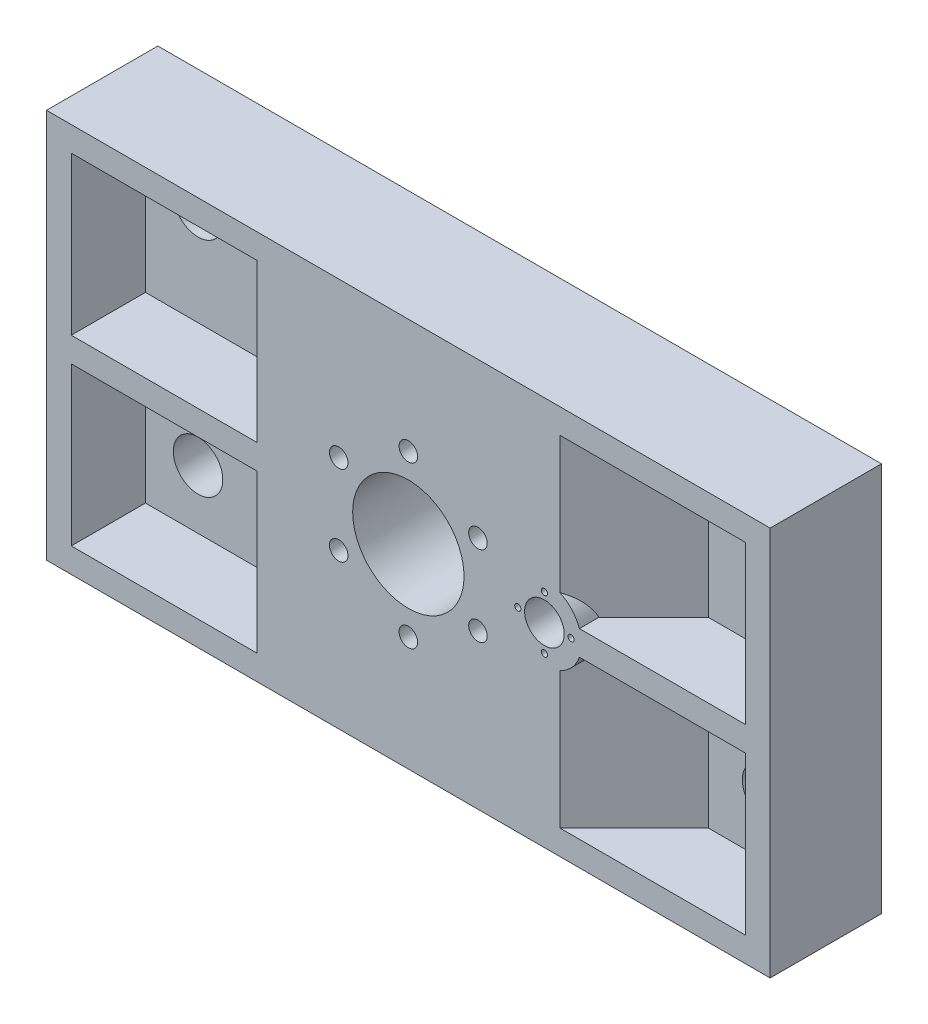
ISO-10303-21;
HEADER;
FILE_DESCRIPTION(('STEP AP214'),'2;1');
FILE_NAME('part.step','',(''),(''),'','','');
FILE_SCHEMA(('AUTOMOTIVE_DESIGN { 1 0 10303 214 1 1 1 1 }'));
ENDSEC;
DATA;
#1=APPLICATION_CONTEXT('core data for automotive mechanical design processes');
#2=APPLICATION_PROTOCOL_DEFINITION('international standard','automotive_design',2000,#1);
#3=PRODUCT_CONTEXT('',#1,'mechanical');
#4=PRODUCT('Part','Part','',(#3));
#5=PRODUCT_RELATED_PRODUCT_CATEGORY('part','',(#4));
#6=PRODUCT_DEFINITION_FORMATION('','',#4);
#7=PRODUCT_DEFINITION_CONTEXT('part definition',#1,'design');
#8=PRODUCT_DEFINITION('design','',#6,#7);
#9=PRODUCT_DEFINITION_SHAPE('','',#8);
#10=(LENGTH_UNIT() NAMED_UNIT(*) SI_UNIT(.MILLI.,.METRE.));
#11=(NAMED_UNIT(*) PLANE_ANGLE_UNIT() SI_UNIT($,.RADIAN.));
#12=(NAMED_UNIT(*) SI_UNIT($,.STERADIAN.) SOLID_ANGLE_UNIT());
#13=UNCERTAINTY_MEASURE_WITH_UNIT(LENGTH_MEASURE(1.E-05),#10,'distance_accuracy_value','');
#14=(GEOMETRIC_REPRESENTATION_CONTEXT(3) GLOBAL_UNCERTAINTY_ASSIGNED_CONTEXT((#13)) GLOBAL_UNIT_ASSIGNED_CONTEXT((#10,
#11,#12)) REPRESENTATION_CONTEXT('',''));
#15=CARTESIAN_POINT('',(0.,0.,0.));
#16=DIRECTION('',(0.,0.,1.));
#17=DIRECTION('',(1.,0.,0.));
#18=AXIS2_PLACEMENT_3D('',#15,#16,#17);
#19=CARTESIAN_POINT('',(0.,-65.,90.));
#20=DIRECTION('',(0.,0.,-1.));
#21=DIRECTION('',(-1.,0.,0.));
#22=AXIS2_PLACEMENT_3D('',#19,#20,#21);
#23=CYLINDRICAL_SURFACE('',#22,7.5);
#24=CARTESIAN_POINT('',(0.,-65.,90.));
#25=DIRECTION('',(0.,0.,1.));
#26=DIRECTION('',(1.,0.,0.));
#27=AXIS2_PLACEMENT_3D('',#24,#25,#26);
#28=CIRCLE('',#27,7.5);
#29=CARTESIAN_POINT('',(-7.49999999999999,-65.,90.));
#30=VERTEX_POINT('',#29);
#31=EDGE_CURVE('E709',#30,#30,#28,.T.);
#32=CARTESIAN_POINT('',(0.,-65.,40.));
#33=DIRECTION('',(0.,0.,-1.));
#34=DIRECTION('',(-1.,0.,0.));
#35=AXIS2_PLACEMENT_3D('',#32,#33,#34);
#36=CIRCLE('',#35,7.5);
#37=CARTESIAN_POINT('',(-7.49999999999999,-65.,40.));
#38=VERTEX_POINT('',#37);
#39=EDGE_CURVE('E40',#38,#38,#36,.T.);
#40=CARTESIAN_POINT('',(-7.49999999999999,-65.,90.));
#41=CARTESIAN_POINT('',(-7.49999999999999,-65.,89.4791666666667));
#42=CARTESIAN_POINT('',(-7.49999999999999,-65.,88.9583333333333));
#43=CARTESIAN_POINT('',(-7.49999999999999,-65.,87.9166666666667));
#44=CARTESIAN_POINT('',(-7.49999999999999,-65.,87.3958333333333));
#45=CARTESIAN_POINT('',(-7.49999999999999,-65.,86.3541666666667));
#46=CARTESIAN_POINT('',(-7.49999999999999,-65.,85.8333333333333));
#47=CARTESIAN_POINT('',(-7.49999999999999,-65.,84.7916666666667));
#48=CARTESIAN_POINT('',(-7.49999999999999,-65.,84.2708333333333));
#49=CARTESIAN_POINT('',(-7.49999999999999,-65.,83.2291666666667));
#50=CARTESIAN_POINT('',(-7.49999999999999,-65.,82.7083333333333));
#51=CARTESIAN_POINT('',(-7.49999999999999,-65.,81.6666666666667));
#52=CARTESIAN_POINT('',(-7.49999999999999,-65.,81.1458333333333));
#53=CARTESIAN_POINT('',(-7.49999999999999,-65.,80.1041666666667));
#54=CARTESIAN_POINT('',(-7.49999999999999,-65.,79.5833333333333));
#55=CARTESIAN_POINT('',(-7.49999999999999,-65.,78.5416666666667));
#56=CARTESIAN_POINT('',(-7.49999999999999,-65.,78.0208333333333));
#57=CARTESIAN_POINT('',(-7.49999999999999,-65.,76.9791666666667));
#58=CARTESIAN_POINT('',(-7.49999999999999,-65.,76.4583333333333));
#59=CARTESIAN_POINT('',(-7.49999999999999,-65.,75.4166666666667));
#60=CARTESIAN_POINT('',(-7.49999999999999,-65.,74.8958333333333));
#61=CARTESIAN_POINT('',(-7.49999999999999,-65.,73.8541666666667));
#62=CARTESIAN_POINT('',(-7.49999999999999,-65.,73.3333333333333));
#63=CARTESIAN_POINT('',(-7.49999999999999,-65.,72.2916666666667));
#64=CARTESIAN_POINT('',(-7.49999999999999,-65.,71.7708333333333));
#65=CARTESIAN_POINT('',(-7.49999999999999,-65.,70.7291666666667));
#66=CARTESIAN_POINT('',(-7.49999999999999,-65.,70.2083333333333));
#67=CARTESIAN_POINT('',(-7.49999999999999,-65.,69.1666666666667));
#68=CARTESIAN_POINT('',(-7.49999999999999,-65.,68.6458333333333));
#69=CARTESIAN_POINT('',(-7.49999999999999,-65.,67.6041666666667));
#70=CARTESIAN_POINT('',(-7.49999999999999,-65.,67.0833333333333));
#71=CARTESIAN_POINT('',(-7.49999999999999,-65.,66.0416666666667));
#72=CARTESIAN_POINT('',(-7.49999999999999,-65.,65.5208333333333));
#73=CARTESIAN_POINT('',(-7.49999999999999,-65.,64.4791666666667));
#74=CARTESIAN_POINT('',(-7.49999999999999,-65.,63.9583333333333));
#75=CARTESIAN_POINT('',(-7.49999999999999,-65.,62.9166666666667));
#76=CARTESIAN_POINT('',(-7.49999999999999,-65.,62.3958333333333));
#77=CARTESIAN_POINT('',(-7.49999999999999,-65.,61.3541666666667));
#78=CARTESIAN_POINT('',(-7.49999999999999,-65.,60.8333333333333));
#79=CARTESIAN_POINT('',(-7.49999999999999,-65.,59.7916666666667));
#80=CARTESIAN_POINT('',(-7.49999999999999,-65.,59.2708333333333));
#81=CARTESIAN_POINT('',(-7.49999999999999,-65.,58.2291666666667));
#82=CARTESIAN_POINT('',(-7.49999999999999,-65.,57.7083333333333));
#83=CARTESIAN_POINT('',(-7.49999999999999,-65.,56.6666666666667));
#84=CARTESIAN_POINT('',(-7.49999999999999,-65.,56.1458333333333));
#85=CARTESIAN_POINT('',(-7.49999999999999,-65.,55.1041666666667));
#86=CARTESIAN_POINT('',(-7.49999999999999,-65.,54.5833333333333));
#87=CARTESIAN_POINT('',(-7.49999999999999,-65.,53.5416666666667));
#88=CARTESIAN_POINT('',(-7.49999999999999,-65.,53.0208333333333));
#89=CARTESIAN_POINT('',(-7.49999999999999,-65.,51.9791666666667));
#90=CARTESIAN_POINT('',(-7.49999999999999,-65.,51.4583333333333));
#91=CARTESIAN_POINT('',(-7.49999999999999,-65.,50.4166666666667));
#92=CARTESIAN_POINT('',(-7.49999999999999,-65.,49.8958333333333));
#93=CARTESIAN_POINT('',(-7.49999999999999,-65.,48.8541666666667));
#94=CARTESIAN_POINT('',(-7.49999999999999,-65.,48.3333333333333));
#95=CARTESIAN_POINT('',(-7.49999999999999,-65.,47.2916666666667));
#96=CARTESIAN_POINT('',(-7.49999999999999,-65.,46.7708333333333));
#97=CARTESIAN_POINT('',(-7.49999999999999,-65.,45.7291666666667));
#98=CARTESIAN_POINT('',(-7.49999999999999,-65.,45.2083333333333));
#99=CARTESIAN_POINT('',(-7.49999999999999,-65.,44.1666666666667));
#100=CARTESIAN_POINT('',(-7.49999999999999,-65.,43.6458333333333));
#101=CARTESIAN_POINT('',(-7.49999999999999,-65.,42.6041666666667));
#102=CARTESIAN_POINT('',(-7.49999999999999,-65.,42.0833333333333));
#103=CARTESIAN_POINT('',(-7.49999999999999,-65.,41.0416666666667));
#104=CARTESIAN_POINT('',(-7.49999999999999,-65.,40.5208333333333));
#105=CARTESIAN_POINT('',(-7.49999999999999,-65.,40.));
#106=B_SPLINE_CURVE_WITH_KNOTS('',3,(#40,#41,#42,#43,#44,#45,#46,#47,#48,#49,#50,#51,#52,#53,
#54,#55,#56,#57,#58,#59,#60,#61,#62,#63,#64,#65,#66,#67,#68,#69,#70,#71,#72,#73,#74,#75,#76,#77,
#78,#79,#80,#81,#82,#83,#84,#85,#86,#87,#88,#89,#90,#91,#92,#93,#94,#95,#96,#97,#98,#99,#100,
#101,#102,#103,#104,#105),.UNSPECIFIED.,.F.,.F.,(4,2,2,2,2,2,2,2,2,2,2,2,2,2,2,2,2,2,2,2,2,2,2,
2,2,2,2,2,2,2,2,2,4),(0.,1.56249999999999,3.12499999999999,4.6875,6.24999999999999,
7.81249999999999,9.37499999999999,10.9375,12.5,14.0625,15.625,17.1875,18.75,20.3125,21.875,
23.4375,25.,26.5625,28.125,29.6875,31.25,32.8125,34.375,35.9375,37.5,39.0625,40.625,42.1875,
43.75,45.3125,46.875,48.4375,50.),.UNSPECIFIED.);
#107=EDGE_CURVE('BSEAM36',#30,#38,#106,.T.);
#108=ORIENTED_EDGE('',*,*,#31,.T.);
#109=ORIENTED_EDGE('',*,*,#39,.T.);
#110=ORIENTED_EDGE('',*,*,#107,.T.);
#111=ORIENTED_EDGE('',*,*,#107,.F.);
#112=EDGE_LOOP('',(#108,#110,#109,#111));
#113=FACE_BOUND('',#112,.T.);
#114=ADVANCED_FACE('F36',(#113),#23,.F.);
#115=CARTESIAN_POINT('',(-56.2916512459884,32.5000000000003,90.));
#116=DIRECTION('',(0.,0.,-1.));
#117=DIRECTION('',(-1.,0.,0.));
#118=AXIS2_PLACEMENT_3D('',#115,#116,#117);
#119=CYLINDRICAL_SURFACE('',#118,7.5);
#120=CARTESIAN_POINT('',(-56.2916512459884,32.5000000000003,90.));
#121=DIRECTION('',(0.,0.,1.));
#122=DIRECTION('',(1.,0.,0.));
#123=AXIS2_PLACEMENT_3D('',#120,#121,#122);
#124=CIRCLE('',#123,7.5);
#125=CARTESIAN_POINT('',(-63.7916512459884,32.5000000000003,90.));
#126=VERTEX_POINT('',#125);
#127=EDGE_CURVE('E703',#126,#126,#124,.T.);
#128=CARTESIAN_POINT('',(-56.2916512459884,32.5000000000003,40.));
#129=DIRECTION('',(0.,0.,-1.));
#130=DIRECTION('',(-1.,0.,0.));
#131=AXIS2_PLACEMENT_3D('',#128,#129,#130);
#132=CIRCLE('',#131,7.5);
#133=CARTESIAN_POINT('',(-63.7916512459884,32.5000000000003,40.));
#134=VERTEX_POINT('',#133);
#135=EDGE_CURVE('E766',#134,#134,#132,.T.);
#136=CARTESIAN_POINT('',(-63.7916512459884,32.5000000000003,90.));
#137=CARTESIAN_POINT('',(-63.7916512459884,32.5000000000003,89.4791666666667));
#138=CARTESIAN_POINT('',(-63.7916512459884,32.5000000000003,88.9583333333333));
#139=CARTESIAN_POINT('',(-63.7916512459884,32.5000000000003,87.9166666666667));
#140=CARTESIAN_POINT('',(-63.7916512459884,32.5000000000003,87.3958333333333));
#141=CARTESIAN_POINT('',(-63.7916512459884,32.5000000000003,86.3541666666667));
#142=CARTESIAN_POINT('',(-63.7916512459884,32.5000000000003,85.8333333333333));
#143=CARTESIAN_POINT('',(-63.7916512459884,32.5000000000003,84.7916666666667));
#144=CARTESIAN_POINT('',(-63.7916512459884,32.5000000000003,84.2708333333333));
#145=CARTESIAN_POINT('',(-63.7916512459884,32.5000000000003,83.2291666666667));
#146=CARTESIAN_POINT('',(-63.7916512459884,32.5000000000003,82.7083333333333));
#147=CARTESIAN_POINT('',(-63.7916512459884,32.5000000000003,81.6666666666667));
#148=CARTESIAN_POINT('',(-63.7916512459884,32.5000000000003,81.1458333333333));
#149=CARTESIAN_POINT('',(-63.7916512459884,32.5000000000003,80.1041666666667));
#150=CARTESIAN_POINT('',(-63.7916512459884,32.5000000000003,79.5833333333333));
#151=CARTESIAN_POINT('',(-63.7916512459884,32.5000000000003,78.5416666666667));
#152=CARTESIAN_POINT('',(-63.7916512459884,32.5000000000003,78.0208333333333));
#153=CARTESIAN_POINT('',(-63.7916512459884,32.5000000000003,76.9791666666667));
#154=CARTESIAN_POINT('',(-63.7916512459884,32.5000000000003,76.4583333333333));
#155=CARTESIAN_POINT('',(-63.7916512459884,32.5000000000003,75.4166666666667));
#156=CARTESIAN_POINT('',(-63.7916512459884,32.5000000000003,74.8958333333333));
#157=CARTESIAN_POINT('',(-63.7916512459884,32.5000000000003,73.8541666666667));
#158=CARTESIAN_POINT('',(-63.7916512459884,32.5000000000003,73.3333333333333));
#159=CARTESIAN_POINT('',(-63.7916512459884,32.5000000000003,72.2916666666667));
#160=CARTESIAN_POINT('',(-63.7916512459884,32.5000000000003,71.7708333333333));
#161=CARTESIAN_POINT('',(-63.7916512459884,32.5000000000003,70.7291666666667));
#162=CARTESIAN_POINT('',(-63.7916512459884,32.5000000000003,70.2083333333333));
#163=CARTESIAN_POINT('',(-63.7916512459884,32.5000000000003,69.1666666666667));
#164=CARTESIAN_POINT('',(-63.7916512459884,32.5000000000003,68.6458333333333));
#165=CARTESIAN_POINT('',(-63.7916512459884,32.5000000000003,67.6041666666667));
#166=CARTESIAN_POINT('',(-63.7916512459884,32.5000000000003,67.0833333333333));
#167=CARTESIAN_POINT('',(-63.7916512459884,32.5000000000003,66.0416666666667));
#168=CARTESIAN_POINT('',(-63.7916512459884,32.5000000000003,65.5208333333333));
#169=CARTESIAN_POINT('',(-63.7916512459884,32.5000000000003,64.4791666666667));
#170=CARTESIAN_POINT('',(-63.7916512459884,32.5000000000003,63.9583333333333));
#171=CARTESIAN_POINT('',(-63.7916512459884,32.5000000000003,62.9166666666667));
#172=CARTESIAN_POINT('',(-63.7916512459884,32.5000000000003,62.3958333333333));
#173=CARTESIAN_POINT('',(-63.7916512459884,32.5000000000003,61.3541666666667));
#174=CARTESIAN_POINT('',(-63.7916512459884,32.5000000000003,60.8333333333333));
#175=CARTESIAN_POINT('',(-63.7916512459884,32.5000000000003,59.7916666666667));
#176=CARTESIAN_POINT('',(-63.7916512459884,32.5000000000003,59.2708333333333));
#177=CARTESIAN_POINT('',(-63.7916512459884,32.5000000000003,58.2291666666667));
#178=CARTESIAN_POINT('',(-63.7916512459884,32.5000000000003,57.7083333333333));
#179=CARTESIAN_POINT('',(-63.7916512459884,32.5000000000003,56.6666666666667));
#180=CARTESIAN_POINT('',(-63.7916512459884,32.5000000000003,56.1458333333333));
#181=CARTESIAN_POINT('',(-63.7916512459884,32.5000000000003,55.1041666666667));
#182=CARTESIAN_POINT('',(-63.7916512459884,32.5000000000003,54.5833333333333));
#183=CARTESIAN_POINT('',(-63.7916512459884,32.5000000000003,53.5416666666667));
#184=CARTESIAN_POINT('',(-63.7916512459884,32.5000000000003,53.0208333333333));
#185=CARTESIAN_POINT('',(-63.7916512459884,32.5000000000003,51.9791666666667));
#186=CARTESIAN_POINT('',(-63.7916512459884,32.5000000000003,51.4583333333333));
#187=CARTESIAN_POINT('',(-63.7916512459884,32.5000000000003,50.4166666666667));
#188=CARTESIAN_POINT('',(-63.7916512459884,32.5000000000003,49.8958333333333));
#189=CARTESIAN_POINT('',(-63.7916512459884,32.5000000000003,48.8541666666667));
#190=CARTESIAN_POINT('',(-63.7916512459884,32.5000000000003,48.3333333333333));
#191=CARTESIAN_POINT('',(-63.7916512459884,32.5000000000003,47.2916666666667));
#192=CARTESIAN_POINT('',(-63.7916512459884,32.5000000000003,46.7708333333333));
#193=CARTESIAN_POINT('',(-63.7916512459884,32.5000000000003,45.7291666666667));
#194=CARTESIAN_POINT('',(-63.7916512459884,32.5000000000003,45.2083333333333));
#195=CARTESIAN_POINT('',(-63.7916512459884,32.5000000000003,44.1666666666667));
#196=CARTESIAN_POINT('',(-63.7916512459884,32.5000000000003,43.6458333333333));
#197=CARTESIAN_POINT('',(-63.7916512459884,32.5000000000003,42.6041666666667));
#198=CARTESIAN_POINT('',(-63.7916512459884,32.5000000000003,42.0833333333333));
#199=CARTESIAN_POINT('',(-63.7916512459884,32.5000000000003,41.0416666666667));
#200=CARTESIAN_POINT('',(-63.7916512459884,32.5000000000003,40.5208333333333));
#201=CARTESIAN_POINT('',(-63.7916512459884,32.5000000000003,40.));
#202=B_SPLINE_CURVE_WITH_KNOTS('',3,(#136,#137,#138,#139,#140,#141,#142,#143,#144,#145,#146,
#147,#148,#149,#150,#151,#152,#153,#154,#155,#156,#157,#158,#159,#160,#161,#162,#163,#164,#165,
#166,#167,#168,#169,#170,#171,#172,#173,#174,#175,#176,#177,#178,#179,#180,#181,#182,#183,#184,
#185,#186,#187,#188,#189,#190,#191,#192,#193,#194,#195,#196,#197,#198,#199,#200,#201),
.UNSPECIFIED.,.F.,.F.,(4,2,2,2,2,2,2,2,2,2,2,2,2,2,2,2,2,2,2,2,2,2,2,2,2,2,2,2,2,2,2,2,4),(0.,
1.56249999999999,3.12499999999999,4.6875,6.24999999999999,7.81249999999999,9.37499999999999,
10.9375,12.5,14.0625,15.625,17.1875,18.75,20.3125,21.875,23.4375,25.,26.5625,28.125,29.6875,
31.25,32.8125,34.375,35.9375,37.5,39.0625,40.625,42.1875,43.75,45.3125,46.875,48.4375,50.),.UNSPECIFIED.);
#203=EDGE_CURVE('BSEAM881',#126,#134,#202,.T.);
#204=ORIENTED_EDGE('',*,*,#127,.T.);
#205=ORIENTED_EDGE('',*,*,#135,.T.);
#206=ORIENTED_EDGE('',*,*,#203,.T.);
#207=ORIENTED_EDGE('',*,*,#203,.F.);
#208=EDGE_LOOP('',(#204,#206,#205,#207));
#209=FACE_BOUND('',#208,.T.);
#210=ADVANCED_FACE('F881',(#209),#119,.F.);
#211=CARTESIAN_POINT('',(4.4593236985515E-13,65.,90.));
#212=DIRECTION('',(0.,0.,-1.));
#213=DIRECTION('',(-1.,0.,0.));
#214=AXIS2_PLACEMENT_3D('',#211,#212,#213);
#215=CYLINDRICAL_SURFACE('',#214,7.5);
#216=CARTESIAN_POINT('',(4.4593236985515E-13,65.,90.));
#217=DIRECTION('',(0.,0.,1.));
#218=DIRECTION('',(1.,0.,0.));
#219=AXIS2_PLACEMENT_3D('',#216,#217,#218);
#220=CIRCLE('',#219,7.5);
#221=CARTESIAN_POINT('',(-7.49999999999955,65.,90.));
#222=VERTEX_POINT('',#221);
#223=EDGE_CURVE('E700',#222,#222,#220,.T.);
#224=CARTESIAN_POINT('',(4.4593236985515E-13,65.,40.));
#225=DIRECTION('',(0.,0.,-1.));
#226=DIRECTION('',(-1.,0.,0.));
#227=AXIS2_PLACEMENT_3D('',#224,#225,#226);
#228=CIRCLE('',#227,7.5);
#229=CARTESIAN_POINT('',(-7.49999999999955,65.,40.));
#230=VERTEX_POINT('',#229);
#231=EDGE_CURVE('E764',#230,#230,#228,.T.);
#232=CARTESIAN_POINT('',(-7.49999999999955,65.,90.));
#233=CARTESIAN_POINT('',(-7.49999999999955,65.,89.4791666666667));
#234=CARTESIAN_POINT('',(-7.49999999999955,65.,88.9583333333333));
#235=CARTESIAN_POINT('',(-7.49999999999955,65.,87.9166666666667));
#236=CARTESIAN_POINT('',(-7.49999999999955,65.,87.3958333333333));
#237=CARTESIAN_POINT('',(-7.49999999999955,65.,86.3541666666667));
#238=CARTESIAN_POINT('',(-7.49999999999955,65.,85.8333333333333));
#239=CARTESIAN_POINT('',(-7.49999999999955,65.,84.7916666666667));
#240=CARTESIAN_POINT('',(-7.49999999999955,65.,84.2708333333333));
#241=CARTESIAN_POINT('',(-7.49999999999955,65.,83.2291666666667));
#242=CARTESIAN_POINT('',(-7.49999999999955,65.,82.7083333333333));
#243=CARTESIAN_POINT('',(-7.49999999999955,65.,81.6666666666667));
#244=CARTESIAN_POINT('',(-7.49999999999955,65.,81.1458333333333));
#245=CARTESIAN_POINT('',(-7.49999999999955,65.,80.1041666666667));
#246=CARTESIAN_POINT('',(-7.49999999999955,65.,79.5833333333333));
#247=CARTESIAN_POINT('',(-7.49999999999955,65.,78.5416666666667));
#248=CARTESIAN_POINT('',(-7.49999999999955,65.,78.0208333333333));
#249=CARTESIAN_POINT('',(-7.49999999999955,65.,76.9791666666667));
#250=CARTESIAN_POINT('',(-7.49999999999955,65.,76.4583333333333));
#251=CARTESIAN_POINT('',(-7.49999999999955,65.,75.4166666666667));
#252=CARTESIAN_POINT('',(-7.49999999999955,65.,74.8958333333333));
#253=CARTESIAN_POINT('',(-7.49999999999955,65.,73.8541666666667));
#254=CARTESIAN_POINT('',(-7.49999999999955,65.,73.3333333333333));
#255=CARTESIAN_POINT('',(-7.49999999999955,65.,72.2916666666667));
#256=CARTESIAN_POINT('',(-7.49999999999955,65.,71.7708333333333));
#257=CARTESIAN_POINT('',(-7.49999999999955,65.,70.7291666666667));
#258=CARTESIAN_POINT('',(-7.49999999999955,65.,70.2083333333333));
#259=CARTESIAN_POINT('',(-7.49999999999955,65.,69.1666666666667));
#260=CARTESIAN_POINT('',(-7.49999999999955,65.,68.6458333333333));
#261=CARTESIAN_POINT('',(-7.49999999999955,65.,67.6041666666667));
#262=CARTESIAN_POINT('',(-7.49999999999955,65.,67.0833333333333));
#263=CARTESIAN_POINT('',(-7.49999999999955,65.,66.0416666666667));
#264=CARTESIAN_POINT('',(-7.49999999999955,65.,65.5208333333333));
#265=CARTESIAN_POINT('',(-7.49999999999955,65.,64.4791666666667));
#266=CARTESIAN_POINT('',(-7.49999999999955,65.,63.9583333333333));
#267=CARTESIAN_POINT('',(-7.49999999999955,65.,62.9166666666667));
#268=CARTESIAN_POINT('',(-7.49999999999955,65.,62.3958333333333));
#269=CARTESIAN_POINT('',(-7.49999999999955,65.,61.3541666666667));
#270=CARTESIAN_POINT('',(-7.49999999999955,65.,60.8333333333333));
#271=CARTESIAN_POINT('',(-7.49999999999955,65.,59.7916666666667));
#272=CARTESIAN_POINT('',(-7.49999999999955,65.,59.2708333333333));
#273=CARTESIAN_POINT('',(-7.49999999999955,65.,58.2291666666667));
#274=CARTESIAN_POINT('',(-7.49999999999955,65.,57.7083333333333));
#275=CARTESIAN_POINT('',(-7.49999999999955,65.,56.6666666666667));
#276=CARTESIAN_POINT('',(-7.49999999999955,65.,56.1458333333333));
#277=CARTESIAN_POINT('',(-7.49999999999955,65.,55.1041666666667));
#278=CARTESIAN_POINT('',(-7.49999999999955,65.,54.5833333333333));
#279=CARTESIAN_POINT('',(-7.49999999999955,65.,53.5416666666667));
#280=CARTESIAN_POINT('',(-7.49999999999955,65.,53.0208333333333));
#281=CARTESIAN_POINT('',(-7.49999999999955,65.,51.9791666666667));
#282=CARTESIAN_POINT('',(-7.49999999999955,65.,51.4583333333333));
#283=CARTESIAN_POINT('',(-7.49999999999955,65.,50.4166666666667));
#284=CARTESIAN_POINT('',(-7.49999999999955,65.,49.8958333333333));
#285=CARTESIAN_POINT('',(-7.49999999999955,65.,48.8541666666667));
#286=CARTESIAN_POINT('',(-7.49999999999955,65.,48.3333333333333));
#287=CARTESIAN_POINT('',(-7.49999999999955,65.,47.2916666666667));
#288=CARTESIAN_POINT('',(-7.49999999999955,65.,46.7708333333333));
#289=CARTESIAN_POINT('',(-7.49999999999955,65.,45.7291666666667));
#290=CARTESIAN_POINT('',(-7.49999999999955,65.,45.2083333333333));
#291=CARTESIAN_POINT('',(-7.49999999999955,65.,44.1666666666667));
#292=CARTESIAN_POINT('',(-7.49999999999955,65.,43.6458333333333));
#293=CARTESIAN_POINT('',(-7.49999999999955,65.,42.6041666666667));
#294=CARTESIAN_POINT('',(-7.49999999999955,65.,42.0833333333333));
#295=CARTESIAN_POINT('',(-7.49999999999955,65.,41.0416666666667));
#296=CARTESIAN_POINT('',(-7.49999999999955,65.,40.5208333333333));
#297=CARTESIAN_POINT('',(-7.49999999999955,65.,40.));
#298=B_SPLINE_CURVE_WITH_KNOTS('',3,(#232,#233,#234,#235,#236,#237,#238,#239,#240,#241,#242,
#243,#244,#245,#246,#247,#248,#249,#250,#251,#252,#253,#254,#255,#256,#257,#258,#259,#260,#261,
#262,#263,#264,#265,#266,#267,#268,#269,#270,#271,#272,#273,#274,#275,#276,#277,#278,#279,#280,
#281,#282,#283,#284,#285,#286,#287,#288,#289,#290,#291,#292,#293,#294,#295,#296,#297),
.UNSPECIFIED.,.F.,.F.,(4,2,2,2,2,2,2,2,2,2,2,2,2,2,2,2,2,2,2,2,2,2,2,2,2,2,2,2,2,2,2,2,4),(0.,
1.56249999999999,3.12499999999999,4.6875,6.24999999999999,7.81249999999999,9.37499999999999,
10.9375,12.5,14.0625,15.625,17.1875,18.75,20.3125,21.875,23.4375,25.,26.5625,28.125,29.6875,
31.25,32.8125,34.375,35.9375,37.5,39.0625,40.625,42.1875,43.75,45.3125,46.875,48.4375,50.),.UNSPECIFIED.);
#299=EDGE_CURVE('BSEAM887',#222,#230,#298,.T.);
#300=ORIENTED_EDGE('',*,*,#223,.T.);
#301=ORIENTED_EDGE('',*,*,#231,.T.);
#302=ORIENTED_EDGE('',*,*,#299,.T.);
#303=ORIENTED_EDGE('',*,*,#299,.F.);
#304=EDGE_LOOP('',(#300,#302,#301,#303));
#305=FACE_BOUND('',#304,.T.);
#306=ADVANCED_FACE('F887',(#305),#215,.F.);
#307=CARTESIAN_POINT('',(56.2916512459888,32.4999999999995,90.));
#308=DIRECTION('',(0.,0.,-1.));
#309=DIRECTION('',(-1.,0.,0.));
#310=AXIS2_PLACEMENT_3D('',#307,#308,#309);
#311=CYLINDRICAL_SURFACE('',#310,7.49999999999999);
#312=CARTESIAN_POINT('',(56.2916512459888,32.4999999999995,90.));
#313=DIRECTION('',(0.,0.,1.));
#314=DIRECTION('',(1.,0.,0.));
#315=AXIS2_PLACEMENT_3D('',#312,#313,#314);
#316=CIRCLE('',#315,7.49999999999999);
#317=CARTESIAN_POINT('',(48.7916512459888,32.4999999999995,90.));
#318=VERTEX_POINT('',#317);
#319=EDGE_CURVE('E697',#318,#318,#316,.T.);
#320=CARTESIAN_POINT('',(56.2916512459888,32.4999999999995,40.));
#321=DIRECTION('',(0.,0.,-1.));
#322=DIRECTION('',(-1.,0.,0.));
#323=AXIS2_PLACEMENT_3D('',#320,#321,#322);
#324=CIRCLE('',#323,7.49999999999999);
#325=CARTESIAN_POINT('',(48.7916512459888,32.4999999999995,40.));
#326=VERTEX_POINT('',#325);
#327=EDGE_CURVE('E760',#326,#326,#324,.T.);
#328=CARTESIAN_POINT('',(48.7916512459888,32.4999999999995,90.));
#329=CARTESIAN_POINT('',(48.7916512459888,32.4999999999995,89.4791666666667));
#330=CARTESIAN_POINT('',(48.7916512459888,32.4999999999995,88.9583333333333));
#331=CARTESIAN_POINT('',(48.7916512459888,32.4999999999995,87.9166666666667));
#332=CARTESIAN_POINT('',(48.7916512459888,32.4999999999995,87.3958333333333));
#333=CARTESIAN_POINT('',(48.7916512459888,32.4999999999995,86.3541666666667));
#334=CARTESIAN_POINT('',(48.7916512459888,32.4999999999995,85.8333333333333));
#335=CARTESIAN_POINT('',(48.7916512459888,32.4999999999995,84.7916666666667));
#336=CARTESIAN_POINT('',(48.7916512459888,32.4999999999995,84.2708333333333));
#337=CARTESIAN_POINT('',(48.7916512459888,32.4999999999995,83.2291666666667));
#338=CARTESIAN_POINT('',(48.7916512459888,32.4999999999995,82.7083333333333));
#339=CARTESIAN_POINT('',(48.7916512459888,32.4999999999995,81.6666666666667));
#340=CARTESIAN_POINT('',(48.7916512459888,32.4999999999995,81.1458333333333));
#341=CARTESIAN_POINT('',(48.7916512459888,32.4999999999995,80.1041666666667));
#342=CARTESIAN_POINT('',(48.7916512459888,32.4999999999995,79.5833333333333));
#343=CARTESIAN_POINT('',(48.7916512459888,32.4999999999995,78.5416666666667));
#344=CARTESIAN_POINT('',(48.7916512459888,32.4999999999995,78.0208333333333));
#345=CARTESIAN_POINT('',(48.7916512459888,32.4999999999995,76.9791666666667));
#346=CARTESIAN_POINT('',(48.7916512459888,32.4999999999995,76.4583333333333));
#347=CARTESIAN_POINT('',(48.7916512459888,32.4999999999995,75.4166666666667));
#348=CARTESIAN_POINT('',(48.7916512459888,32.4999999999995,74.8958333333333));
#349=CARTESIAN_POINT('',(48.7916512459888,32.4999999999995,73.8541666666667));
#350=CARTESIAN_POINT('',(48.7916512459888,32.4999999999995,73.3333333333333));
#351=CARTESIAN_POINT('',(48.7916512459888,32.4999999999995,72.2916666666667));
#352=CARTESIAN_POINT('',(48.7916512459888,32.4999999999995,71.7708333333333));
#353=CARTESIAN_POINT('',(48.7916512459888,32.4999999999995,70.7291666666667));
#354=CARTESIAN_POINT('',(48.7916512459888,32.4999999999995,70.2083333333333));
#355=CARTESIAN_POINT('',(48.7916512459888,32.4999999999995,69.1666666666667));
#356=CARTESIAN_POINT('',(48.7916512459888,32.4999999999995,68.6458333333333));
#357=CARTESIAN_POINT('',(48.7916512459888,32.4999999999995,67.6041666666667));
#358=CARTESIAN_POINT('',(48.7916512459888,32.4999999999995,67.0833333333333));
#359=CARTESIAN_POINT('',(48.7916512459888,32.4999999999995,66.0416666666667));
#360=CARTESIAN_POINT('',(48.7916512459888,32.4999999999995,65.5208333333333));
#361=CARTESIAN_POINT('',(48.7916512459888,32.4999999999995,64.4791666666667));
#362=CARTESIAN_POINT('',(48.7916512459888,32.4999999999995,63.9583333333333));
#363=CARTESIAN_POINT('',(48.7916512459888,32.4999999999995,62.9166666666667));
#364=CARTESIAN_POINT('',(48.7916512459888,32.4999999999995,62.3958333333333));
#365=CARTESIAN_POINT('',(48.7916512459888,32.4999999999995,61.3541666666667));
#366=CARTESIAN_POINT('',(48.7916512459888,32.4999999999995,60.8333333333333));
#367=CARTESIAN_POINT('',(48.7916512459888,32.4999999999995,59.7916666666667));
#368=CARTESIAN_POINT('',(48.7916512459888,32.4999999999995,59.2708333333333));
#369=CARTESIAN_POINT('',(48.7916512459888,32.4999999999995,58.2291666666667));
#370=CARTESIAN_POINT('',(48.7916512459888,32.4999999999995,57.7083333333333));
#371=CARTESIAN_POINT('',(48.7916512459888,32.4999999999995,56.6666666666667));
#372=CARTESIAN_POINT('',(48.7916512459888,32.4999999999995,56.1458333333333));
#373=CARTESIAN_POINT('',(48.7916512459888,32.4999999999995,55.1041666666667));
#374=CARTESIAN_POINT('',(48.7916512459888,32.4999999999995,54.5833333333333));
#375=CARTESIAN_POINT('',(48.7916512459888,32.4999999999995,53.5416666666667));
#376=CARTESIAN_POINT('',(48.7916512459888,32.4999999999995,53.0208333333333));
#377=CARTESIAN_POINT('',(48.7916512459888,32.4999999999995,51.9791666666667));
#378=CARTESIAN_POINT('',(48.7916512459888,32.4999999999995,51.4583333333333));
#379=CARTESIAN_POINT('',(48.7916512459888,32.4999999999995,50.4166666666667));
#380=CARTESIAN_POINT('',(48.7916512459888,32.4999999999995,49.8958333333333));
#381=CARTESIAN_POINT('',(48.7916512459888,32.4999999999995,48.8541666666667));
#382=CARTESIAN_POINT('',(48.7916512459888,32.4999999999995,48.3333333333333));
#383=CARTESIAN_POINT('',(48.7916512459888,32.4999999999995,47.2916666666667));
#384=CARTESIAN_POINT('',(48.7916512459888,32.4999999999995,46.7708333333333));
#385=CARTESIAN_POINT('',(48.7916512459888,32.4999999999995,45.7291666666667));
#386=CARTESIAN_POINT('',(48.7916512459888,32.4999999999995,45.2083333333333));
#387=CARTESIAN_POINT('',(48.7916512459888,32.4999999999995,44.1666666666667));
#388=CARTESIAN_POINT('',(48.7916512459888,32.4999999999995,43.6458333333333));
#389=CARTESIAN_POINT('',(48.7916512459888,32.4999999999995,42.6041666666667));
#390=CARTESIAN_POINT('',(48.7916512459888,32.4999999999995,42.0833333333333));
#391=CARTESIAN_POINT('',(48.7916512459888,32.4999999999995,41.0416666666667));
#392=CARTESIAN_POINT('',(48.7916512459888,32.4999999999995,40.5208333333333));
#393=CARTESIAN_POINT('',(48.7916512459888,32.4999999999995,40.));
#394=B_SPLINE_CURVE_WITH_KNOTS('',3,(#328,#329,#330,#331,#332,#333,#334,#335,#336,#337,#338,
#339,#340,#341,#342,#343,#344,#345,#346,#347,#348,#349,#350,#351,#352,#353,#354,#355,#356,#357,
#358,#359,#360,#361,#362,#363,#364,#365,#366,#367,#368,#369,#370,#371,#372,#373,#374,#375,#376,
#377,#378,#379,#380,#381,#382,#383,#384,#385,#386,#387,#388,#389,#390,#391,#392,#393),
.UNSPECIFIED.,.F.,.F.,(4,2,2,2,2,2,2,2,2,2,2,2,2,2,2,2,2,2,2,2,2,2,2,2,2,2,2,2,2,2,2,2,4),(0.,
1.56249999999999,3.12499999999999,4.6875,6.24999999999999,7.81249999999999,9.37499999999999,
10.9375,12.5,14.0625,15.625,17.1875,18.75,20.3125,21.875,23.4375,25.,26.5625,28.125,29.6875,
31.25,32.8125,34.375,35.9375,37.5,39.0625,40.625,42.1875,43.75,45.3125,46.875,48.4375,50.),.UNSPECIFIED.);
#395=EDGE_CURVE('BSEAM1019',#318,#326,#394,.T.);
#396=ORIENTED_EDGE('',*,*,#319,.T.);
#397=ORIENTED_EDGE('',*,*,#327,.T.);
#398=ORIENTED_EDGE('',*,*,#395,.T.);
#399=ORIENTED_EDGE('',*,*,#395,.F.);
#400=EDGE_LOOP('',(#396,#398,#397,#399));
#401=FACE_BOUND('',#400,.T.);
#402=ADVANCED_FACE('F1019',(#401),#311,.F.);
#403=CARTESIAN_POINT('',(56.2916512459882,-32.5000000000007,90.));
#404=DIRECTION('',(0.,0.,-1.));
#405=DIRECTION('',(-1.,0.,0.));
#406=AXIS2_PLACEMENT_3D('',#403,#404,#405);
#407=CYLINDRICAL_SURFACE('',#406,7.5);
#408=CARTESIAN_POINT('',(56.2916512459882,-32.5000000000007,90.));
#409=DIRECTION('',(0.,0.,1.));
#410=DIRECTION('',(1.,0.,0.));
#411=AXIS2_PLACEMENT_3D('',#408,#409,#410);
#412=CIRCLE('',#411,7.5);
#413=CARTESIAN_POINT('',(48.7916512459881,-32.5000000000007,90.));
#414=VERTEX_POINT('',#413);
#415=EDGE_CURVE('E694',#414,#414,#412,.T.);
#416=CARTESIAN_POINT('',(56.2916512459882,-32.5000000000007,40.));
#417=DIRECTION('',(0.,0.,-1.));
#418=DIRECTION('',(-1.,0.,0.));
#419=AXIS2_PLACEMENT_3D('',#416,#417,#418);
#420=CIRCLE('',#419,7.5);
#421=CARTESIAN_POINT('',(48.7916512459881,-32.5000000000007,40.));
#422=VERTEX_POINT('',#421);
#423=EDGE_CURVE('E757',#422,#422,#420,.T.);
#424=CARTESIAN_POINT('',(48.7916512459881,-32.5000000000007,90.));
#425=CARTESIAN_POINT('',(48.7916512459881,-32.5000000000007,89.4791666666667));
#426=CARTESIAN_POINT('',(48.7916512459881,-32.5000000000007,88.9583333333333));
#427=CARTESIAN_POINT('',(48.7916512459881,-32.5000000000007,87.9166666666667));
#428=CARTESIAN_POINT('',(48.7916512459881,-32.5000000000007,87.3958333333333));
#429=CARTESIAN_POINT('',(48.7916512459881,-32.5000000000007,86.3541666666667));
#430=CARTESIAN_POINT('',(48.7916512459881,-32.5000000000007,85.8333333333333));
#431=CARTESIAN_POINT('',(48.7916512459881,-32.5000000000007,84.7916666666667));
#432=CARTESIAN_POINT('',(48.7916512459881,-32.5000000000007,84.2708333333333));
#433=CARTESIAN_POINT('',(48.7916512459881,-32.5000000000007,83.2291666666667));
#434=CARTESIAN_POINT('',(48.7916512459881,-32.5000000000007,82.7083333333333));
#435=CARTESIAN_POINT('',(48.7916512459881,-32.5000000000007,81.6666666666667));
#436=CARTESIAN_POINT('',(48.7916512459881,-32.5000000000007,81.1458333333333));
#437=CARTESIAN_POINT('',(48.7916512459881,-32.5000000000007,80.1041666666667));
#438=CARTESIAN_POINT('',(48.7916512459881,-32.5000000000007,79.5833333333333));
#439=CARTESIAN_POINT('',(48.7916512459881,-32.5000000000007,78.5416666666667));
#440=CARTESIAN_POINT('',(48.7916512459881,-32.5000000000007,78.0208333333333));
#441=CARTESIAN_POINT('',(48.7916512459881,-32.5000000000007,76.9791666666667));
#442=CARTESIAN_POINT('',(48.7916512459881,-32.5000000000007,76.4583333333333));
#443=CARTESIAN_POINT('',(48.7916512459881,-32.5000000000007,75.4166666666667));
#444=CARTESIAN_POINT('',(48.7916512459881,-32.5000000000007,74.8958333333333));
#445=CARTESIAN_POINT('',(48.7916512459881,-32.5000000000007,73.8541666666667));
#446=CARTESIAN_POINT('',(48.7916512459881,-32.5000000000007,73.3333333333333));
#447=CARTESIAN_POINT('',(48.7916512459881,-32.5000000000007,72.2916666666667));
#448=CARTESIAN_POINT('',(48.7916512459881,-32.5000000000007,71.7708333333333));
#449=CARTESIAN_POINT('',(48.7916512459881,-32.5000000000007,70.7291666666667));
#450=CARTESIAN_POINT('',(48.7916512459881,-32.5000000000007,70.2083333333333));
#451=CARTESIAN_POINT('',(48.7916512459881,-32.5000000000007,69.1666666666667));
#452=CARTESIAN_POINT('',(48.7916512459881,-32.5000000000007,68.6458333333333));
#453=CARTESIAN_POINT('',(48.7916512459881,-32.5000000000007,67.6041666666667));
#454=CARTESIAN_POINT('',(48.7916512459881,-32.5000000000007,67.0833333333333));
#455=CARTESIAN_POINT('',(48.7916512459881,-32.5000000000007,66.0416666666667));
#456=CARTESIAN_POINT('',(48.7916512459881,-32.5000000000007,65.5208333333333));
#457=CARTESIAN_POINT('',(48.7916512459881,-32.5000000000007,64.4791666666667));
#458=CARTESIAN_POINT('',(48.7916512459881,-32.5000000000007,63.9583333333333));
#459=CARTESIAN_POINT('',(48.7916512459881,-32.5000000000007,62.9166666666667));
#460=CARTESIAN_POINT('',(48.7916512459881,-32.5000000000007,62.3958333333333));
#461=CARTESIAN_POINT('',(48.7916512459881,-32.5000000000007,61.3541666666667));
#462=CARTESIAN_POINT('',(48.7916512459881,-32.5000000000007,60.8333333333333));
#463=CARTESIAN_POINT('',(48.7916512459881,-32.5000000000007,59.7916666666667));
#464=CARTESIAN_POINT('',(48.7916512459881,-32.5000000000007,59.2708333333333));
#465=CARTESIAN_POINT('',(48.7916512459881,-32.5000000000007,58.2291666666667));
#466=CARTESIAN_POINT('',(48.7916512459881,-32.5000000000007,57.7083333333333));
#467=CARTESIAN_POINT('',(48.7916512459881,-32.5000000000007,56.6666666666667));
#468=CARTESIAN_POINT('',(48.7916512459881,-32.5000000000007,56.1458333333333));
#469=CARTESIAN_POINT('',(48.7916512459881,-32.5000000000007,55.1041666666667));
#470=CARTESIAN_POINT('',(48.7916512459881,-32.5000000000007,54.5833333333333));
#471=CARTESIAN_POINT('',(48.7916512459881,-32.5000000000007,53.5416666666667));
#472=CARTESIAN_POINT('',(48.7916512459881,-32.5000000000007,53.0208333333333));
#473=CARTESIAN_POINT('',(48.7916512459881,-32.5000000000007,51.9791666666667));
#474=CARTESIAN_POINT('',(48.7916512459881,-32.5000000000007,51.4583333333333));
#475=CARTESIAN_POINT('',(48.7916512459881,-32.5000000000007,50.4166666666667));
#476=CARTESIAN_POINT('',(48.7916512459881,-32.5000000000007,49.8958333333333));
#477=CARTESIAN_POINT('',(48.7916512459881,-32.5000000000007,48.8541666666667));
#478=CARTESIAN_POINT('',(48.7916512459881,-32.5000000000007,48.3333333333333));
#479=CARTESIAN_POINT('',(48.7916512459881,-32.5000000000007,47.2916666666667));
#480=CARTESIAN_POINT('',(48.7916512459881,-32.5000000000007,46.7708333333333));
#481=CARTESIAN_POINT('',(48.7916512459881,-32.5000000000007,45.7291666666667));
#482=CARTESIAN_POINT('',(48.7916512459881,-32.5000000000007,45.2083333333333));
#483=CARTESIAN_POINT('',(48.7916512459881,-32.5000000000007,44.1666666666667));
#484=CARTESIAN_POINT('',(48.7916512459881,-32.5000000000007,43.6458333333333));
#485=CARTESIAN_POINT('',(48.7916512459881,-32.5000000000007,42.6041666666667));
#486=CARTESIAN_POINT('',(48.7916512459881,-32.5000000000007,42.0833333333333));
#487=CARTESIAN_POINT('',(48.7916512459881,-32.5000000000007,41.0416666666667));
#488=CARTESIAN_POINT('',(48.7916512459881,-32.5000000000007,40.5208333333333));
#489=CARTESIAN_POINT('',(48.7916512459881,-32.5000000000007,40.));
#490=B_SPLINE_CURVE_WITH_KNOTS('',3,(#424,#425,#426,#427,#428,#429,#430,#431,#432,#433,#434,
#435,#436,#437,#438,#439,#440,#441,#442,#443,#444,#445,#446,#447,#448,#449,#450,#451,#452,#453,
#454,#455,#456,#457,#458,#459,#460,#461,#462,#463,#464,#465,#466,#467,#468,#469,#470,#471,#472,
#473,#474,#475,#476,#477,#478,#479,#480,#481,#482,#483,#484,#485,#486,#487,#488,#489),
.UNSPECIFIED.,.F.,.F.,(4,2,2,2,2,2,2,2,2,2,2,2,2,2,2,2,2,2,2,2,2,2,2,2,2,2,2,2,2,2,2,2,4),(0.,
1.56249999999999,3.12499999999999,4.6875,6.24999999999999,7.81249999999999,9.37499999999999,
10.9375,12.5,14.0625,15.625,17.1875,18.75,20.3125,21.875,23.4375,25.,26.5625,28.125,29.6875,
31.25,32.8125,34.375,35.9375,37.5,39.0625,40.625,42.1875,43.75,45.3125,46.875,48.4375,50.),.UNSPECIFIED.);
#491=EDGE_CURVE('BSEAM1016',#414,#422,#490,.T.);
#492=ORIENTED_EDGE('',*,*,#415,.T.);
#493=ORIENTED_EDGE('',*,*,#423,.T.);
#494=ORIENTED_EDGE('',*,*,#491,.T.);
#495=ORIENTED_EDGE('',*,*,#491,.F.);
#496=EDGE_LOOP('',(#492,#494,#493,#495));
#497=FACE_BOUND('',#496,.T.);
#498=ADVANCED_FACE('F1016',(#497),#407,.F.);
#499=CARTESIAN_POINT('',(-56.2916512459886,-32.4999999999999,90.));
#500=DIRECTION('',(0.,0.,-1.));
#501=DIRECTION('',(-1.,0.,0.));
#502=AXIS2_PLACEMENT_3D('',#499,#500,#501);
#503=CYLINDRICAL_SURFACE('',#502,7.5);
#504=CARTESIAN_POINT('',(-56.2916512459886,-32.4999999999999,90.));
#505=DIRECTION('',(0.,0.,1.));
#506=DIRECTION('',(1.,0.,0.));
#507=AXIS2_PLACEMENT_3D('',#504,#505,#506);
#508=CIRCLE('',#507,7.5);
#509=CARTESIAN_POINT('',(-63.7916512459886,-32.4999999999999,90.));
#510=VERTEX_POINT('',#509);
#511=EDGE_CURVE('E706',#510,#510,#508,.T.);
#512=CARTESIAN_POINT('',(-56.2916512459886,-32.4999999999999,40.));
#513=DIRECTION('',(0.,0.,-1.));
#514=DIRECTION('',(-1.,0.,0.));
#515=AXIS2_PLACEMENT_3D('',#512,#513,#514);
#516=CIRCLE('',#515,7.5);
#517=CARTESIAN_POINT('',(-63.7916512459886,-32.4999999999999,40.));
#518=VERTEX_POINT('',#517);
#519=EDGE_CURVE('E753',#518,#518,#516,.T.);
#520=CARTESIAN_POINT('',(-63.7916512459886,-32.4999999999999,90.));
#521=CARTESIAN_POINT('',(-63.7916512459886,-32.4999999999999,89.4791666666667));
#522=CARTESIAN_POINT('',(-63.7916512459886,-32.4999999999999,88.9583333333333));
#523=CARTESIAN_POINT('',(-63.7916512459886,-32.4999999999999,87.9166666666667));
#524=CARTESIAN_POINT('',(-63.7916512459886,-32.4999999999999,87.3958333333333));
#525=CARTESIAN_POINT('',(-63.7916512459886,-32.4999999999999,86.3541666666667));
#526=CARTESIAN_POINT('',(-63.7916512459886,-32.4999999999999,85.8333333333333));
#527=CARTESIAN_POINT('',(-63.7916512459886,-32.4999999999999,84.7916666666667));
#528=CARTESIAN_POINT('',(-63.7916512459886,-32.4999999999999,84.2708333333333));
#529=CARTESIAN_POINT('',(-63.7916512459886,-32.4999999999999,83.2291666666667));
#530=CARTESIAN_POINT('',(-63.7916512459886,-32.4999999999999,82.7083333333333));
#531=CARTESIAN_POINT('',(-63.7916512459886,-32.4999999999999,81.6666666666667));
#532=CARTESIAN_POINT('',(-63.7916512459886,-32.4999999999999,81.1458333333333));
#533=CARTESIAN_POINT('',(-63.7916512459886,-32.4999999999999,80.1041666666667));
#534=CARTESIAN_POINT('',(-63.7916512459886,-32.4999999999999,79.5833333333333));
#535=CARTESIAN_POINT('',(-63.7916512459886,-32.4999999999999,78.5416666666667));
#536=CARTESIAN_POINT('',(-63.7916512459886,-32.4999999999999,78.0208333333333));
#537=CARTESIAN_POINT('',(-63.7916512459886,-32.4999999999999,76.9791666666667));
#538=CARTESIAN_POINT('',(-63.7916512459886,-32.4999999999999,76.4583333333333));
#539=CARTESIAN_POINT('',(-63.7916512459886,-32.4999999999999,75.4166666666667));
#540=CARTESIAN_POINT('',(-63.7916512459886,-32.4999999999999,74.8958333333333));
#541=CARTESIAN_POINT('',(-63.7916512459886,-32.4999999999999,73.8541666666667));
#542=CARTESIAN_POINT('',(-63.7916512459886,-32.4999999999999,73.3333333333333));
#543=CARTESIAN_POINT('',(-63.7916512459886,-32.4999999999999,72.2916666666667));
#544=CARTESIAN_POINT('',(-63.7916512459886,-32.4999999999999,71.7708333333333));
#545=CARTESIAN_POINT('',(-63.7916512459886,-32.4999999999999,70.7291666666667));
#546=CARTESIAN_POINT('',(-63.7916512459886,-32.4999999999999,70.2083333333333));
#547=CARTESIAN_POINT('',(-63.7916512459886,-32.4999999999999,69.1666666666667));
#548=CARTESIAN_POINT('',(-63.7916512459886,-32.4999999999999,68.6458333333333));
#549=CARTESIAN_POINT('',(-63.7916512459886,-32.4999999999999,67.6041666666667));
#550=CARTESIAN_POINT('',(-63.7916512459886,-32.4999999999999,67.0833333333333));
#551=CARTESIAN_POINT('',(-63.7916512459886,-32.4999999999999,66.0416666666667));
#552=CARTESIAN_POINT('',(-63.7916512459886,-32.4999999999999,65.5208333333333));
#553=CARTESIAN_POINT('',(-63.7916512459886,-32.4999999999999,64.4791666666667));
#554=CARTESIAN_POINT('',(-63.7916512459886,-32.4999999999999,63.9583333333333));
#555=CARTESIAN_POINT('',(-63.7916512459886,-32.4999999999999,62.9166666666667));
#556=CARTESIAN_POINT('',(-63.7916512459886,-32.4999999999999,62.3958333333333));
#557=CARTESIAN_POINT('',(-63.7916512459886,-32.4999999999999,61.3541666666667));
#558=CARTESIAN_POINT('',(-63.7916512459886,-32.4999999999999,60.8333333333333));
#559=CARTESIAN_POINT('',(-63.7916512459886,-32.4999999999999,59.7916666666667));
#560=CARTESIAN_POINT('',(-63.7916512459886,-32.4999999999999,59.2708333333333));
#561=CARTESIAN_POINT('',(-63.7916512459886,-32.4999999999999,58.2291666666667));
#562=CARTESIAN_POINT('',(-63.7916512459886,-32.4999999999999,57.7083333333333));
#563=CARTESIAN_POINT('',(-63.7916512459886,-32.4999999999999,56.6666666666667));
#564=CARTESIAN_POINT('',(-63.7916512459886,-32.4999999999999,56.1458333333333));
#565=CARTESIAN_POINT('',(-63.7916512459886,-32.4999999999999,55.1041666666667));
#566=CARTESIAN_POINT('',(-63.7916512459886,-32.4999999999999,54.5833333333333));
#567=CARTESIAN_POINT('',(-63.7916512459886,-32.4999999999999,53.5416666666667));
#568=CARTESIAN_POINT('',(-63.7916512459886,-32.4999999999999,53.0208333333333));
#569=CARTESIAN_POINT('',(-63.7916512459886,-32.4999999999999,51.9791666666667));
#570=CARTESIAN_POINT('',(-63.7916512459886,-32.4999999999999,51.4583333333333));
#571=CARTESIAN_POINT('',(-63.7916512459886,-32.4999999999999,50.4166666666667));
#572=CARTESIAN_POINT('',(-63.7916512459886,-32.4999999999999,49.8958333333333));
#573=CARTESIAN_POINT('',(-63.7916512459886,-32.4999999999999,48.8541666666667));
#574=CARTESIAN_POINT('',(-63.7916512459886,-32.4999999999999,48.3333333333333));
#575=CARTESIAN_POINT('',(-63.7916512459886,-32.4999999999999,47.2916666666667));
#576=CARTESIAN_POINT('',(-63.7916512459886,-32.4999999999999,46.7708333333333));
#577=CARTESIAN_POINT('',(-63.7916512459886,-32.4999999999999,45.7291666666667));
#578=CARTESIAN_POINT('',(-63.7916512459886,-32.4999999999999,45.2083333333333));
#579=CARTESIAN_POINT('',(-63.7916512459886,-32.4999999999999,44.1666666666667));
#580=CARTESIAN_POINT('',(-63.7916512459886,-32.4999999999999,43.6458333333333));
#581=CARTESIAN_POINT('',(-63.7916512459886,-32.4999999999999,42.6041666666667));
#582=CARTESIAN_POINT('',(-63.7916512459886,-32.4999999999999,42.0833333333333));
#583=CARTESIAN_POINT('',(-63.7916512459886,-32.4999999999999,41.0416666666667));
#584=CARTESIAN_POINT('',(-63.7916512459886,-32.4999999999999,40.5208333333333));
#585=CARTESIAN_POINT('',(-63.7916512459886,-32.4999999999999,40.));
#586=B_SPLINE_CURVE_WITH_KNOTS('',3,(#520,#521,#522,#523,#524,#525,#526,#527,#528,#529,#530,
#531,#532,#533,#534,#535,#536,#537,#538,#539,#540,#541,#542,#543,#544,#545,#546,#547,#548,#549,
#550,#551,#552,#553,#554,#555,#556,#557,#558,#559,#560,#561,#562,#563,#564,#565,#566,#567,#568,
#569,#570,#571,#572,#573,#574,#575,#576,#577,#578,#579,#580,#581,#582,#583,#584,#585),
.UNSPECIFIED.,.F.,.F.,(4,2,2,2,2,2,2,2,2,2,2,2,2,2,2,2,2,2,2,2,2,2,2,2,2,2,2,2,2,2,2,2,4),(0.,
1.56249999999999,3.12499999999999,4.6875,6.24999999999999,7.81249999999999,9.37499999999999,
10.9375,12.5,14.0625,15.625,17.1875,18.75,20.3125,21.875,23.4375,25.,26.5625,28.125,29.6875,
31.25,32.8125,34.375,35.9375,37.5,39.0625,40.625,42.1875,43.75,45.3125,46.875,48.4375,50.),.UNSPECIFIED.);
#587=EDGE_CURVE('BSEAM892',#510,#518,#586,.T.);
#588=ORIENTED_EDGE('',*,*,#511,.T.);
#589=ORIENTED_EDGE('',*,*,#519,.T.);
#590=ORIENTED_EDGE('',*,*,#587,.T.);
#591=ORIENTED_EDGE('',*,*,#587,.F.);
#592=EDGE_LOOP('',(#588,#590,#589,#591));
#593=FACE_BOUND('',#592,.T.);
#594=ADVANCED_FACE('F892',(#593),#503,.F.);
#595=CARTESIAN_POINT('',(0.,0.,0.));
#596=DIRECTION('',(0.,0.,-1.));
#597=DIRECTION('',(-1.,0.,0.));
#598=AXIS2_PLACEMENT_3D('',#595,#596,#597);
#599=PLANE('',#598);
#600=CARTESIAN_POINT('',(230.,-89.9999999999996,0.));
#601=DIRECTION('',(0.,0.,1.));
#602=DIRECTION('',(-1.,0.,0.));
#603=AXIS2_PLACEMENT_3D('',#600,#601,#602);
#604=CIRCLE('',#603,20.);
#605=CARTESIAN_POINT('',(210.,-89.9999999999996,0.));
#606=VERTEX_POINT('',#605);
#607=EDGE_CURVE('E685',#606,#606,#604,.T.);
#608=ORIENTED_EDGE('',*,*,#607,.T.);
#609=EDGE_LOOP('',(#608));
#610=FACE_BOUND('',#609,.T.);
#611=CARTESIAN_POINT('',(-230.,-90.,0.));
#612=DIRECTION('',(0.,0.,1.));
#613=DIRECTION('',(1.,0.,0.));
#614=AXIS2_PLACEMENT_3D('',#611,#612,#613);
#615=CIRCLE('',#614,20.);
#616=CARTESIAN_POINT('',(-250.,-90.,0.));
#617=VERTEX_POINT('',#616);
#618=EDGE_CURVE('E691',#617,#617,#615,.T.);
#619=ORIENTED_EDGE('',*,*,#618,.T.);
#620=EDGE_LOOP('',(#619));
#621=FACE_BOUND('',#620,.T.);
#622=DIRECTION('',(0.,-1.,0.));
#623=VECTOR('',#622,1.);
#624=CARTESIAN_POINT('',(-292.5,157.5,0.));
#625=LINE('',#624,#623);
#626=CARTESIAN_POINT('',(-292.5,157.5,0.));
#627=VERTEX_POINT('',#626);
#628=CARTESIAN_POINT('',(-292.5,-157.5,0.));
#629=VERTEX_POINT('',#628);
#630=EDGE_CURVE('E715',#627,#629,#625,.T.);
#631=ORIENTED_EDGE('',*,*,#630,.F.);
#632=DIRECTION('',(-1.,0.,0.));
#633=VECTOR('',#632,1.);
#634=CARTESIAN_POINT('',(292.5,157.5,0.));
#635=LINE('',#634,#633);
#636=CARTESIAN_POINT('',(292.5,157.5,0.));
#637=VERTEX_POINT('',#636);
#638=EDGE_CURVE('E720',#637,#627,#635,.T.);
#639=ORIENTED_EDGE('',*,*,#638,.F.);
#640=DIRECTION('',(0.,1.,0.));
#641=VECTOR('',#640,1.);
#642=CARTESIAN_POINT('',(292.5,157.5,0.));
#643=LINE('',#642,#641);
#644=CARTESIAN_POINT('',(292.5,-157.5,0.));
#645=VERTEX_POINT('',#644);
#646=EDGE_CURVE('E731',#645,#637,#643,.T.);
#647=ORIENTED_EDGE('',*,*,#646,.F.);
#648=DIRECTION('',(1.,0.,0.));
#649=VECTOR('',#648,1.);
#650=CARTESIAN_POINT('',(292.5,-157.5,0.));
#651=LINE('',#650,#649);
#652=EDGE_CURVE('E729',#629,#645,#651,.T.);
#653=ORIENTED_EDGE('',*,*,#652,.F.);
#654=EDGE_LOOP('',(#631,#639,#647,#653));
#655=FACE_BOUND('',#654,.T.);
#656=CARTESIAN_POINT('',(-230.,89.9999999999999,0.));
#657=DIRECTION('',(0.,0.,1.));
#658=DIRECTION('',(-1.,0.,0.));
#659=AXIS2_PLACEMENT_3D('',#656,#657,#658);
#660=CIRCLE('',#659,20.);
#661=CARTESIAN_POINT('',(-250.,89.9999999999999,0.));
#662=VERTEX_POINT('',#661);
#663=EDGE_CURVE('E688',#662,#662,#660,.T.);
#664=ORIENTED_EDGE('',*,*,#663,.T.);
#665=EDGE_LOOP('',(#664));
#666=FACE_BOUND('',#665,.T.);
#667=CARTESIAN_POINT('',(230.,90.0000000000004,0.));
#668=DIRECTION('',(0.,0.,1.));
#669=DIRECTION('',(1.,0.,0.));
#670=AXIS2_PLACEMENT_3D('',#667,#668,#669);
#671=CIRCLE('',#670,20.);
#672=CARTESIAN_POINT('',(210.,90.0000000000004,0.));
#673=VERTEX_POINT('',#672);
#674=EDGE_CURVE('E682',#673,#673,#671,.T.);
#675=ORIENTED_EDGE('',*,*,#674,.T.);
#676=EDGE_LOOP('',(#675));
#677=FACE_BOUND('',#676,.T.);
#678=DIRECTION('',(0.,1.,0.));
#679=VECTOR('',#678,1.);
#680=CARTESIAN_POINT('',(162.5,-222.352813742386,1.12757025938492E-12));
#681=LINE('',#680,#679);
#682=CARTESIAN_POINT('',(162.5,-137.5,1.12757025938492E-12));
#683=VERTEX_POINT('',#682);
#684=CARTESIAN_POINT('',(162.5,137.5,1.12757025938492E-12));
#685=VERTEX_POINT('',#684);
#686=EDGE_CURVE('E377',#683,#685,#681,.T.);
#687=ORIENTED_EDGE('',*,*,#686,.T.);
#688=DIRECTION('',(1.,0.,0.));
#689=VECTOR('',#688,1.);
#690=CARTESIAN_POINT('',(-102.5,137.5,0.));
#691=LINE('',#690,#689);
#692=CARTESIAN_POINT('',(-162.5,137.5,0.));
#693=VERTEX_POINT('',#692);
#694=EDGE_CURVE('E518',#693,#685,#691,.T.);
#695=ORIENTED_EDGE('',*,*,#694,.F.);
#696=DIRECTION('',(0.,1.,0.));
#697=VECTOR('',#696,1.);
#698=CARTESIAN_POINT('',(-162.5,-222.352813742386,0.));
#699=LINE('',#698,#697);
#700=CARTESIAN_POINT('',(-162.5,-137.5,0.));
#701=VERTEX_POINT('',#700);
#702=EDGE_CURVE('E385',#701,#693,#699,.T.);
#703=ORIENTED_EDGE('',*,*,#702,.F.);
#704=DIRECTION('',(-1.,0.,0.));
#705=VECTOR('',#704,1.);
#706=CARTESIAN_POINT('',(-102.5,-137.5,0.));
#707=LINE('',#706,#705);
#708=EDGE_CURVE('E493',#683,#701,#707,.T.);
#709=ORIENTED_EDGE('',*,*,#708,.F.);
#710=EDGE_LOOP('',(#687,#695,#703,#709));
#711=FACE_BOUND('',#710,.T.);
#712=ADVANCED_FACE('F847',(#610,#621,#655,#666,#677,#711),#599,.T.);
#713=CARTESIAN_POINT('',(110.,0.,90.));
#714=DIRECTION('',(0.,0.,-1.));
#715=DIRECTION('',(-1.,0.,0.));
#716=AXIS2_PLACEMENT_3D('',#713,#714,#715);
#717=CYLINDRICAL_SURFACE('',#716,16.);
#718=CARTESIAN_POINT('',(110.,0.,20.0000000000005));
#719=DIRECTION('',(0.,0.,-1.));
#720=DIRECTION('',(-1.,0.,0.));
#721=AXIS2_PLACEMENT_3D('',#718,#719,#720);
#722=CIRCLE('',#721,16.);
#723=CARTESIAN_POINT('',(93.9999999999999,0.,20.0000000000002));
#724=VERTEX_POINT('',#723);
#725=EDGE_CURVE('E338',#724,#724,#722,.T.);
#726=CARTESIAN_POINT('',(110.,0.,90.));
#727=DIRECTION('',(0.,0.,1.));
#728=DIRECTION('',(1.,0.,0.));
#729=AXIS2_PLACEMENT_3D('',#726,#727,#728);
#730=CIRCLE('',#729,16.);
#731=CARTESIAN_POINT('',(93.9999999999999,0.,90.));
#732=VERTEX_POINT('',#731);
#733=EDGE_CURVE('E679',#732,#732,#730,.T.);
#734=CARTESIAN_POINT('',(93.9999999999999,0.,20.0000000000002));
#735=CARTESIAN_POINT('',(93.9999999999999,0.,20.7291666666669));
#736=CARTESIAN_POINT('',(93.9999999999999,0.,21.4583333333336));
#737=CARTESIAN_POINT('',(93.9999999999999,0.,22.9166666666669));
#738=CARTESIAN_POINT('',(93.9999999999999,0.,23.6458333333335));
#739=CARTESIAN_POINT('',(93.9999999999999,0.,25.1041666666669));
#740=CARTESIAN_POINT('',(93.9999999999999,0.,25.8333333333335));
#741=CARTESIAN_POINT('',(93.9999999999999,0.,27.2916666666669));
#742=CARTESIAN_POINT('',(93.9999999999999,0.,28.0208333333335));
#743=CARTESIAN_POINT('',(93.9999999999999,0.,29.4791666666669));
#744=CARTESIAN_POINT('',(93.9999999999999,0.,30.2083333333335));
#745=CARTESIAN_POINT('',(93.9999999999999,0.,31.6666666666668));
#746=CARTESIAN_POINT('',(93.9999999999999,0.,32.3958333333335));
#747=CARTESIAN_POINT('',(93.9999999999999,0.,33.8541666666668));
#748=CARTESIAN_POINT('',(93.9999999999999,0.,34.5833333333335));
#749=CARTESIAN_POINT('',(93.9999999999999,0.,36.0416666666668));
#750=CARTESIAN_POINT('',(93.9999999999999,0.,36.7708333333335));
#751=CARTESIAN_POINT('',(93.9999999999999,0.,38.2291666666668));
#752=CARTESIAN_POINT('',(93.9999999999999,0.,38.9583333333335));
#753=CARTESIAN_POINT('',(93.9999999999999,0.,40.4166666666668));
#754=CARTESIAN_POINT('',(93.9999999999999,0.,41.1458333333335));
#755=CARTESIAN_POINT('',(93.9999999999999,0.,42.6041666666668));
#756=CARTESIAN_POINT('',(93.9999999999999,0.,43.3333333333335));
#757=CARTESIAN_POINT('',(93.9999999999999,0.,44.7916666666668));
#758=CARTESIAN_POINT('',(93.9999999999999,0.,45.5208333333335));
#759=CARTESIAN_POINT('',(93.9999999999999,0.,46.9791666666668));
#760=CARTESIAN_POINT('',(93.9999999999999,0.,47.7083333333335));
#761=CARTESIAN_POINT('',(93.9999999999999,0.,49.1666666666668));
#762=CARTESIAN_POINT('',(93.9999999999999,0.,49.8958333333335));
#763=CARTESIAN_POINT('',(93.9999999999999,0.,51.3541666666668));
#764=CARTESIAN_POINT('',(93.9999999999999,0.,52.0833333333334));
#765=CARTESIAN_POINT('',(93.9999999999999,0.,53.5416666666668));
#766=CARTESIAN_POINT('',(93.9999999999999,0.,54.2708333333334));
#767=CARTESIAN_POINT('',(93.9999999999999,0.,55.7291666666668));
#768=CARTESIAN_POINT('',(93.9999999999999,0.,56.4583333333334));
#769=CARTESIAN_POINT('',(93.9999999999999,0.,57.9166666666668));
#770=CARTESIAN_POINT('',(93.9999999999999,0.,58.6458333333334));
#771=CARTESIAN_POINT('',(93.9999999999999,0.,60.1041666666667));
#772=CARTESIAN_POINT('',(93.9999999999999,0.,60.8333333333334));
#773=CARTESIAN_POINT('',(93.9999999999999,0.,62.2916666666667));
#774=CARTESIAN_POINT('',(93.9999999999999,0.,63.0208333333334));
#775=CARTESIAN_POINT('',(93.9999999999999,0.,64.4791666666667));
#776=CARTESIAN_POINT('',(93.9999999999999,0.,65.2083333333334));
#777=CARTESIAN_POINT('',(93.9999999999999,0.,66.6666666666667));
#778=CARTESIAN_POINT('',(93.9999999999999,0.,67.3958333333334));
#779=CARTESIAN_POINT('',(93.9999999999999,0.,68.8541666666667));
#780=CARTESIAN_POINT('',(93.9999999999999,0.,69.5833333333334));
#781=CARTESIAN_POINT('',(93.9999999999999,0.,71.0416666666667));
#782=CARTESIAN_POINT('',(93.9999999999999,0.,71.7708333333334));
#783=CARTESIAN_POINT('',(93.9999999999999,0.,73.2291666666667));
#784=CARTESIAN_POINT('',(93.9999999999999,0.,73.9583333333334));
#785=CARTESIAN_POINT('',(93.9999999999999,0.,75.4166666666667));
#786=CARTESIAN_POINT('',(93.9999999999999,0.,76.1458333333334));
#787=CARTESIAN_POINT('',(93.9999999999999,0.,77.6041666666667));
#788=CARTESIAN_POINT('',(93.9999999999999,0.,78.3333333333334));
#789=CARTESIAN_POINT('',(93.9999999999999,0.,79.7916666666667));
#790=CARTESIAN_POINT('',(93.9999999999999,0.,80.5208333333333));
#791=CARTESIAN_POINT('',(93.9999999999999,0.,81.9791666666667));
#792=CARTESIAN_POINT('',(93.9999999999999,0.,82.7083333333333));
#793=CARTESIAN_POINT('',(93.9999999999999,0.,84.1666666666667));
#794=CARTESIAN_POINT('',(93.9999999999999,0.,84.8958333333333));
#795=CARTESIAN_POINT('',(93.9999999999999,0.,86.3541666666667));
#796=CARTESIAN_POINT('',(93.9999999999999,0.,87.0833333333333));
#797=CARTESIAN_POINT('',(93.9999999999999,0.,88.5416666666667));
#798=CARTESIAN_POINT('',(93.9999999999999,0.,89.2708333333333));
#799=CARTESIAN_POINT('',(93.9999999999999,0.,90.));
#800=B_SPLINE_CURVE_WITH_KNOTS('',3,(#734,#735,#736,#737,#738,#739,#740,#741,#742,#743,#744,
#745,#746,#747,#748,#749,#750,#751,#752,#753,#754,#755,#756,#757,#758,#759,#760,#761,#762,#763,
#764,#765,#766,#767,#768,#769,#770,#771,#772,#773,#774,#775,#776,#777,#778,#779,#780,#781,#782,
#783,#784,#785,#786,#787,#788,#789,#790,#791,#792,#793,#794,#795,#796,#797,#798,#799),
.UNSPECIFIED.,.F.,.F.,(4,2,2,2,2,2,2,2,2,2,2,2,2,2,2,2,2,2,2,2,2,2,2,2,2,2,2,2,2,2,2,2,4),(0.,
2.1875,4.37499999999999,6.56249999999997,8.74999999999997,10.9375,13.1249999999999,
15.3124999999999,17.4999999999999,19.6874999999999,21.8749999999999,24.0624999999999,
26.2499999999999,28.4374999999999,30.6249999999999,32.8124999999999,34.9999999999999,
37.1874999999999,39.3749999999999,41.5624999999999,43.7499999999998,45.9374999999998,
48.1249999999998,50.3124999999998,52.4999999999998,54.6874999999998,56.8749999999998,
59.0624999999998,61.2499999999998,63.4374999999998,65.6249999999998,67.8124999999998,
69.9999999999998),.UNSPECIFIED.);
#801=EDGE_CURVE('BSEAM905',#724,#732,#800,.T.);
#802=ORIENTED_EDGE('',*,*,#725,.T.);
#803=ORIENTED_EDGE('',*,*,#733,.T.);
#804=ORIENTED_EDGE('',*,*,#801,.T.);
#805=ORIENTED_EDGE('',*,*,#801,.F.);
#806=EDGE_LOOP('',(#802,#804,#803,#805));
#807=FACE_BOUND('',#806,.T.);
#808=ADVANCED_FACE('F905',(#807),#717,.F.);
#809=CARTESIAN_POINT('',(131.5,0.,90.));
#810=DIRECTION('',(0.,0.,-1.));
#811=DIRECTION('',(-1.,0.,0.));
#812=AXIS2_PLACEMENT_3D('',#809,#810,#811);
#813=CYLINDRICAL_SURFACE('',#812,2.5);
#814=CARTESIAN_POINT('',(131.5,0.,90.));
#815=DIRECTION('',(0.,0.,1.));
#816=DIRECTION('',(1.,0.,0.));
#817=AXIS2_PLACEMENT_3D('',#814,#815,#816);
#818=CIRCLE('',#817,2.5);
#819=CARTESIAN_POINT('',(129.,0.,90.));
#820=VERTEX_POINT('',#819);
#821=EDGE_CURVE('E673',#820,#820,#818,.T.);
#822=CARTESIAN_POINT('',(131.5,0.,20.0000000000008));
#823=DIRECTION('',(0.,0.,-1.));
#824=DIRECTION('',(-1.,0.,0.));
#825=AXIS2_PLACEMENT_3D('',#822,#823,#824);
#826=CIRCLE('',#825,2.5);
#827=CARTESIAN_POINT('',(129.,0.,20.0000000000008));
#828=VERTEX_POINT('',#827);
#829=EDGE_CURVE('E360',#828,#828,#826,.T.);
#830=CARTESIAN_POINT('',(129.,0.,90.));
#831=CARTESIAN_POINT('',(129.,0.,89.2708333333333));
#832=CARTESIAN_POINT('',(129.,0.,88.5416666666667));
#833=CARTESIAN_POINT('',(129.,0.,87.0833333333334));
#834=CARTESIAN_POINT('',(129.,0.,86.3541666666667));
#835=CARTESIAN_POINT('',(129.,0.,84.8958333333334));
#836=CARTESIAN_POINT('',(129.,0.,84.1666666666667));
#837=CARTESIAN_POINT('',(129.,0.,82.7083333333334));
#838=CARTESIAN_POINT('',(129.,0.,81.9791666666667));
#839=CARTESIAN_POINT('',(129.,0.,80.5208333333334));
#840=CARTESIAN_POINT('',(129.,0.,79.7916666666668));
#841=CARTESIAN_POINT('',(129.,0.,78.3333333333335));
#842=CARTESIAN_POINT('',(129.,0.,77.6041666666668));
#843=CARTESIAN_POINT('',(129.,0.,76.1458333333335));
#844=CARTESIAN_POINT('',(129.,0.,75.4166666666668));
#845=CARTESIAN_POINT('',(129.,0.,73.9583333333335));
#846=CARTESIAN_POINT('',(129.,0.,73.2291666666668));
#847=CARTESIAN_POINT('',(129.,0.,71.7708333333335));
#848=CARTESIAN_POINT('',(129.,0.,71.0416666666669));
#849=CARTESIAN_POINT('',(129.,0.,69.5833333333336));
#850=CARTESIAN_POINT('',(129.,0.,68.8541666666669));
#851=CARTESIAN_POINT('',(129.,0.,67.3958333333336));
#852=CARTESIAN_POINT('',(129.,0.,66.6666666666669));
#853=CARTESIAN_POINT('',(129.,0.,65.2083333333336));
#854=CARTESIAN_POINT('',(129.,0.,64.4791666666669));
#855=CARTESIAN_POINT('',(129.,0.,63.0208333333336));
#856=CARTESIAN_POINT('',(129.,0.,62.291666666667));
#857=CARTESIAN_POINT('',(129.,0.,60.8333333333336));
#858=CARTESIAN_POINT('',(129.,0.,60.104166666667));
#859=CARTESIAN_POINT('',(129.,0.,58.6458333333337));
#860=CARTESIAN_POINT('',(129.,0.,57.916666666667));
#861=CARTESIAN_POINT('',(129.,0.,56.4583333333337));
#862=CARTESIAN_POINT('',(129.,0.,55.729166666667));
#863=CARTESIAN_POINT('',(129.,0.,54.2708333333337));
#864=CARTESIAN_POINT('',(129.,0.,53.5416666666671));
#865=CARTESIAN_POINT('',(129.,0.,52.0833333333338));
#866=CARTESIAN_POINT('',(129.,0.,51.3541666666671));
#867=CARTESIAN_POINT('',(129.,0.,49.8958333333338));
#868=CARTESIAN_POINT('',(129.,0.,49.1666666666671));
#869=CARTESIAN_POINT('',(129.,0.,47.7083333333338));
#870=CARTESIAN_POINT('',(129.,0.,46.9791666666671));
#871=CARTESIAN_POINT('',(129.,0.,45.5208333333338));
#872=CARTESIAN_POINT('',(129.,0.,44.7916666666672));
#873=CARTESIAN_POINT('',(129.,0.,43.3333333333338));
#874=CARTESIAN_POINT('',(129.,0.,42.6041666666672));
#875=CARTESIAN_POINT('',(129.,0.,41.1458333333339));
#876=CARTESIAN_POINT('',(129.,0.,40.4166666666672));
#877=CARTESIAN_POINT('',(129.,0.,38.9583333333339));
#878=CARTESIAN_POINT('',(129.,0.,38.2291666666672));
#879=CARTESIAN_POINT('',(129.,0.,36.7708333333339));
#880=CARTESIAN_POINT('',(129.,0.,36.0416666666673));
#881=CARTESIAN_POINT('',(129.,0.,34.5833333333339));
#882=CARTESIAN_POINT('',(129.,0.,33.8541666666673));
#883=CARTESIAN_POINT('',(129.,0.,32.395833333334));
#884=CARTESIAN_POINT('',(129.,0.,31.6666666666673));
#885=CARTESIAN_POINT('',(129.,0.,30.208333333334));
#886=CARTESIAN_POINT('',(129.,0.,29.4791666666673));
#887=CARTESIAN_POINT('',(129.,0.,28.020833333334));
#888=CARTESIAN_POINT('',(129.,0.,27.2916666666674));
#889=CARTESIAN_POINT('',(129.,0.,25.833333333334));
#890=CARTESIAN_POINT('',(129.,0.,25.1041666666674));
#891=CARTESIAN_POINT('',(129.,0.,23.6458333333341));
#892=CARTESIAN_POINT('',(129.,0.,22.9166666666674));
#893=CARTESIAN_POINT('',(129.,0.,21.4583333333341));
#894=CARTESIAN_POINT('',(129.,0.,20.7291666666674));
#895=CARTESIAN_POINT('',(129.,0.,20.0000000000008));
#896=B_SPLINE_CURVE_WITH_KNOTS('',3,(#830,#831,#832,#833,#834,#835,#836,#837,#838,#839,#840,
#841,#842,#843,#844,#845,#846,#847,#848,#849,#850,#851,#852,#853,#854,#855,#856,#857,#858,#859,
#860,#861,#862,#863,#864,#865,#866,#867,#868,#869,#870,#871,#872,#873,#874,#875,#876,#877,#878,
#879,#880,#881,#882,#883,#884,#885,#886,#887,#888,#889,#890,#891,#892,#893,#894,#895),
.UNSPECIFIED.,.F.,.F.,(4,2,2,2,2,2,2,2,2,2,2,2,2,2,2,2,2,2,2,2,2,2,2,2,2,2,2,2,2,2,2,2,4),(0.,
2.18749999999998,4.37499999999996,6.56249999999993,8.74999999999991,10.9374999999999,
13.1249999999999,15.3124999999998,17.4999999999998,19.6874999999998,21.8749999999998,
24.0624999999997,26.2499999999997,28.4374999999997,30.6249999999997,32.8124999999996,
34.9999999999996,37.1874999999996,39.3749999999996,41.5624999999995,43.7499999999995,
45.9374999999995,48.1249999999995,50.3124999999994,52.4999999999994,54.6874999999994,
56.8749999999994,59.0624999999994,61.2499999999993,63.4374999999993,65.6249999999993,
67.8124999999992,69.9999999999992),.UNSPECIFIED.);
#897=EDGE_CURVE('BSEAM993',#820,#828,#896,.T.);
#898=ORIENTED_EDGE('',*,*,#821,.T.);
#899=ORIENTED_EDGE('',*,*,#829,.T.);
#900=ORIENTED_EDGE('',*,*,#897,.T.);
#901=ORIENTED_EDGE('',*,*,#897,.F.);
#902=EDGE_LOOP('',(#898,#900,#899,#901));
#903=FACE_BOUND('',#902,.T.);
#904=ADVANCED_FACE('F993',(#903),#813,.F.);
#905=CARTESIAN_POINT('',(88.4999999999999,0.,90.));
#906=DIRECTION('',(0.,0.,-1.));
#907=DIRECTION('',(-1.,0.,0.));
#908=AXIS2_PLACEMENT_3D('',#905,#906,#907);
#909=CYLINDRICAL_SURFACE('',#908,2.5);
#910=CARTESIAN_POINT('',(88.4999999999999,0.,90.));
#911=DIRECTION('',(0.,0.,1.));
#912=DIRECTION('',(-1.,0.,0.));
#913=AXIS2_PLACEMENT_3D('',#910,#911,#912);
#914=CIRCLE('',#913,2.5);
#915=CARTESIAN_POINT('',(85.9999999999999,0.,90.));
#916=VERTEX_POINT('',#915);
#917=EDGE_CURVE('E670',#916,#916,#914,.T.);
#918=CARTESIAN_POINT('',(88.4999999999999,0.,20.0000000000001));
#919=DIRECTION('',(0.,0.,-1.));
#920=DIRECTION('',(-1.,0.,0.));
#921=AXIS2_PLACEMENT_3D('',#918,#919,#920);
#922=CIRCLE('',#921,2.5);
#923=CARTESIAN_POINT('',(85.9999999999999,0.,20.0000000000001));
#924=VERTEX_POINT('',#923);
#925=EDGE_CURVE('E337',#924,#924,#922,.T.);
#926=CARTESIAN_POINT('',(85.9999999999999,0.,90.));
#927=CARTESIAN_POINT('',(85.9999999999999,0.,89.2708333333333));
#928=CARTESIAN_POINT('',(85.9999999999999,0.,88.5416666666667));
#929=CARTESIAN_POINT('',(85.9999999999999,0.,87.0833333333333));
#930=CARTESIAN_POINT('',(85.9999999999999,0.,86.3541666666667));
#931=CARTESIAN_POINT('',(85.9999999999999,0.,84.8958333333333));
#932=CARTESIAN_POINT('',(85.9999999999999,0.,84.1666666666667));
#933=CARTESIAN_POINT('',(85.9999999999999,0.,82.7083333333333));
#934=CARTESIAN_POINT('',(85.9999999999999,0.,81.9791666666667));
#935=CARTESIAN_POINT('',(85.9999999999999,0.,80.5208333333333));
#936=CARTESIAN_POINT('',(85.9999999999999,0.,79.7916666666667));
#937=CARTESIAN_POINT('',(85.9999999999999,0.,78.3333333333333));
#938=CARTESIAN_POINT('',(85.9999999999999,0.,77.6041666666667));
#939=CARTESIAN_POINT('',(85.9999999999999,0.,76.1458333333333));
#940=CARTESIAN_POINT('',(85.9999999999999,0.,75.4166666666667));
#941=CARTESIAN_POINT('',(85.9999999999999,0.,73.9583333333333));
#942=CARTESIAN_POINT('',(85.9999999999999,0.,73.2291666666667));
#943=CARTESIAN_POINT('',(85.9999999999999,0.,71.7708333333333));
#944=CARTESIAN_POINT('',(85.9999999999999,0.,71.0416666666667));
#945=CARTESIAN_POINT('',(85.9999999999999,0.,69.5833333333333));
#946=CARTESIAN_POINT('',(85.9999999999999,0.,68.8541666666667));
#947=CARTESIAN_POINT('',(85.9999999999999,0.,67.3958333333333));
#948=CARTESIAN_POINT('',(85.9999999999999,0.,66.6666666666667));
#949=CARTESIAN_POINT('',(85.9999999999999,0.,65.2083333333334));
#950=CARTESIAN_POINT('',(85.9999999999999,0.,64.4791666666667));
#951=CARTESIAN_POINT('',(85.9999999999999,0.,63.0208333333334));
#952=CARTESIAN_POINT('',(85.9999999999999,0.,62.2916666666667));
#953=CARTESIAN_POINT('',(85.9999999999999,0.,60.8333333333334));
#954=CARTESIAN_POINT('',(85.9999999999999,0.,60.1041666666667));
#955=CARTESIAN_POINT('',(85.9999999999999,0.,58.6458333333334));
#956=CARTESIAN_POINT('',(85.9999999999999,0.,57.9166666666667));
#957=CARTESIAN_POINT('',(85.9999999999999,0.,56.4583333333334));
#958=CARTESIAN_POINT('',(85.9999999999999,0.,55.7291666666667));
#959=CARTESIAN_POINT('',(85.9999999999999,0.,54.2708333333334));
#960=CARTESIAN_POINT('',(85.9999999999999,0.,53.5416666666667));
#961=CARTESIAN_POINT('',(85.9999999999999,0.,52.0833333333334));
#962=CARTESIAN_POINT('',(85.9999999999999,0.,51.3541666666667));
#963=CARTESIAN_POINT('',(85.9999999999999,0.,49.8958333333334));
#964=CARTESIAN_POINT('',(85.9999999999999,0.,49.1666666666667));
#965=CARTESIAN_POINT('',(85.9999999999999,0.,47.7083333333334));
#966=CARTESIAN_POINT('',(85.9999999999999,0.,46.9791666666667));
#967=CARTESIAN_POINT('',(85.9999999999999,0.,45.5208333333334));
#968=CARTESIAN_POINT('',(85.9999999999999,0.,44.7916666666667));
#969=CARTESIAN_POINT('',(85.9999999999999,0.,43.3333333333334));
#970=CARTESIAN_POINT('',(85.9999999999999,0.,42.6041666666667));
#971=CARTESIAN_POINT('',(85.9999999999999,0.,41.1458333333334));
#972=CARTESIAN_POINT('',(85.9999999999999,0.,40.4166666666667));
#973=CARTESIAN_POINT('',(85.9999999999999,0.,38.9583333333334));
#974=CARTESIAN_POINT('',(85.9999999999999,0.,38.2291666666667));
#975=CARTESIAN_POINT('',(85.9999999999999,0.,36.7708333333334));
#976=CARTESIAN_POINT('',(85.9999999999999,0.,36.0416666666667));
#977=CARTESIAN_POINT('',(85.9999999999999,0.,34.5833333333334));
#978=CARTESIAN_POINT('',(85.9999999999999,0.,33.8541666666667));
#979=CARTESIAN_POINT('',(85.9999999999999,0.,32.3958333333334));
#980=CARTESIAN_POINT('',(85.9999999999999,0.,31.6666666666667));
#981=CARTESIAN_POINT('',(85.9999999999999,0.,30.2083333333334));
#982=CARTESIAN_POINT('',(85.9999999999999,0.,29.4791666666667));
#983=CARTESIAN_POINT('',(85.9999999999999,0.,28.0208333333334));
#984=CARTESIAN_POINT('',(85.9999999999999,0.,27.2916666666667));
#985=CARTESIAN_POINT('',(85.9999999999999,0.,25.8333333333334));
#986=CARTESIAN_POINT('',(85.9999999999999,0.,25.1041666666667));
#987=CARTESIAN_POINT('',(85.9999999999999,0.,23.6458333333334));
#988=CARTESIAN_POINT('',(85.9999999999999,0.,22.9166666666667));
#989=CARTESIAN_POINT('',(85.9999999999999,0.,21.4583333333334));
#990=CARTESIAN_POINT('',(85.9999999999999,0.,20.7291666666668));
#991=CARTESIAN_POINT('',(85.9999999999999,0.,20.0000000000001));
#992=B_SPLINE_CURVE_WITH_KNOTS('',3,(#926,#927,#928,#929,#930,#931,#932,#933,#934,#935,#936,
#937,#938,#939,#940,#941,#942,#943,#944,#945,#946,#947,#948,#949,#950,#951,#952,#953,#954,#955,
#956,#957,#958,#959,#960,#961,#962,#963,#964,#965,#966,#967,#968,#969,#970,#971,#972,#973,#974,
#975,#976,#977,#978,#979,#980,#981,#982,#983,#984,#985,#986,#987,#988,#989,#990,#991),
.UNSPECIFIED.,.F.,.F.,(4,2,2,2,2,2,2,2,2,2,2,2,2,2,2,2,2,2,2,2,2,2,2,2,2,2,2,2,2,2,2,2,4),(0.,
2.18750000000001,4.375,6.5625,8.74999999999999,10.9375,13.125,15.3125,17.5,19.6875,21.875,
24.0625,26.25,28.4375,30.625,32.8125,35.,37.1875,39.375,41.5625,43.75,45.9375,48.1249999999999,
50.3125,52.4999999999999,54.6874999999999,56.8749999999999,59.0624999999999,61.2499999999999,
63.4374999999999,65.6249999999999,67.8124999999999,69.9999999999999),.UNSPECIFIED.);
#993=EDGE_CURVE('BSEAM990',#916,#924,#992,.T.);
#994=ORIENTED_EDGE('',*,*,#917,.T.);
#995=ORIENTED_EDGE('',*,*,#925,.T.);
#996=ORIENTED_EDGE('',*,*,#993,.T.);
#997=ORIENTED_EDGE('',*,*,#993,.F.);
#998=EDGE_LOOP('',(#994,#996,#995,#997));
#999=FACE_BOUND('',#998,.T.);
#1000=ADVANCED_FACE('F990',(#999),#909,.F.);
#1001=CARTESIAN_POINT('',(110.,0.,60.));
#1002=DIRECTION('',(0.,0.,-1.));
#1003=DIRECTION('',(-1.,0.,0.));
#1004=AXIS2_PLACEMENT_3D('',#1001,#1002,#1003);
#1005=CYLINDRICAL_SURFACE('',#1004,30.);
#1006=CARTESIAN_POINT('',(110.,0.,20.0000000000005));
#1007=DIRECTION('',(0.,0.,-1.));
#1008=DIRECTION('',(-1.,0.,0.));
#1009=AXIS2_PLACEMENT_3D('',#1006,#1007,#1008);
#1010=CIRCLE('',#1009,30.);
#1011=CARTESIAN_POINT('',(138.284271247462,-10.,20.));
#1012=VERTEX_POINT('',#1011);
#1013=CARTESIAN_POINT('',(81.715728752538,-10.,20.));
#1014=VERTEX_POINT('',#1013);
#1015=EDGE_CURVE('E328',#1012,#1014,#1010,.T.);
#1016=ORIENTED_EDGE('',*,*,#1015,.F.);
#1017=DIRECTION('',(0.,0.,-1.));
#1018=VECTOR('',#1017,1.);
#1019=CARTESIAN_POINT('',(138.284271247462,-10.,91.5920885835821));
#1020=LINE('',#1019,#1018);
#1021=CARTESIAN_POINT('',(138.284271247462,-10.,24.2157287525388));
#1022=VERTEX_POINT('',#1021);
#1023=EDGE_CURVE('E331',#1022,#1012,#1020,.T.);
#1024=ORIENTED_EDGE('',*,*,#1023,.F.);
#1025=CARTESIAN_POINT('',(110.,0.,52.5000000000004));
#1026=DIRECTION('',(-0.707106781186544,0.,-0.707106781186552));
#1027=DIRECTION('',(0.707106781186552,0.,-0.707106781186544));
#1028=AXIS2_PLACEMENT_3D('',#1025,#1026,#1027);
#1029=ELLIPSE('',#1028,42.4264068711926,30.);
#1030=CARTESIAN_POINT('',(102.5,-29.0473750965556,60.0000000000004));
#1031=VERTEX_POINT('',#1030);
#1032=EDGE_CURVE('E347',#1031,#1022,#1029,.F.);
#1033=ORIENTED_EDGE('',*,*,#1032,.F.);
#1034=CARTESIAN_POINT('',(110.,0.,60.));
#1035=DIRECTION('',(0.,0.,1.));
#1036=DIRECTION('',(-1.,0.,0.));
#1037=AXIS2_PLACEMENT_3D('',#1034,#1035,#1036);
#1038=CIRCLE('',#1037,30.);
#1039=CARTESIAN_POINT('',(81.715728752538,-10.,60.));
#1040=VERTEX_POINT('',#1039);
#1041=EDGE_CURVE('E509',#1040,#1031,#1038,.T.);
#1042=ORIENTED_EDGE('',*,*,#1041,.F.);
#1043=DIRECTION('',(0.,0.,1.));
#1044=VECTOR('',#1043,1.);
#1045=CARTESIAN_POINT('',(81.715728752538,-10.,20.));
#1046=LINE('',#1045,#1044);
#1047=EDGE_CURVE('E334',#1014,#1040,#1046,.T.);
#1048=ORIENTED_EDGE('',*,*,#1047,.F.);
#1049=EDGE_LOOP('',(#1016,#1024,#1033,#1042,#1048));
#1050=FACE_BOUND('',#1049,.T.);
#1051=ADVANCED_FACE('F330',(#1050),#1005,.T.);
#1052=CARTESIAN_POINT('',(81.715728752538,10.,20.));
#1053=VERTEX_POINT('',#1052);
#1054=CARTESIAN_POINT('',(138.284271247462,9.99999999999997,20.0000000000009));
#1055=VERTEX_POINT('',#1054);
#1056=EDGE_CURVE('E52',#1053,#1055,#1010,.T.);
#1057=ORIENTED_EDGE('',*,*,#1056,.F.);
#1058=DIRECTION('',(0.,0.,1.));
#1059=VECTOR('',#1058,1.);
#1060=CARTESIAN_POINT('',(81.715728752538,9.99999999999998,20.));
#1061=LINE('',#1060,#1059);
#1062=CARTESIAN_POINT('',(81.715728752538,9.99999999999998,60.));
#1063=VERTEX_POINT('',#1062);
#1064=EDGE_CURVE('E463',#1053,#1063,#1061,.T.);
#1065=ORIENTED_EDGE('',*,*,#1064,.T.);
#1066=CARTESIAN_POINT('',(102.5,29.0473750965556,60.0000000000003));
#1067=VERTEX_POINT('',#1066);
#1068=EDGE_CURVE('E510',#1067,#1063,#1038,.T.);
#1069=ORIENTED_EDGE('',*,*,#1068,.F.);
#1070=CARTESIAN_POINT('',(110.,0.,52.5000000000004));
#1071=DIRECTION('',(-0.707106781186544,0.,-0.707106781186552));
#1072=DIRECTION('',(0.707106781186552,0.,-0.707106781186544));
#1073=AXIS2_PLACEMENT_3D('',#1070,#1071,#1072);
#1074=ELLIPSE('',#1073,42.4264068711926,30.);
#1075=CARTESIAN_POINT('',(138.284271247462,9.99999999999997,24.2157287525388));
#1076=VERTEX_POINT('',#1075);
#1077=EDGE_CURVE('E354',#1076,#1067,#1074,.F.);
#1078=ORIENTED_EDGE('',*,*,#1077,.F.);
#1079=DIRECTION('',(0.,0.,-1.));
#1080=VECTOR('',#1079,1.);
#1081=CARTESIAN_POINT('',(138.284271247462,9.99999999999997,91.5920885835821));
#1082=LINE('',#1081,#1080);
#1083=EDGE_CURVE('E787',#1076,#1055,#1082,.T.);
#1084=ORIENTED_EDGE('',*,*,#1083,.T.);
#1085=EDGE_LOOP('',(#1057,#1065,#1069,#1078,#1084));
#1086=FACE_BOUND('',#1085,.T.);
#1087=ADVANCED_FACE('F792',(#1086),#1005,.T.);
#1088=CARTESIAN_POINT('',(0.,-10.,0.));
#1089=DIRECTION('',(0.,1.,0.));
#1090=DIRECTION('',(-1.,0.,0.));
#1091=AXIS2_PLACEMENT_3D('',#1088,#1089,#1090);
#1092=PLANE('',#1091);
#1093=DIRECTION('',(-0.707106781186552,0.,0.707106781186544));
#1094=VECTOR('',#1093,1.);
#1095=CARTESIAN_POINT('',(102.5,-10.,60.0000000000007));
#1096=LINE('',#1095,#1094);
#1097=CARTESIAN_POINT('',(142.5,-10.,20.000000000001));
#1098=VERTEX_POINT('',#1097);
#1099=EDGE_CURVE('E346',#1098,#1022,#1096,.T.);
#1100=ORIENTED_EDGE('',*,*,#1099,.T.);
#1101=ORIENTED_EDGE('',*,*,#1023,.T.);
#1102=DIRECTION('',(-1.,0.,0.));
#1103=VECTOR('',#1102,1.);
#1104=CARTESIAN_POINT('',(-3.27931980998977E-13,-10.,19.9999999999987));
#1105=LINE('',#1104,#1103);
#1106=EDGE_CURVE('E344',#1098,#1012,#1105,.T.);
#1107=ORIENTED_EDGE('',*,*,#1106,.F.);
#1108=EDGE_LOOP('',(#1100,#1101,#1107));
#1109=FACE_BOUND('',#1108,.T.);
#1110=ADVANCED_FACE('F343',(#1109),#1092,.F.);
#1111=CARTESIAN_POINT('',(0.,9.99999999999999,20.));
#1112=DIRECTION('',(0.,-1.,0.));
#1113=DIRECTION('',(1.,0.,0.));
#1114=AXIS2_PLACEMENT_3D('',#1111,#1112,#1113);
#1115=PLANE('',#1114);
#1116=DIRECTION('',(1.,0.,0.));
#1117=VECTOR('',#1116,1.);
#1118=CARTESIAN_POINT('',(0.,9.99999999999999,19.9999999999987));
#1119=LINE('',#1118,#1117);
#1120=CARTESIAN_POINT('',(142.5,9.99999999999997,20.0000000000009));
#1121=VERTEX_POINT('',#1120);
#1122=EDGE_CURVE('E11',#1055,#1121,#1119,.T.);
#1123=ORIENTED_EDGE('',*,*,#1122,.F.);
#1124=ORIENTED_EDGE('',*,*,#1083,.F.);
#1125=DIRECTION('',(-0.707106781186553,0.,0.707106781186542));
#1126=VECTOR('',#1125,1.);
#1127=CARTESIAN_POINT('',(162.5,9.99999999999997,1.12120569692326E-12));
#1128=LINE('',#1127,#1126);
#1129=EDGE_CURVE('E374',#1121,#1076,#1128,.T.);
#1130=ORIENTED_EDGE('',*,*,#1129,.F.);
#1131=EDGE_LOOP('',(#1123,#1124,#1130));
#1132=FACE_BOUND('',#1131,.T.);
#1133=ADVANCED_FACE('F797',(#1132),#1115,.F.);
#1134=CARTESIAN_POINT('',(0.,-10.,20.));
#1135=DIRECTION('',(0.,-1.,0.));
#1136=DIRECTION('',(1.,0.,0.));
#1137=AXIS2_PLACEMENT_3D('',#1134,#1135,#1136);
#1138=PLANE('',#1137);
#1139=DIRECTION('',(-0.707106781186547,0.,-0.707106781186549));
#1140=VECTOR('',#1139,1.);
#1141=CARTESIAN_POINT('',(-102.5,-9.99999999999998,60.));
#1142=LINE('',#1141,#1140);
#1143=CARTESIAN_POINT('',(-102.5,-9.99999999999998,60.));
#1144=VERTEX_POINT('',#1143);
#1145=CARTESIAN_POINT('',(-142.5,-9.99999999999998,20.));
#1146=VERTEX_POINT('',#1145);
#1147=EDGE_CURVE('E381',#1144,#1146,#1142,.T.);
#1148=ORIENTED_EDGE('',*,*,#1147,.T.);
#1149=DIRECTION('',(1.,0.,0.));
#1150=VECTOR('',#1149,1.);
#1151=CARTESIAN_POINT('',(0.,-10.,20.));
#1152=LINE('',#1151,#1150);
#1153=CARTESIAN_POINT('',(-79.3725393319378,-9.99999999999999,20.));
#1154=VERTEX_POINT('',#1153);
#1155=EDGE_CURVE('E409',#1146,#1154,#1152,.T.);
#1156=ORIENTED_EDGE('',*,*,#1155,.T.);
#1157=DIRECTION('',(0.,0.,1.));
#1158=VECTOR('',#1157,1.);
#1159=CARTESIAN_POINT('',(-79.3725393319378,-9.99999999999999,20.));
#1160=LINE('',#1159,#1158);
#1161=CARTESIAN_POINT('',(-79.3725393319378,-9.99999999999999,60.));
#1162=VERTEX_POINT('',#1161);
#1163=EDGE_CURVE('E480',#1154,#1162,#1160,.T.);
#1164=ORIENTED_EDGE('',*,*,#1163,.T.);
#1165=DIRECTION('',(1.,0.,0.));
#1166=VECTOR('',#1165,1.);
#1167=CARTESIAN_POINT('',(0.,-10.,60.));
#1168=LINE('',#1167,#1166);
#1169=EDGE_CURVE('E444',#1144,#1162,#1168,.T.);
#1170=ORIENTED_EDGE('',*,*,#1169,.F.);
#1171=EDGE_LOOP('',(#1148,#1156,#1164,#1170));
#1172=FACE_BOUND('',#1171,.T.);
#1173=ADVANCED_FACE('F838',(#1172),#1138,.T.);
#1174=CARTESIAN_POINT('',(0.,9.99999999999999,20.));
#1175=DIRECTION('',(0.,-1.,0.));
#1176=DIRECTION('',(1.,0.,0.));
#1177=AXIS2_PLACEMENT_3D('',#1174,#1175,#1176);
#1178=PLANE('',#1177);
#1179=DIRECTION('',(1.,0.,0.));
#1180=VECTOR('',#1179,1.);
#1181=CARTESIAN_POINT('',(0.,9.99999999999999,20.));
#1182=LINE('',#1181,#1180);
#1183=CARTESIAN_POINT('',(-142.5,9.99999999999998,20.));
#1184=VERTEX_POINT('',#1183);
#1185=CARTESIAN_POINT('',(-79.3725393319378,10.,20.));
#1186=VERTEX_POINT('',#1185);
#1187=EDGE_CURVE('E412',#1184,#1186,#1182,.T.);
#1188=ORIENTED_EDGE('',*,*,#1187,.F.);
#1189=DIRECTION('',(-0.707106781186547,0.,-0.707106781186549));
#1190=VECTOR('',#1189,1.);
#1191=CARTESIAN_POINT('',(-102.5,10.,60.));
#1192=LINE('',#1191,#1190);
#1193=CARTESIAN_POINT('',(-102.5,10.,60.));
#1194=VERTEX_POINT('',#1193);
#1195=EDGE_CURVE('E369',#1194,#1184,#1192,.T.);
#1196=ORIENTED_EDGE('',*,*,#1195,.F.);
#1197=DIRECTION('',(1.,0.,0.));
#1198=VECTOR('',#1197,1.);
#1199=CARTESIAN_POINT('',(0.,9.99999999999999,60.));
#1200=LINE('',#1199,#1198);
#1201=CARTESIAN_POINT('',(-79.3725393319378,10.,60.));
#1202=VERTEX_POINT('',#1201);
#1203=EDGE_CURVE('E447',#1194,#1202,#1200,.T.);
#1204=ORIENTED_EDGE('',*,*,#1203,.T.);
#1205=DIRECTION('',(0.,0.,1.));
#1206=VECTOR('',#1205,1.);
#1207=CARTESIAN_POINT('',(-79.3725393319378,10.,20.));
#1208=LINE('',#1207,#1206);
#1209=EDGE_CURVE('E478',#1186,#1202,#1208,.T.);
#1210=ORIENTED_EDGE('',*,*,#1209,.F.);
#1211=EDGE_LOOP('',(#1188,#1196,#1204,#1210));
#1212=FACE_BOUND('',#1211,.T.);
#1213=ADVANCED_FACE('F867',(#1212),#1178,.F.);
#1214=CARTESIAN_POINT('',(110.,21.5,90.));
#1215=DIRECTION('',(0.,0.,-1.));
#1216=DIRECTION('',(-1.,0.,0.));
#1217=AXIS2_PLACEMENT_3D('',#1214,#1215,#1216);
#1218=CYLINDRICAL_SURFACE('',#1217,2.50000000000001);
#1219=CARTESIAN_POINT('',(110.,21.5,90.));
#1220=DIRECTION('',(0.,0.,1.));
#1221=DIRECTION('',(-1.,0.,0.));
#1222=AXIS2_PLACEMENT_3D('',#1219,#1220,#1221);
#1223=CIRCLE('',#1222,2.50000000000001);
#1224=CARTESIAN_POINT('',(107.5,21.5,90.));
#1225=VERTEX_POINT('',#1224);
#1226=EDGE_CURVE('E667',#1225,#1225,#1223,.T.);
#1227=CARTESIAN_POINT('',(110.,21.5,20.));
#1228=DIRECTION('',(0.,0.,-1.));
#1229=DIRECTION('',(-1.,0.,0.));
#1230=AXIS2_PLACEMENT_3D('',#1227,#1228,#1229);
#1231=CIRCLE('',#1230,2.50000000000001);
#1232=CARTESIAN_POINT('',(107.5,21.5,20.));
#1233=VERTEX_POINT('',#1232);
#1234=EDGE_CURVE('E783',#1233,#1233,#1231,.T.);
#1235=CARTESIAN_POINT('',(107.5,21.5,90.));
#1236=CARTESIAN_POINT('',(107.5,21.5,89.2708333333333));
#1237=CARTESIAN_POINT('',(107.5,21.5,88.5416666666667));
#1238=CARTESIAN_POINT('',(107.5,21.5,87.0833333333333));
#1239=CARTESIAN_POINT('',(107.5,21.5,86.3541666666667));
#1240=CARTESIAN_POINT('',(107.5,21.5,84.8958333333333));
#1241=CARTESIAN_POINT('',(107.5,21.5,84.1666666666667));
#1242=CARTESIAN_POINT('',(107.5,21.5,82.7083333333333));
#1243=CARTESIAN_POINT('',(107.5,21.5,81.9791666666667));
#1244=CARTESIAN_POINT('',(107.5,21.5,80.5208333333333));
#1245=CARTESIAN_POINT('',(107.5,21.5,79.7916666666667));
#1246=CARTESIAN_POINT('',(107.5,21.5,78.3333333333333));
#1247=CARTESIAN_POINT('',(107.5,21.5,77.6041666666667));
#1248=CARTESIAN_POINT('',(107.5,21.5,76.1458333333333));
#1249=CARTESIAN_POINT('',(107.5,21.5,75.4166666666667));
#1250=CARTESIAN_POINT('',(107.5,21.5,73.9583333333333));
#1251=CARTESIAN_POINT('',(107.5,21.5,73.2291666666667));
#1252=CARTESIAN_POINT('',(107.5,21.5,71.7708333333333));
#1253=CARTESIAN_POINT('',(107.5,21.5,71.0416666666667));
#1254=CARTESIAN_POINT('',(107.5,21.5,69.5833333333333));
#1255=CARTESIAN_POINT('',(107.5,21.5,68.8541666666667));
#1256=CARTESIAN_POINT('',(107.5,21.5,67.3958333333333));
#1257=CARTESIAN_POINT('',(107.5,21.5,66.6666666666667));
#1258=CARTESIAN_POINT('',(107.5,21.5,65.2083333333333));
#1259=CARTESIAN_POINT('',(107.5,21.5,64.4791666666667));
#1260=CARTESIAN_POINT('',(107.5,21.5,63.0208333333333));
#1261=CARTESIAN_POINT('',(107.5,21.5,62.2916666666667));
#1262=CARTESIAN_POINT('',(107.5,21.5,60.8333333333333));
#1263=CARTESIAN_POINT('',(107.5,21.5,60.1041666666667));
#1264=CARTESIAN_POINT('',(107.5,21.5,58.6458333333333));
#1265=CARTESIAN_POINT('',(107.5,21.5,57.9166666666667));
#1266=CARTESIAN_POINT('',(107.5,21.5,56.4583333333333));
#1267=CARTESIAN_POINT('',(107.5,21.5,55.7291666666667));
#1268=CARTESIAN_POINT('',(107.5,21.5,54.2708333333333));
#1269=CARTESIAN_POINT('',(107.5,21.5,53.5416666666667));
#1270=CARTESIAN_POINT('',(107.5,21.5,52.0833333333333));
#1271=CARTESIAN_POINT('',(107.5,21.5,51.3541666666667));
#1272=CARTESIAN_POINT('',(107.5,21.5,49.8958333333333));
#1273=CARTESIAN_POINT('',(107.5,21.5,49.1666666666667));
#1274=CARTESIAN_POINT('',(107.5,21.5,47.7083333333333));
#1275=CARTESIAN_POINT('',(107.5,21.5,46.9791666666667));
#1276=CARTESIAN_POINT('',(107.5,21.5,45.5208333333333));
#1277=CARTESIAN_POINT('',(107.5,21.5,44.7916666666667));
#1278=CARTESIAN_POINT('',(107.5,21.5,43.3333333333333));
#1279=CARTESIAN_POINT('',(107.5,21.5,42.6041666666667));
#1280=CARTESIAN_POINT('',(107.5,21.5,41.1458333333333));
#1281=CARTESIAN_POINT('',(107.5,21.5,40.4166666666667));
#1282=CARTESIAN_POINT('',(107.5,21.5,38.9583333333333));
#1283=CARTESIAN_POINT('',(107.5,21.5,38.2291666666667));
#1284=CARTESIAN_POINT('',(107.5,21.5,36.7708333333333));
#1285=CARTESIAN_POINT('',(107.5,21.5,36.0416666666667));
#1286=CARTESIAN_POINT('',(107.5,21.5,34.5833333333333));
#1287=CARTESIAN_POINT('',(107.5,21.5,33.8541666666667));
#1288=CARTESIAN_POINT('',(107.5,21.5,32.3958333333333));
#1289=CARTESIAN_POINT('',(107.5,21.5,31.6666666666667));
#1290=CARTESIAN_POINT('',(107.5,21.5,30.2083333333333));
#1291=CARTESIAN_POINT('',(107.5,21.5,29.4791666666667));
#1292=CARTESIAN_POINT('',(107.5,21.5,28.0208333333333));
#1293=CARTESIAN_POINT('',(107.5,21.5,27.2916666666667));
#1294=CARTESIAN_POINT('',(107.5,21.5,25.8333333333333));
#1295=CARTESIAN_POINT('',(107.5,21.5,25.1041666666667));
#1296=CARTESIAN_POINT('',(107.5,21.5,23.6458333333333));
#1297=CARTESIAN_POINT('',(107.5,21.5,22.9166666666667));
#1298=CARTESIAN_POINT('',(107.5,21.5,21.4583333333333));
#1299=CARTESIAN_POINT('',(107.5,21.5,20.7291666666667));
#1300=CARTESIAN_POINT('',(107.5,21.5,20.));
#1301=B_SPLINE_CURVE_WITH_KNOTS('',3,(#1235,#1236,#1237,#1238,#1239,#1240,#1241,#1242,#1243,
#1244,#1245,#1246,#1247,#1248,#1249,#1250,#1251,#1252,#1253,#1254,#1255,#1256,#1257,#1258,#1259,
#1260,#1261,#1262,#1263,#1264,#1265,#1266,#1267,#1268,#1269,#1270,#1271,#1272,#1273,#1274,#1275,
#1276,#1277,#1278,#1279,#1280,#1281,#1282,#1283,#1284,#1285,#1286,#1287,#1288,#1289,#1290,#1291,
#1292,#1293,#1294,#1295,#1296,#1297,#1298,#1299,#1300),.UNSPECIFIED.,.F.,.F.,(4,2,2,2,2,2,2,2,2,
2,2,2,2,2,2,2,2,2,2,2,2,2,2,2,2,2,2,2,2,2,2,2,4),(0.,2.1875,4.37499999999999,6.56249999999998,
8.74999999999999,10.9375,13.125,15.3125,17.5,19.6875,21.875,24.0625,26.25,28.4375,30.625,
32.8125,35.,37.1875,39.375,41.5625,43.75,45.9375,48.125,50.3125,52.5,54.6875,56.875,59.0625,
61.25,63.4375,65.625,67.8125,70.),.UNSPECIFIED.);
#1302=EDGE_CURVE('BSEAM869',#1225,#1233,#1301,.T.);
#1303=ORIENTED_EDGE('',*,*,#1226,.T.);
#1304=ORIENTED_EDGE('',*,*,#1234,.T.);
#1305=ORIENTED_EDGE('',*,*,#1302,.T.);
#1306=ORIENTED_EDGE('',*,*,#1302,.F.);
#1307=EDGE_LOOP('',(#1303,#1305,#1304,#1306));
#1308=FACE_BOUND('',#1307,.T.);
#1309=ADVANCED_FACE('F869',(#1308),#1218,.F.);
#1310=CARTESIAN_POINT('',(110.,-21.5,90.));
#1311=DIRECTION('',(0.,0.,-1.));
#1312=DIRECTION('',(-1.,0.,0.));
#1313=AXIS2_PLACEMENT_3D('',#1310,#1311,#1312);
#1314=CYLINDRICAL_SURFACE('',#1313,2.50000000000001);
#1315=CARTESIAN_POINT('',(110.,-21.5,90.));
#1316=DIRECTION('',(0.,0.,1.));
#1317=DIRECTION('',(1.,0.,0.));
#1318=AXIS2_PLACEMENT_3D('',#1315,#1316,#1317);
#1319=CIRCLE('',#1318,2.50000000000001);
#1320=CARTESIAN_POINT('',(107.5,-21.5,90.));
#1321=VERTEX_POINT('',#1320);
#1322=EDGE_CURVE('E676',#1321,#1321,#1319,.T.);
#1323=CARTESIAN_POINT('',(110.,-21.5,20.));
#1324=DIRECTION('',(0.,0.,-1.));
#1325=DIRECTION('',(-1.,0.,0.));
#1326=AXIS2_PLACEMENT_3D('',#1323,#1324,#1325);
#1327=CIRCLE('',#1326,2.50000000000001);
#1328=CARTESIAN_POINT('',(107.5,-21.5,20.));
#1329=VERTEX_POINT('',#1328);
#1330=EDGE_CURVE('E348',#1329,#1329,#1327,.T.);
#1331=CARTESIAN_POINT('',(107.5,-21.5,90.));
#1332=CARTESIAN_POINT('',(107.5,-21.5,89.2708333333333));
#1333=CARTESIAN_POINT('',(107.5,-21.5,88.5416666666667));
#1334=CARTESIAN_POINT('',(107.5,-21.5,87.0833333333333));
#1335=CARTESIAN_POINT('',(107.5,-21.5,86.3541666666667));
#1336=CARTESIAN_POINT('',(107.5,-21.5,84.8958333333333));
#1337=CARTESIAN_POINT('',(107.5,-21.5,84.1666666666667));
#1338=CARTESIAN_POINT('',(107.5,-21.5,82.7083333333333));
#1339=CARTESIAN_POINT('',(107.5,-21.5,81.9791666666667));
#1340=CARTESIAN_POINT('',(107.5,-21.5,80.5208333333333));
#1341=CARTESIAN_POINT('',(107.5,-21.5,79.7916666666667));
#1342=CARTESIAN_POINT('',(107.5,-21.5,78.3333333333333));
#1343=CARTESIAN_POINT('',(107.5,-21.5,77.6041666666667));
#1344=CARTESIAN_POINT('',(107.5,-21.5,76.1458333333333));
#1345=CARTESIAN_POINT('',(107.5,-21.5,75.4166666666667));
#1346=CARTESIAN_POINT('',(107.5,-21.5,73.9583333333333));
#1347=CARTESIAN_POINT('',(107.5,-21.5,73.2291666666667));
#1348=CARTESIAN_POINT('',(107.5,-21.5,71.7708333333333));
#1349=CARTESIAN_POINT('',(107.5,-21.5,71.0416666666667));
#1350=CARTESIAN_POINT('',(107.5,-21.5,69.5833333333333));
#1351=CARTESIAN_POINT('',(107.5,-21.5,68.8541666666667));
#1352=CARTESIAN_POINT('',(107.5,-21.5,67.3958333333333));
#1353=CARTESIAN_POINT('',(107.5,-21.5,66.6666666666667));
#1354=CARTESIAN_POINT('',(107.5,-21.5,65.2083333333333));
#1355=CARTESIAN_POINT('',(107.5,-21.5,64.4791666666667));
#1356=CARTESIAN_POINT('',(107.5,-21.5,63.0208333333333));
#1357=CARTESIAN_POINT('',(107.5,-21.5,62.2916666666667));
#1358=CARTESIAN_POINT('',(107.5,-21.5,60.8333333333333));
#1359=CARTESIAN_POINT('',(107.5,-21.5,60.1041666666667));
#1360=CARTESIAN_POINT('',(107.5,-21.5,58.6458333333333));
#1361=CARTESIAN_POINT('',(107.5,-21.5,57.9166666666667));
#1362=CARTESIAN_POINT('',(107.5,-21.5,56.4583333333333));
#1363=CARTESIAN_POINT('',(107.5,-21.5,55.7291666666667));
#1364=CARTESIAN_POINT('',(107.5,-21.5,54.2708333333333));
#1365=CARTESIAN_POINT('',(107.5,-21.5,53.5416666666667));
#1366=CARTESIAN_POINT('',(107.5,-21.5,52.0833333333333));
#1367=CARTESIAN_POINT('',(107.5,-21.5,51.3541666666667));
#1368=CARTESIAN_POINT('',(107.5,-21.5,49.8958333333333));
#1369=CARTESIAN_POINT('',(107.5,-21.5,49.1666666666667));
#1370=CARTESIAN_POINT('',(107.5,-21.5,47.7083333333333));
#1371=CARTESIAN_POINT('',(107.5,-21.5,46.9791666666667));
#1372=CARTESIAN_POINT('',(107.5,-21.5,45.5208333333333));
#1373=CARTESIAN_POINT('',(107.5,-21.5,44.7916666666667));
#1374=CARTESIAN_POINT('',(107.5,-21.5,43.3333333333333));
#1375=CARTESIAN_POINT('',(107.5,-21.5,42.6041666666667));
#1376=CARTESIAN_POINT('',(107.5,-21.5,41.1458333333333));
#1377=CARTESIAN_POINT('',(107.5,-21.5,40.4166666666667));
#1378=CARTESIAN_POINT('',(107.5,-21.5,38.9583333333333));
#1379=CARTESIAN_POINT('',(107.5,-21.5,38.2291666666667));
#1380=CARTESIAN_POINT('',(107.5,-21.5,36.7708333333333));
#1381=CARTESIAN_POINT('',(107.5,-21.5,36.0416666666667));
#1382=CARTESIAN_POINT('',(107.5,-21.5,34.5833333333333));
#1383=CARTESIAN_POINT('',(107.5,-21.5,33.8541666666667));
#1384=CARTESIAN_POINT('',(107.5,-21.5,32.3958333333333));
#1385=CARTESIAN_POINT('',(107.5,-21.5,31.6666666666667));
#1386=CARTESIAN_POINT('',(107.5,-21.5,30.2083333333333));
#1387=CARTESIAN_POINT('',(107.5,-21.5,29.4791666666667));
#1388=CARTESIAN_POINT('',(107.5,-21.5,28.0208333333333));
#1389=CARTESIAN_POINT('',(107.5,-21.5,27.2916666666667));
#1390=CARTESIAN_POINT('',(107.5,-21.5,25.8333333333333));
#1391=CARTESIAN_POINT('',(107.5,-21.5,25.1041666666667));
#1392=CARTESIAN_POINT('',(107.5,-21.5,23.6458333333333));
#1393=CARTESIAN_POINT('',(107.5,-21.5,22.9166666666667));
#1394=CARTESIAN_POINT('',(107.5,-21.5,21.4583333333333));
#1395=CARTESIAN_POINT('',(107.5,-21.5,20.7291666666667));
#1396=CARTESIAN_POINT('',(107.5,-21.5,20.));
#1397=B_SPLINE_CURVE_WITH_KNOTS('',3,(#1331,#1332,#1333,#1334,#1335,#1336,#1337,#1338,#1339,
#1340,#1341,#1342,#1343,#1344,#1345,#1346,#1347,#1348,#1349,#1350,#1351,#1352,#1353,#1354,#1355,
#1356,#1357,#1358,#1359,#1360,#1361,#1362,#1363,#1364,#1365,#1366,#1367,#1368,#1369,#1370,#1371,
#1372,#1373,#1374,#1375,#1376,#1377,#1378,#1379,#1380,#1381,#1382,#1383,#1384,#1385,#1386,#1387,
#1388,#1389,#1390,#1391,#1392,#1393,#1394,#1395,#1396),.UNSPECIFIED.,.F.,.F.,(4,2,2,2,2,2,2,2,2,
2,2,2,2,2,2,2,2,2,2,2,2,2,2,2,2,2,2,2,2,2,2,2,4),(0.,2.1875,4.37499999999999,6.56249999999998,
8.74999999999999,10.9375,13.125,15.3125,17.5,19.6875,21.875,24.0625,26.25,28.4375,30.625,
32.8125,35.,37.1875,39.375,41.5625,43.75,45.9375,48.125,50.3125,52.5,54.6875,56.875,59.0625,
61.25,63.4375,65.625,67.8125,70.),.UNSPECIFIED.);
#1398=EDGE_CURVE('BSEAM875',#1321,#1329,#1397,.T.);
#1399=ORIENTED_EDGE('',*,*,#1322,.T.);
#1400=ORIENTED_EDGE('',*,*,#1330,.T.);
#1401=ORIENTED_EDGE('',*,*,#1398,.T.);
#1402=ORIENTED_EDGE('',*,*,#1398,.F.);
#1403=EDGE_LOOP('',(#1399,#1401,#1400,#1402));
#1404=FACE_BOUND('',#1403,.T.);
#1405=ADVANCED_FACE('F875',(#1404),#1314,.F.);
#1406=CARTESIAN_POINT('',(-102.5,-137.5,60.));
#1407=DIRECTION('',(0.,-1.,0.));
#1408=DIRECTION('',(1.,0.,0.));
#1409=AXIS2_PLACEMENT_3D('',#1406,#1407,#1408);
#1410=PLANE('',#1409);
#1411=DIRECTION('',(0.,0.,1.));
#1412=VECTOR('',#1411,1.);
#1413=CARTESIAN_POINT('',(9.99999999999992,-137.5,20.));
#1414=LINE('',#1413,#1412);
#1415=CARTESIAN_POINT('',(9.99999999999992,-137.5,20.));
#1416=VERTEX_POINT('',#1415);
#1417=CARTESIAN_POINT('',(9.99999999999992,-137.5,60.));
#1418=VERTEX_POINT('',#1417);
#1419=EDGE_CURVE('E486',#1416,#1418,#1414,.T.);
#1420=ORIENTED_EDGE('',*,*,#1419,.T.);
#1421=DIRECTION('',(-1.,0.,0.));
#1422=VECTOR('',#1421,1.);
#1423=CARTESIAN_POINT('',(-102.5,-137.5,60.));
#1424=LINE('',#1423,#1422);
#1425=CARTESIAN_POINT('',(102.5,-137.5,60.0000000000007));
#1426=VERTEX_POINT('',#1425);
#1427=EDGE_CURVE('E494',#1426,#1418,#1424,.T.);
#1428=ORIENTED_EDGE('',*,*,#1427,.F.);
#1429=DIRECTION('',(-0.707106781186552,0.,0.707106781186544));
#1430=VECTOR('',#1429,1.);
#1431=CARTESIAN_POINT('',(102.5,-137.5,60.0000000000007));
#1432=LINE('',#1431,#1430);
#1433=EDGE_CURVE('E379',#683,#1426,#1432,.T.);
#1434=ORIENTED_EDGE('',*,*,#1433,.F.);
#1435=ORIENTED_EDGE('',*,*,#708,.T.);
#1436=DIRECTION('',(-0.707106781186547,0.,-0.707106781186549));
#1437=VECTOR('',#1436,1.);
#1438=CARTESIAN_POINT('',(-102.5,-137.5,60.));
#1439=LINE('',#1438,#1437);
#1440=CARTESIAN_POINT('',(-102.5,-137.5,60.));
#1441=VERTEX_POINT('',#1440);
#1442=EDGE_CURVE('E386',#1441,#701,#1439,.T.);
#1443=ORIENTED_EDGE('',*,*,#1442,.F.);
#1444=CARTESIAN_POINT('',(-10.0000000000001,-137.5,60.));
#1445=VERTEX_POINT('',#1444);
#1446=EDGE_CURVE('E498',#1445,#1441,#1424,.T.);
#1447=ORIENTED_EDGE('',*,*,#1446,.F.);
#1448=DIRECTION('',(0.,0.,1.));
#1449=VECTOR('',#1448,1.);
#1450=CARTESIAN_POINT('',(-10.0000000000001,-137.5,20.));
#1451=LINE('',#1450,#1449);
#1452=CARTESIAN_POINT('',(-10.0000000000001,-137.5,20.));
#1453=VERTEX_POINT('',#1452);
#1454=EDGE_CURVE('E484',#1453,#1445,#1451,.T.);
#1455=ORIENTED_EDGE('',*,*,#1454,.F.);
#1456=DIRECTION('',(-1.,0.,0.));
#1457=VECTOR('',#1456,1.);
#1458=CARTESIAN_POINT('',(0.,-137.5,20.));
#1459=LINE('',#1458,#1457);
#1460=EDGE_CURVE('E402',#1416,#1453,#1459,.T.);
#1461=ORIENTED_EDGE('',*,*,#1460,.F.);
#1462=EDGE_LOOP('',(#1420,#1428,#1434,#1435,#1443,#1447,#1455,#1461));
#1463=FACE_BOUND('',#1462,.T.);
#1464=ADVANCED_FACE('F821',(#1463),#1410,.F.);
#1465=CARTESIAN_POINT('',(110.,0.,60.));
#1466=DIRECTION('',(0.,0.,-1.));
#1467=DIRECTION('',(-1.,0.,0.));
#1468=AXIS2_PLACEMENT_3D('',#1465,#1466,#1467);
#1469=PLANE('',#1468);
#1470=DIRECTION('',(1.,0.,0.));
#1471=VECTOR('',#1470,1.);
#1472=CARTESIAN_POINT('',(0.,-10.,60.));
#1473=LINE('',#1472,#1471);
#1474=CARTESIAN_POINT('',(79.3725393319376,-10.,60.));
#1475=VERTEX_POINT('',#1474);
#1476=EDGE_CURVE('E389',#1475,#1040,#1473,.T.);
#1477=ORIENTED_EDGE('',*,*,#1476,.T.);
#1478=ORIENTED_EDGE('',*,*,#1041,.T.);
#1479=DIRECTION('',(0.,-1.,0.));
#1480=VECTOR('',#1479,1.);
#1481=CARTESIAN_POINT('',(102.5,-29.0473750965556,60.));
#1482=LINE('',#1481,#1480);
#1483=EDGE_CURVE('E513',#1031,#1426,#1482,.T.);
#1484=ORIENTED_EDGE('',*,*,#1483,.T.);
#1485=ORIENTED_EDGE('',*,*,#1427,.T.);
#1486=DIRECTION('',(0.,-1.,0.));
#1487=VECTOR('',#1486,1.);
#1488=CARTESIAN_POINT('',(9.99999999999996,0.,60.));
#1489=LINE('',#1488,#1487);
#1490=CARTESIAN_POINT('',(9.99999999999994,-79.3725393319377,60.));
#1491=VERTEX_POINT('',#1490);
#1492=EDGE_CURVE('E436',#1491,#1418,#1489,.T.);
#1493=ORIENTED_EDGE('',*,*,#1492,.F.);
#1494=CARTESIAN_POINT('',(0.,0.,60.));
#1495=DIRECTION('',(0.,0.,-1.));
#1496=DIRECTION('',(-1.,0.,0.));
#1497=AXIS2_PLACEMENT_3D('',#1494,#1495,#1496);
#1498=CIRCLE('',#1497,80.);
#1499=EDGE_CURVE('E433',#1475,#1491,#1498,.T.);
#1500=ORIENTED_EDGE('',*,*,#1499,.F.);
#1501=EDGE_LOOP('',(#1477,#1478,#1484,#1485,#1493,#1500));
#1502=FACE_BOUND('',#1501,.T.);
#1503=ADVANCED_FACE('F804',(#1502),#1469,.T.);
#1504=CARTESIAN_POINT('',(0.,0.,60.));
#1505=DIRECTION('',(0.,0.,-1.));
#1506=DIRECTION('',(-1.,0.,0.));
#1507=AXIS2_PLACEMENT_3D('',#1504,#1505,#1506);
#1508=CIRCLE('',#1507,80.);
#1509=CARTESIAN_POINT('',(-10.,79.3725393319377,60.));
#1510=VERTEX_POINT('',#1509);
#1511=EDGE_CURVE('E450',#1202,#1510,#1508,.T.);
#1512=ORIENTED_EDGE('',*,*,#1511,.F.);
#1513=ORIENTED_EDGE('',*,*,#1203,.F.);
#1514=DIRECTION('',(0.,1.,0.));
#1515=VECTOR('',#1514,1.);
#1516=CARTESIAN_POINT('',(-102.5,137.5,60.));
#1517=LINE('',#1516,#1515);
#1518=CARTESIAN_POINT('',(-102.5,137.5,60.));
#1519=VERTEX_POINT('',#1518);
#1520=EDGE_CURVE('E497',#1194,#1519,#1517,.T.);
#1521=ORIENTED_EDGE('',*,*,#1520,.T.);
#1522=DIRECTION('',(1.,0.,0.));
#1523=VECTOR('',#1522,1.);
#1524=CARTESIAN_POINT('',(-102.5,137.5,60.));
#1525=LINE('',#1524,#1523);
#1526=CARTESIAN_POINT('',(-10.,137.5,60.));
#1527=VERTEX_POINT('',#1526);
#1528=EDGE_CURVE('E503',#1519,#1527,#1525,.T.);
#1529=ORIENTED_EDGE('',*,*,#1528,.T.);
#1530=DIRECTION('',(0.,-1.,0.));
#1531=VECTOR('',#1530,1.);
#1532=CARTESIAN_POINT('',(-10.0000000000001,0.,60.));
#1533=LINE('',#1532,#1531);
#1534=EDGE_CURVE('E453',#1527,#1510,#1533,.T.);
#1535=ORIENTED_EDGE('',*,*,#1534,.T.);
#1536=EDGE_LOOP('',(#1512,#1513,#1521,#1529,#1535));
#1537=FACE_BOUND('',#1536,.T.);
#1538=ADVANCED_FACE('F855',(#1537),#1469,.T.);
#1539=CARTESIAN_POINT('',(0.,0.,60.));
#1540=DIRECTION('',(0.,0.,-1.));
#1541=DIRECTION('',(-1.,0.,0.));
#1542=AXIS2_PLACEMENT_3D('',#1539,#1540,#1541);
#1543=CIRCLE('',#1542,80.);
#1544=CARTESIAN_POINT('',(9.99999999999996,79.3725393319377,60.));
#1545=VERTEX_POINT('',#1544);
#1546=CARTESIAN_POINT('',(79.3725393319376,9.99999999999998,60.));
#1547=VERTEX_POINT('',#1546);
#1548=EDGE_CURVE('E459',#1545,#1547,#1543,.T.);
#1549=ORIENTED_EDGE('',*,*,#1548,.F.);
#1550=DIRECTION('',(0.,-1.,0.));
#1551=VECTOR('',#1550,1.);
#1552=CARTESIAN_POINT('',(9.99999999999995,0.,60.));
#1553=LINE('',#1552,#1551);
#1554=CARTESIAN_POINT('',(9.99999999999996,137.5,60.));
#1555=VERTEX_POINT('',#1554);
#1556=EDGE_CURVE('E456',#1555,#1545,#1553,.T.);
#1557=ORIENTED_EDGE('',*,*,#1556,.F.);
#1558=CARTESIAN_POINT('',(102.5,137.5,60.));
#1559=VERTEX_POINT('',#1558);
#1560=EDGE_CURVE('E502',#1555,#1559,#1525,.T.);
#1561=ORIENTED_EDGE('',*,*,#1560,.T.);
#1562=DIRECTION('',(0.,-1.,0.));
#1563=VECTOR('',#1562,1.);
#1564=CARTESIAN_POINT('',(102.5,137.5,60.));
#1565=LINE('',#1564,#1563);
#1566=EDGE_CURVE('E506',#1559,#1067,#1565,.T.);
#1567=ORIENTED_EDGE('',*,*,#1566,.T.);
#1568=ORIENTED_EDGE('',*,*,#1068,.T.);
#1569=DIRECTION('',(1.,0.,0.));
#1570=VECTOR('',#1569,1.);
#1571=CARTESIAN_POINT('',(0.,9.99999999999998,60.));
#1572=LINE('',#1571,#1570);
#1573=EDGE_CURVE('E395',#1547,#1063,#1572,.T.);
#1574=ORIENTED_EDGE('',*,*,#1573,.F.);
#1575=EDGE_LOOP('',(#1549,#1557,#1561,#1567,#1568,#1574));
#1576=FACE_BOUND('',#1575,.T.);
#1577=ADVANCED_FACE('F897',(#1576),#1469,.T.);
#1578=CARTESIAN_POINT('',(0.,0.,90.));
#1579=DIRECTION('',(0.,0.,-1.));
#1580=DIRECTION('',(-1.,0.,0.));
#1581=AXIS2_PLACEMENT_3D('',#1578,#1579,#1580);
#1582=CYLINDRICAL_SURFACE('',#1581,45.);
#1583=CARTESIAN_POINT('',(0.,0.,90.));
#1584=DIRECTION('',(0.,0.,1.));
#1585=DIRECTION('',(1.,0.,0.));
#1586=AXIS2_PLACEMENT_3D('',#1583,#1584,#1585);
#1587=CIRCLE('',#1586,45.);
#1588=CARTESIAN_POINT('',(-45.0000000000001,0.,90.));
#1589=VERTEX_POINT('',#1588);
#1590=EDGE_CURVE('E712',#1589,#1589,#1587,.T.);
#1591=CARTESIAN_POINT('',(0.,0.,20.));
#1592=DIRECTION('',(0.,0.,-1.));
#1593=DIRECTION('',(-1.,0.,0.));
#1594=AXIS2_PLACEMENT_3D('',#1591,#1592,#1593);
#1595=CIRCLE('',#1594,45.);
#1596=CARTESIAN_POINT('',(-45.0000000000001,0.,20.));
#1597=VERTEX_POINT('',#1596);
#1598=EDGE_CURVE('E391',#1597,#1597,#1595,.F.);
#1599=CARTESIAN_POINT('',(-45.0000000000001,0.,90.));
#1600=CARTESIAN_POINT('',(-45.0000000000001,0.,89.2708333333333));
#1601=CARTESIAN_POINT('',(-45.0000000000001,0.,88.5416666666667));
#1602=CARTESIAN_POINT('',(-45.0000000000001,0.,87.0833333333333));
#1603=CARTESIAN_POINT('',(-45.0000000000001,0.,86.3541666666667));
#1604=CARTESIAN_POINT('',(-45.0000000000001,0.,84.8958333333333));
#1605=CARTESIAN_POINT('',(-45.0000000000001,0.,84.1666666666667));
#1606=CARTESIAN_POINT('',(-45.0000000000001,0.,82.7083333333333));
#1607=CARTESIAN_POINT('',(-45.0000000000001,0.,81.9791666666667));
#1608=CARTESIAN_POINT('',(-45.0000000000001,0.,80.5208333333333));
#1609=CARTESIAN_POINT('',(-45.0000000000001,0.,79.7916666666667));
#1610=CARTESIAN_POINT('',(-45.0000000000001,0.,78.3333333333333));
#1611=CARTESIAN_POINT('',(-45.0000000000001,0.,77.6041666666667));
#1612=CARTESIAN_POINT('',(-45.0000000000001,0.,76.1458333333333));
#1613=CARTESIAN_POINT('',(-45.0000000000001,0.,75.4166666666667));
#1614=CARTESIAN_POINT('',(-45.0000000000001,0.,73.9583333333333));
#1615=CARTESIAN_POINT('',(-45.0000000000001,0.,73.2291666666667));
#1616=CARTESIAN_POINT('',(-45.0000000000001,0.,71.7708333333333));
#1617=CARTESIAN_POINT('',(-45.0000000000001,0.,71.0416666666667));
#1618=CARTESIAN_POINT('',(-45.0000000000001,0.,69.5833333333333));
#1619=CARTESIAN_POINT('',(-45.0000000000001,0.,68.8541666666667));
#1620=CARTESIAN_POINT('',(-45.0000000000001,0.,67.3958333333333));
#1621=CARTESIAN_POINT('',(-45.0000000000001,0.,66.6666666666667));
#1622=CARTESIAN_POINT('',(-45.0000000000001,0.,65.2083333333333));
#1623=CARTESIAN_POINT('',(-45.0000000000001,0.,64.4791666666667));
#1624=CARTESIAN_POINT('',(-45.0000000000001,0.,63.0208333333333));
#1625=CARTESIAN_POINT('',(-45.0000000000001,0.,62.2916666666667));
#1626=CARTESIAN_POINT('',(-45.0000000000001,0.,60.8333333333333));
#1627=CARTESIAN_POINT('',(-45.0000000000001,0.,60.1041666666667));
#1628=CARTESIAN_POINT('',(-45.0000000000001,0.,58.6458333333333));
#1629=CARTESIAN_POINT('',(-45.0000000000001,0.,57.9166666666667));
#1630=CARTESIAN_POINT('',(-45.0000000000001,0.,56.4583333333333));
#1631=CARTESIAN_POINT('',(-45.0000000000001,0.,55.7291666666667));
#1632=CARTESIAN_POINT('',(-45.0000000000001,0.,54.2708333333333));
#1633=CARTESIAN_POINT('',(-45.0000000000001,0.,53.5416666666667));
#1634=CARTESIAN_POINT('',(-45.0000000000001,0.,52.0833333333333));
#1635=CARTESIAN_POINT('',(-45.0000000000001,0.,51.3541666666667));
#1636=CARTESIAN_POINT('',(-45.0000000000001,0.,49.8958333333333));
#1637=CARTESIAN_POINT('',(-45.0000000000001,0.,49.1666666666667));
#1638=CARTESIAN_POINT('',(-45.0000000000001,0.,47.7083333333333));
#1639=CARTESIAN_POINT('',(-45.0000000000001,0.,46.9791666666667));
#1640=CARTESIAN_POINT('',(-45.0000000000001,0.,45.5208333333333));
#1641=CARTESIAN_POINT('',(-45.0000000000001,0.,44.7916666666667));
#1642=CARTESIAN_POINT('',(-45.0000000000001,0.,43.3333333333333));
#1643=CARTESIAN_POINT('',(-45.0000000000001,0.,42.6041666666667));
#1644=CARTESIAN_POINT('',(-45.0000000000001,0.,41.1458333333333));
#1645=CARTESIAN_POINT('',(-45.0000000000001,0.,40.4166666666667));
#1646=CARTESIAN_POINT('',(-45.0000000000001,0.,38.9583333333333));
#1647=CARTESIAN_POINT('',(-45.0000000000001,0.,38.2291666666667));
#1648=CARTESIAN_POINT('',(-45.0000000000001,0.,36.7708333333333));
#1649=CARTESIAN_POINT('',(-45.0000000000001,0.,36.0416666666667));
#1650=CARTESIAN_POINT('',(-45.0000000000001,0.,34.5833333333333));
#1651=CARTESIAN_POINT('',(-45.0000000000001,0.,33.8541666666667));
#1652=CARTESIAN_POINT('',(-45.0000000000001,0.,32.3958333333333));
#1653=CARTESIAN_POINT('',(-45.0000000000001,0.,31.6666666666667));
#1654=CARTESIAN_POINT('',(-45.0000000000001,0.,30.2083333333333));
#1655=CARTESIAN_POINT('',(-45.0000000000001,0.,29.4791666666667));
#1656=CARTESIAN_POINT('',(-45.0000000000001,0.,28.0208333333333));
#1657=CARTESIAN_POINT('',(-45.0000000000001,0.,27.2916666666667));
#1658=CARTESIAN_POINT('',(-45.0000000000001,0.,25.8333333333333));
#1659=CARTESIAN_POINT('',(-45.0000000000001,0.,25.1041666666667));
#1660=CARTESIAN_POINT('',(-45.0000000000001,0.,23.6458333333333));
#1661=CARTESIAN_POINT('',(-45.0000000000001,0.,22.9166666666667));
#1662=CARTESIAN_POINT('',(-45.0000000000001,0.,21.4583333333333));
#1663=CARTESIAN_POINT('',(-45.0000000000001,0.,20.7291666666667));
#1664=CARTESIAN_POINT('',(-45.0000000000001,0.,20.));
#1665=B_SPLINE_CURVE_WITH_KNOTS('',3,(#1599,#1600,#1601,#1602,#1603,#1604,#1605,#1606,#1607,
#1608,#1609,#1610,#1611,#1612,#1613,#1614,#1615,#1616,#1617,#1618,#1619,#1620,#1621,#1622,#1623,
#1624,#1625,#1626,#1627,#1628,#1629,#1630,#1631,#1632,#1633,#1634,#1635,#1636,#1637,#1638,#1639,
#1640,#1641,#1642,#1643,#1644,#1645,#1646,#1647,#1648,#1649,#1650,#1651,#1652,#1653,#1654,#1655,
#1656,#1657,#1658,#1659,#1660,#1661,#1662,#1663,#1664),.UNSPECIFIED.,.F.,.F.,(4,2,2,2,2,2,2,2,2,
2,2,2,2,2,2,2,2,2,2,2,2,2,2,2,2,2,2,2,2,2,2,2,4),(0.,2.1875,4.37499999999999,6.56249999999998,
8.74999999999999,10.9375,13.125,15.3125,17.5,19.6875,21.875,24.0625,26.25,28.4375,30.625,
32.8125,35.,37.1875,39.375,41.5625,43.75,45.9375,48.125,50.3125,52.5,54.6875,56.875,59.0625,
61.25,63.4375,65.625,67.8125,70.),.UNSPECIFIED.);
#1666=EDGE_CURVE('BSEAM893',#1589,#1597,#1665,.T.);
#1667=ORIENTED_EDGE('',*,*,#1590,.T.);
#1668=ORIENTED_EDGE('',*,*,#1598,.F.);
#1669=ORIENTED_EDGE('',*,*,#1666,.T.);
#1670=ORIENTED_EDGE('',*,*,#1666,.F.);
#1671=EDGE_LOOP('',(#1667,#1669,#1668,#1670));
#1672=FACE_BOUND('',#1671,.T.);
#1673=ADVANCED_FACE('F893',(#1672),#1582,.F.);
#1674=CARTESIAN_POINT('',(0.,0.,90.));
#1675=DIRECTION('',(0.,0.,-1.));
#1676=DIRECTION('',(-1.,0.,0.));
#1677=AXIS2_PLACEMENT_3D('',#1674,#1675,#1676);
#1678=PLANE('',#1677);
#1679=DIRECTION('',(1.,0.,0.));
#1680=VECTOR('',#1679,1.);
#1681=CARTESIAN_POINT('',(182.5,10.0000000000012,90.));
#1682=LINE('',#1681,#1680);
#1683=CARTESIAN_POINT('',(138.284271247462,10.0000000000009,90.));
#1684=VERTEX_POINT('',#1683);
#1685=CARTESIAN_POINT('',(272.5,10.0000000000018,90.));
#1686=VERTEX_POINT('',#1685);
#1687=EDGE_CURVE('E565',#1684,#1686,#1682,.T.);
#1688=ORIENTED_EDGE('',*,*,#1687,.F.);
#1689=CARTESIAN_POINT('',(110.,0.,90.));
#1690=DIRECTION('',(0.,0.,1.));
#1691=DIRECTION('',(1.,0.,0.));
#1692=AXIS2_PLACEMENT_3D('',#1689,#1690,#1691);
#1693=CIRCLE('',#1692,30.);
#1694=CARTESIAN_POINT('',(122.499999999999,27.27178028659,90.));
#1695=VERTEX_POINT('',#1694);
#1696=EDGE_CURVE('E523',#1684,#1695,#1693,.T.);
#1697=ORIENTED_EDGE('',*,*,#1696,.T.);
#1698=DIRECTION('',(0.,1.,0.));
#1699=VECTOR('',#1698,1.);
#1700=CARTESIAN_POINT('',(122.5,-74.8528137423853,90.));
#1701=LINE('',#1700,#1699);
#1702=CARTESIAN_POINT('',(122.499999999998,137.500000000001,90.));
#1703=VERTEX_POINT('',#1702);
#1704=EDGE_CURVE('E531',#1695,#1703,#1701,.T.);
#1705=ORIENTED_EDGE('',*,*,#1704,.T.);
#1706=DIRECTION('',(-1.,0.,0.));
#1707=VECTOR('',#1706,1.);
#1708=CARTESIAN_POINT('',(272.499999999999,137.500000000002,90.));
#1709=LINE('',#1708,#1707);
#1710=CARTESIAN_POINT('',(272.499999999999,137.500000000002,90.));
#1711=VERTEX_POINT('',#1710);
#1712=EDGE_CURVE('E622',#1711,#1703,#1709,.T.);
#1713=ORIENTED_EDGE('',*,*,#1712,.F.);
#1714=DIRECTION('',(0.,1.,0.));
#1715=VECTOR('',#1714,1.);
#1716=CARTESIAN_POINT('',(272.5,10.0000000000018,90.));
#1717=LINE('',#1716,#1715);
#1718=EDGE_CURVE('E633',#1686,#1711,#1717,.T.);
#1719=ORIENTED_EDGE('',*,*,#1718,.F.);
#1720=EDGE_LOOP('',(#1688,#1697,#1705,#1713,#1719));
#1721=FACE_BOUND('',#1720,.T.);
#1722=DIRECTION('',(0.,1.,0.));
#1723=VECTOR('',#1722,1.);
#1724=CARTESIAN_POINT('',(122.500000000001,-222.352813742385,90.));
#1725=LINE('',#1724,#1723);
#1726=CARTESIAN_POINT('',(122.499999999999,-137.499999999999,90.));
#1727=VERTEX_POINT('',#1726);
#1728=CARTESIAN_POINT('',(122.5,-27.2717802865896,90.));
#1729=VERTEX_POINT('',#1728);
#1730=EDGE_CURVE('E541',#1727,#1729,#1725,.T.);
#1731=ORIENTED_EDGE('',*,*,#1730,.T.);
#1732=CARTESIAN_POINT('',(110.,0.,90.));
#1733=DIRECTION('',(0.,0.,1.));
#1734=DIRECTION('',(1.,0.,0.));
#1735=AXIS2_PLACEMENT_3D('',#1732,#1733,#1734);
#1736=CIRCLE('',#1735,30.);
#1737=CARTESIAN_POINT('',(138.284271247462,-9.99999999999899,90.));
#1738=VERTEX_POINT('',#1737);
#1739=EDGE_CURVE('E516',#1729,#1738,#1736,.T.);
#1740=ORIENTED_EDGE('',*,*,#1739,.T.);
#1741=DIRECTION('',(-1.,0.,0.));
#1742=VECTOR('',#1741,1.);
#1743=CARTESIAN_POINT('',(182.5,-9.99999999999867,90.));
#1744=LINE('',#1743,#1742);
#1745=CARTESIAN_POINT('',(272.5,-9.99999999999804,90.));
#1746=VERTEX_POINT('',#1745);
#1747=EDGE_CURVE('E610',#1746,#1738,#1744,.T.);
#1748=ORIENTED_EDGE('',*,*,#1747,.F.);
#1749=DIRECTION('',(0.,1.,0.));
#1750=VECTOR('',#1749,1.);
#1751=CARTESIAN_POINT('',(272.5,-9.99999999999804,90.));
#1752=LINE('',#1751,#1750);
#1753=CARTESIAN_POINT('',(272.500000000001,-137.499999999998,90.));
#1754=VERTEX_POINT('',#1753);
#1755=EDGE_CURVE('E608',#1754,#1746,#1752,.T.);
#1756=ORIENTED_EDGE('',*,*,#1755,.F.);
#1757=DIRECTION('',(1.,0.,0.));
#1758=VECTOR('',#1757,1.);
#1759=CARTESIAN_POINT('',(272.500000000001,-137.499999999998,90.));
#1760=LINE('',#1759,#1758);
#1761=EDGE_CURVE('E598',#1727,#1754,#1760,.T.);
#1762=ORIENTED_EDGE('',*,*,#1761,.F.);
#1763=EDGE_LOOP('',(#1731,#1740,#1748,#1756,#1762));
#1764=FACE_BOUND('',#1763,.T.);
#1765=DIRECTION('',(-1.,0.,0.));
#1766=VECTOR('',#1765,1.);
#1767=CARTESIAN_POINT('',(-182.5,-9.99999999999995,90.));
#1768=LINE('',#1767,#1766);
#1769=CARTESIAN_POINT('',(-122.5,-9.99999999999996,90.));
#1770=VERTEX_POINT('',#1769);
#1771=CARTESIAN_POINT('',(-272.5,-9.99999999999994,90.));
#1772=VERTEX_POINT('',#1771);
#1773=EDGE_CURVE('E582',#1770,#1772,#1768,.T.);
#1774=ORIENTED_EDGE('',*,*,#1773,.F.);
#1775=DIRECTION('',(0.,1.,0.));
#1776=VECTOR('',#1775,1.);
#1777=CARTESIAN_POINT('',(-122.5,-222.352813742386,90.));
#1778=LINE('',#1777,#1776);
#1779=CARTESIAN_POINT('',(-122.5,-137.5,90.));
#1780=VERTEX_POINT('',#1779);
#1781=EDGE_CURVE('E561',#1780,#1770,#1778,.T.);
#1782=ORIENTED_EDGE('',*,*,#1781,.F.);
#1783=DIRECTION('',(1.,0.,0.));
#1784=VECTOR('',#1783,1.);
#1785=CARTESIAN_POINT('',(-272.5,-137.5,90.));
#1786=LINE('',#1785,#1784);
#1787=CARTESIAN_POINT('',(-272.5,-137.5,90.));
#1788=VERTEX_POINT('',#1787);
#1789=EDGE_CURVE('E572',#1788,#1780,#1786,.T.);
#1790=ORIENTED_EDGE('',*,*,#1789,.F.);
#1791=DIRECTION('',(0.,-1.,0.));
#1792=VECTOR('',#1791,1.);
#1793=CARTESIAN_POINT('',(-272.5,-9.99999999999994,90.));
#1794=LINE('',#1793,#1792);
#1795=EDGE_CURVE('E585',#1772,#1788,#1794,.T.);
#1796=ORIENTED_EDGE('',*,*,#1795,.F.);
#1797=EDGE_LOOP('',(#1774,#1782,#1790,#1796));
#1798=FACE_BOUND('',#1797,.T.);
#1799=DIRECTION('',(0.,-1.,0.));
#1800=VECTOR('',#1799,1.);
#1801=CARTESIAN_POINT('',(-292.5,157.5,90.));
#1802=LINE('',#1801,#1800);
#1803=CARTESIAN_POINT('',(-292.5,157.5,90.));
#1804=VERTEX_POINT('',#1803);
#1805=CARTESIAN_POINT('',(-292.5,-157.5,90.));
#1806=VERTEX_POINT('',#1805);
#1807=EDGE_CURVE('E716',#1804,#1806,#1802,.T.);
#1808=ORIENTED_EDGE('',*,*,#1807,.T.);
#1809=DIRECTION('',(1.,0.,0.));
#1810=VECTOR('',#1809,1.);
#1811=CARTESIAN_POINT('',(292.5,-157.5,90.));
#1812=LINE('',#1811,#1810);
#1813=CARTESIAN_POINT('',(292.5,-157.5,90.));
#1814=VERTEX_POINT('',#1813);
#1815=EDGE_CURVE('E719',#1806,#1814,#1812,.T.);
#1816=ORIENTED_EDGE('',*,*,#1815,.T.);
#1817=DIRECTION('',(0.,1.,0.));
#1818=VECTOR('',#1817,1.);
#1819=CARTESIAN_POINT('',(292.5,157.5,90.));
#1820=LINE('',#1819,#1818);
#1821=CARTESIAN_POINT('',(292.5,157.5,90.));
#1822=VERTEX_POINT('',#1821);
#1823=EDGE_CURVE('E722',#1814,#1822,#1820,.T.);
#1824=ORIENTED_EDGE('',*,*,#1823,.T.);
#1825=DIRECTION('',(-1.,0.,0.));
#1826=VECTOR('',#1825,1.);
#1827=CARTESIAN_POINT('',(292.5,157.5,90.));
#1828=LINE('',#1827,#1826);
#1829=EDGE_CURVE('E724',#1822,#1804,#1828,.T.);
#1830=ORIENTED_EDGE('',*,*,#1829,.T.);
#1831=EDGE_LOOP('',(#1808,#1816,#1824,#1830));
#1832=FACE_BOUND('',#1831,.T.);
#1833=ORIENTED_EDGE('',*,*,#1590,.F.);
#1834=EDGE_LOOP('',(#1833));
#1835=FACE_BOUND('',#1834,.T.);
#1836=ORIENTED_EDGE('',*,*,#31,.F.);
#1837=EDGE_LOOP('',(#1836));
#1838=FACE_BOUND('',#1837,.T.);
#1839=ORIENTED_EDGE('',*,*,#511,.F.);
#1840=EDGE_LOOP('',(#1839));
#1841=FACE_BOUND('',#1840,.T.);
#1842=ORIENTED_EDGE('',*,*,#127,.F.);
#1843=EDGE_LOOP('',(#1842));
#1844=FACE_BOUND('',#1843,.T.);
#1845=ORIENTED_EDGE('',*,*,#223,.F.);
#1846=EDGE_LOOP('',(#1845));
#1847=FACE_BOUND('',#1846,.T.);
#1848=ORIENTED_EDGE('',*,*,#319,.F.);
#1849=EDGE_LOOP('',(#1848));
#1850=FACE_BOUND('',#1849,.T.);
#1851=ORIENTED_EDGE('',*,*,#415,.F.);
#1852=EDGE_LOOP('',(#1851));
#1853=FACE_BOUND('',#1852,.T.);
#1854=ORIENTED_EDGE('',*,*,#733,.F.);
#1855=EDGE_LOOP('',(#1854));
#1856=FACE_BOUND('',#1855,.T.);
#1857=ORIENTED_EDGE('',*,*,#1322,.F.);
#1858=EDGE_LOOP('',(#1857));
#1859=FACE_BOUND('',#1858,.T.);
#1860=ORIENTED_EDGE('',*,*,#821,.F.);
#1861=EDGE_LOOP('',(#1860));
#1862=FACE_BOUND('',#1861,.T.);
#1863=ORIENTED_EDGE('',*,*,#917,.F.);
#1864=EDGE_LOOP('',(#1863));
#1865=FACE_BOUND('',#1864,.T.);
#1866=ORIENTED_EDGE('',*,*,#1226,.F.);
#1867=EDGE_LOOP('',(#1866));
#1868=FACE_BOUND('',#1867,.T.);
#1869=DIRECTION('',(-1.,0.,0.));
#1870=VECTOR('',#1869,1.);
#1871=CARTESIAN_POINT('',(-272.5,137.5,90.));
#1872=LINE('',#1871,#1870);
#1873=CARTESIAN_POINT('',(-122.5,137.5,90.));
#1874=VERTEX_POINT('',#1873);
#1875=CARTESIAN_POINT('',(-272.5,137.5,90.));
#1876=VERTEX_POINT('',#1875);
#1877=EDGE_CURVE('E657',#1874,#1876,#1872,.T.);
#1878=ORIENTED_EDGE('',*,*,#1877,.F.);
#1879=DIRECTION('',(0.,1.,0.));
#1880=VECTOR('',#1879,1.);
#1881=CARTESIAN_POINT('',(-122.5,-74.8528137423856,90.));
#1882=LINE('',#1881,#1880);
#1883=CARTESIAN_POINT('',(-122.5,9.99999999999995,90.));
#1884=VERTEX_POINT('',#1883);
#1885=EDGE_CURVE('E552',#1884,#1874,#1882,.T.);
#1886=ORIENTED_EDGE('',*,*,#1885,.F.);
#1887=DIRECTION('',(1.,0.,0.));
#1888=VECTOR('',#1887,1.);
#1889=CARTESIAN_POINT('',(-182.5,9.99999999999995,90.));
#1890=LINE('',#1889,#1888);
#1891=CARTESIAN_POINT('',(-272.5,9.99999999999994,90.));
#1892=VERTEX_POINT('',#1891);
#1893=EDGE_CURVE('E655',#1892,#1884,#1890,.T.);
#1894=ORIENTED_EDGE('',*,*,#1893,.F.);
#1895=DIRECTION('',(0.,-1.,0.));
#1896=VECTOR('',#1895,1.);
#1897=CARTESIAN_POINT('',(-272.5,9.99999999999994,90.));
#1898=LINE('',#1897,#1896);
#1899=EDGE_CURVE('E645',#1876,#1892,#1898,.T.);
#1900=ORIENTED_EDGE('',*,*,#1899,.F.);
#1901=EDGE_LOOP('',(#1878,#1886,#1894,#1900));
#1902=FACE_BOUND('',#1901,.T.);
#1903=ADVANCED_FACE('F896',(#1721,#1764,#1798,#1832,#1835,#1838,#1841,#1844,#1847,#1850,#1853,
#1856,#1859,#1862,#1865,#1868,#1902),#1678,.F.);
#1904=CARTESIAN_POINT('',(-230.,-90.,90.));
#1905=DIRECTION('',(0.,0.,-1.));
#1906=DIRECTION('',(-1.,0.,0.));
#1907=AXIS2_PLACEMENT_3D('',#1904,#1905,#1906);
#1908=CYLINDRICAL_SURFACE('',#1907,20.);
#1909=CARTESIAN_POINT('',(-230.,-90.,30.));
#1910=DIRECTION('',(0.,0.,1.));
#1911=DIRECTION('',(1.,0.,0.));
#1912=AXIS2_PLACEMENT_3D('',#1909,#1910,#1911);
#1913=CIRCLE('',#1912,20.);
#1914=CARTESIAN_POINT('',(-250.,-90.,30.));
#1915=VERTEX_POINT('',#1914);
#1916=EDGE_CURVE('E658',#1915,#1915,#1913,.T.);
#1917=CARTESIAN_POINT('',(-250.,-90.,0.));
#1918=CARTESIAN_POINT('',(-250.,-90.,0.312499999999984));
#1919=CARTESIAN_POINT('',(-250.,-90.,0.624999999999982));
#1920=CARTESIAN_POINT('',(-250.,-90.,1.24999999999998));
#1921=CARTESIAN_POINT('',(-250.,-90.,1.56249999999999));
#1922=CARTESIAN_POINT('',(-250.,-90.,2.18749999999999));
#1923=CARTESIAN_POINT('',(-250.,-90.,2.49999999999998));
#1924=CARTESIAN_POINT('',(-250.,-90.,3.12499999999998));
#1925=CARTESIAN_POINT('',(-250.,-90.,3.43749999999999));
#1926=CARTESIAN_POINT('',(-250.,-90.,4.06249999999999));
#1927=CARTESIAN_POINT('',(-250.,-90.,4.37499999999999));
#1928=CARTESIAN_POINT('',(-250.,-90.,4.99999999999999));
#1929=CARTESIAN_POINT('',(-250.,-90.,5.31249999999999));
#1930=CARTESIAN_POINT('',(-250.,-90.,5.93749999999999));
#1931=CARTESIAN_POINT('',(-250.,-90.,6.24999999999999));
#1932=CARTESIAN_POINT('',(-250.,-90.,6.87499999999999));
#1933=CARTESIAN_POINT('',(-250.,-90.,7.18749999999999));
#1934=CARTESIAN_POINT('',(-250.,-90.,7.81249999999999));
#1935=CARTESIAN_POINT('',(-250.,-90.,8.12499999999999));
#1936=CARTESIAN_POINT('',(-250.,-90.,8.74999999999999));
#1937=CARTESIAN_POINT('',(-250.,-90.,9.06249999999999));
#1938=CARTESIAN_POINT('',(-250.,-90.,9.68749999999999));
#1939=CARTESIAN_POINT('',(-250.,-90.,9.99999999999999));
#1940=CARTESIAN_POINT('',(-250.,-90.,10.625));
#1941=CARTESIAN_POINT('',(-250.,-90.,10.9375));
#1942=CARTESIAN_POINT('',(-250.,-90.,11.5625));
#1943=CARTESIAN_POINT('',(-250.,-90.,11.875));
#1944=CARTESIAN_POINT('',(-250.,-90.,12.5));
#1945=CARTESIAN_POINT('',(-250.,-90.,12.8125));
#1946=CARTESIAN_POINT('',(-250.,-90.,13.4375));
#1947=CARTESIAN_POINT('',(-250.,-90.,13.75));
#1948=CARTESIAN_POINT('',(-250.,-90.,14.375));
#1949=CARTESIAN_POINT('',(-250.,-90.,14.6875));
#1950=CARTESIAN_POINT('',(-250.,-90.,15.3125));
#1951=CARTESIAN_POINT('',(-250.,-90.,15.625));
#1952=CARTESIAN_POINT('',(-250.,-90.,16.25));
#1953=CARTESIAN_POINT('',(-250.,-90.,16.5625));
#1954=CARTESIAN_POINT('',(-250.,-90.,17.1875));
#1955=CARTESIAN_POINT('',(-250.,-90.,17.5));
#1956=CARTESIAN_POINT('',(-250.,-90.,18.125));
#1957=CARTESIAN_POINT('',(-250.,-90.,18.4375));
#1958=CARTESIAN_POINT('',(-250.,-90.,19.0625));
#1959=CARTESIAN_POINT('',(-250.,-90.,19.375));
#1960=CARTESIAN_POINT('',(-250.,-90.,20.));
#1961=CARTESIAN_POINT('',(-250.,-90.,20.3125));
#1962=CARTESIAN_POINT('',(-250.,-90.,20.9375));
#1963=CARTESIAN_POINT('',(-250.,-90.,21.25));
#1964=CARTESIAN_POINT('',(-250.,-90.,21.875));
#1965=CARTESIAN_POINT('',(-250.,-90.,22.1875));
#1966=CARTESIAN_POINT('',(-250.,-90.,22.8125));
#1967=CARTESIAN_POINT('',(-250.,-90.,23.125));
#1968=CARTESIAN_POINT('',(-250.,-90.,23.75));
#1969=CARTESIAN_POINT('',(-250.,-90.,24.0625));
#1970=CARTESIAN_POINT('',(-250.,-90.,24.6875));
#1971=CARTESIAN_POINT('',(-250.,-90.,25.));
#1972=CARTESIAN_POINT('',(-250.,-90.,25.625));
#1973=CARTESIAN_POINT('',(-250.,-90.,25.9375));
#1974=CARTESIAN_POINT('',(-250.,-90.,26.5625));
#1975=CARTESIAN_POINT('',(-250.,-90.,26.875));
#1976=CARTESIAN_POINT('',(-250.,-90.,27.5));
#1977=CARTESIAN_POINT('',(-250.,-90.,27.8125));
#1978=CARTESIAN_POINT('',(-250.,-90.,28.4375));
#1979=CARTESIAN_POINT('',(-250.,-90.,28.75));
#1980=CARTESIAN_POINT('',(-250.,-90.,29.375));
#1981=CARTESIAN_POINT('',(-250.,-90.,29.6875));
#1982=CARTESIAN_POINT('',(-250.,-90.,30.));
#1983=B_SPLINE_CURVE_WITH_KNOTS('',3,(#1917,#1918,#1919,#1920,#1921,#1922,#1923,#1924,#1925,
#1926,#1927,#1928,#1929,#1930,#1931,#1932,#1933,#1934,#1935,#1936,#1937,#1938,#1939,#1940,#1941,
#1942,#1943,#1944,#1945,#1946,#1947,#1948,#1949,#1950,#1951,#1952,#1953,#1954,#1955,#1956,#1957,
#1958,#1959,#1960,#1961,#1962,#1963,#1964,#1965,#1966,#1967,#1968,#1969,#1970,#1971,#1972,#1973,
#1974,#1975,#1976,#1977,#1978,#1979,#1980,#1981,#1982),.UNSPECIFIED.,.F.,.F.,(4,2,2,2,2,2,2,2,2,
2,2,2,2,2,2,2,2,2,2,2,2,2,2,2,2,2,2,2,2,2,2,2,4),(0.,0.937499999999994,1.875,2.8125,3.75,4.6875,
5.62500000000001,6.5625,7.50000000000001,8.4375,9.37500000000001,10.3125,11.25,12.1875,13.125,
14.0625,15.,15.9375,16.875,17.8125,18.75,19.6875,20.625,21.5625,22.5,23.4375,24.375,25.3125,
26.25,27.1875,28.125,29.0625,30.),.UNSPECIFIED.);
#1984=EDGE_CURVE('BSEAM901',#617,#1915,#1983,.T.);
#1985=ORIENTED_EDGE('',*,*,#618,.F.);
#1986=ORIENTED_EDGE('',*,*,#1916,.T.);
#1987=ORIENTED_EDGE('',*,*,#1984,.T.);
#1988=ORIENTED_EDGE('',*,*,#1984,.F.);
#1989=EDGE_LOOP('',(#1985,#1987,#1986,#1988));
#1990=FACE_BOUND('',#1989,.T.);
#1991=ADVANCED_FACE('F901',(#1990),#1908,.F.);
#1992=CARTESIAN_POINT('',(230.,90.0000000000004,90.));
#1993=DIRECTION('',(0.,0.,-1.));
#1994=DIRECTION('',(-1.,0.,0.));
#1995=AXIS2_PLACEMENT_3D('',#1992,#1993,#1994);
#1996=CYLINDRICAL_SURFACE('',#1995,20.);
#1997=CARTESIAN_POINT('',(230.,90.0000000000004,30.));
#1998=DIRECTION('',(0.,0.,1.));
#1999=DIRECTION('',(1.,0.,0.));
#2000=AXIS2_PLACEMENT_3D('',#1997,#1998,#1999);
#2001=CIRCLE('',#2000,20.);
#2002=CARTESIAN_POINT('',(210.,90.0000000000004,30.));
#2003=VERTEX_POINT('',#2002);
#2004=EDGE_CURVE('E592',#2003,#2003,#2001,.T.);
#2005=CARTESIAN_POINT('',(210.,90.0000000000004,0.));
#2006=CARTESIAN_POINT('',(210.,90.0000000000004,0.312499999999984));
#2007=CARTESIAN_POINT('',(210.,90.0000000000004,0.624999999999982));
#2008=CARTESIAN_POINT('',(210.,90.0000000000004,1.24999999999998));
#2009=CARTESIAN_POINT('',(210.,90.0000000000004,1.56249999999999));
#2010=CARTESIAN_POINT('',(210.,90.0000000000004,2.18749999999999));
#2011=CARTESIAN_POINT('',(210.,90.0000000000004,2.49999999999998));
#2012=CARTESIAN_POINT('',(210.,90.0000000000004,3.12499999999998));
#2013=CARTESIAN_POINT('',(210.,90.0000000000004,3.43749999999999));
#2014=CARTESIAN_POINT('',(210.,90.0000000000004,4.06249999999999));
#2015=CARTESIAN_POINT('',(210.,90.0000000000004,4.37499999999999));
#2016=CARTESIAN_POINT('',(210.,90.0000000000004,4.99999999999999));
#2017=CARTESIAN_POINT('',(210.,90.0000000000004,5.31249999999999));
#2018=CARTESIAN_POINT('',(210.,90.0000000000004,5.93749999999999));
#2019=CARTESIAN_POINT('',(210.,90.0000000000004,6.24999999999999));
#2020=CARTESIAN_POINT('',(210.,90.0000000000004,6.87499999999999));
#2021=CARTESIAN_POINT('',(210.,90.0000000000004,7.18749999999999));
#2022=CARTESIAN_POINT('',(210.,90.0000000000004,7.81249999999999));
#2023=CARTESIAN_POINT('',(210.,90.0000000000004,8.12499999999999));
#2024=CARTESIAN_POINT('',(210.,90.0000000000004,8.74999999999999));
#2025=CARTESIAN_POINT('',(210.,90.0000000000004,9.06249999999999));
#2026=CARTESIAN_POINT('',(210.,90.0000000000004,9.68749999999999));
#2027=CARTESIAN_POINT('',(210.,90.0000000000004,9.99999999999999));
#2028=CARTESIAN_POINT('',(210.,90.0000000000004,10.625));
#2029=CARTESIAN_POINT('',(210.,90.0000000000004,10.9375));
#2030=CARTESIAN_POINT('',(210.,90.0000000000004,11.5625));
#2031=CARTESIAN_POINT('',(210.,90.0000000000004,11.875));
#2032=CARTESIAN_POINT('',(210.,90.0000000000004,12.5));
#2033=CARTESIAN_POINT('',(210.,90.0000000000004,12.8125));
#2034=CARTESIAN_POINT('',(210.,90.0000000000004,13.4375));
#2035=CARTESIAN_POINT('',(210.,90.0000000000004,13.75));
#2036=CARTESIAN_POINT('',(210.,90.0000000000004,14.375));
#2037=CARTESIAN_POINT('',(210.,90.0000000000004,14.6875));
#2038=CARTESIAN_POINT('',(210.,90.0000000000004,15.3125));
#2039=CARTESIAN_POINT('',(210.,90.0000000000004,15.625));
#2040=CARTESIAN_POINT('',(210.,90.0000000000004,16.25));
#2041=CARTESIAN_POINT('',(210.,90.0000000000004,16.5625));
#2042=CARTESIAN_POINT('',(210.,90.0000000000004,17.1875));
#2043=CARTESIAN_POINT('',(210.,90.0000000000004,17.5));
#2044=CARTESIAN_POINT('',(210.,90.0000000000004,18.125));
#2045=CARTESIAN_POINT('',(210.,90.0000000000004,18.4375));
#2046=CARTESIAN_POINT('',(210.,90.0000000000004,19.0625));
#2047=CARTESIAN_POINT('',(210.,90.0000000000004,19.375));
#2048=CARTESIAN_POINT('',(210.,90.0000000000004,20.));
#2049=CARTESIAN_POINT('',(210.,90.0000000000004,20.3125));
#2050=CARTESIAN_POINT('',(210.,90.0000000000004,20.9375));
#2051=CARTESIAN_POINT('',(210.,90.0000000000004,21.25));
#2052=CARTESIAN_POINT('',(210.,90.0000000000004,21.875));
#2053=CARTESIAN_POINT('',(210.,90.0000000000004,22.1875));
#2054=CARTESIAN_POINT('',(210.,90.0000000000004,22.8125));
#2055=CARTESIAN_POINT('',(210.,90.0000000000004,23.125));
#2056=CARTESIAN_POINT('',(210.,90.0000000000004,23.75));
#2057=CARTESIAN_POINT('',(210.,90.0000000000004,24.0625));
#2058=CARTESIAN_POINT('',(210.,90.0000000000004,24.6875));
#2059=CARTESIAN_POINT('',(210.,90.0000000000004,25.));
#2060=CARTESIAN_POINT('',(210.,90.0000000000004,25.625));
#2061=CARTESIAN_POINT('',(210.,90.0000000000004,25.9375));
#2062=CARTESIAN_POINT('',(210.,90.0000000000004,26.5625));
#2063=CARTESIAN_POINT('',(210.,90.0000000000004,26.875));
#2064=CARTESIAN_POINT('',(210.,90.0000000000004,27.5));
#2065=CARTESIAN_POINT('',(210.,90.0000000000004,27.8125));
#2066=CARTESIAN_POINT('',(210.,90.0000000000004,28.4375));
#2067=CARTESIAN_POINT('',(210.,90.0000000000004,28.75));
#2068=CARTESIAN_POINT('',(210.,90.0000000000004,29.375));
#2069=CARTESIAN_POINT('',(210.,90.0000000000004,29.6875));
#2070=CARTESIAN_POINT('',(210.,90.0000000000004,30.));
#2071=B_SPLINE_CURVE_WITH_KNOTS('',3,(#2005,#2006,#2007,#2008,#2009,#2010,#2011,#2012,#2013,
#2014,#2015,#2016,#2017,#2018,#2019,#2020,#2021,#2022,#2023,#2024,#2025,#2026,#2027,#2028,#2029,
#2030,#2031,#2032,#2033,#2034,#2035,#2036,#2037,#2038,#2039,#2040,#2041,#2042,#2043,#2044,#2045,
#2046,#2047,#2048,#2049,#2050,#2051,#2052,#2053,#2054,#2055,#2056,#2057,#2058,#2059,#2060,#2061,
#2062,#2063,#2064,#2065,#2066,#2067,#2068,#2069,#2070),.UNSPECIFIED.,.F.,.F.,(4,2,2,2,2,2,2,2,2,
2,2,2,2,2,2,2,2,2,2,2,2,2,2,2,2,2,2,2,2,2,2,2,4),(0.,0.937499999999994,1.875,2.8125,3.75,4.6875,
5.62500000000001,6.5625,7.50000000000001,8.4375,9.37500000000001,10.3125,11.25,12.1875,13.125,
14.0625,15.,15.9375,16.875,17.8125,18.75,19.6875,20.625,21.5625,22.5,23.4375,24.375,25.3125,
26.25,27.1875,28.125,29.0625,30.),.UNSPECIFIED.);
#2072=EDGE_CURVE('BSEAM921',#673,#2003,#2071,.T.);
#2073=ORIENTED_EDGE('',*,*,#674,.F.);
#2074=ORIENTED_EDGE('',*,*,#2004,.T.);
#2075=ORIENTED_EDGE('',*,*,#2072,.T.);
#2076=ORIENTED_EDGE('',*,*,#2072,.F.);
#2077=EDGE_LOOP('',(#2073,#2075,#2074,#2076));
#2078=FACE_BOUND('',#2077,.T.);
#2079=ADVANCED_FACE('F921',(#2078),#1996,.F.);
#2080=CARTESIAN_POINT('',(-292.5,157.5,90.));
#2081=DIRECTION('',(1.,0.,0.));
#2082=DIRECTION('',(0.,1.,0.));
#2083=AXIS2_PLACEMENT_3D('',#2080,#2081,#2082);
#2084=PLANE('',#2083);
#2085=ORIENTED_EDGE('',*,*,#630,.T.);
#2086=DIRECTION('',(0.,0.,-1.));
#2087=VECTOR('',#2086,1.);
#2088=CARTESIAN_POINT('',(-292.5,-157.5,90.));
#2089=LINE('',#2088,#2087);
#2090=EDGE_CURVE('E45',#1806,#629,#2089,.T.);
#2091=ORIENTED_EDGE('',*,*,#2090,.F.);
#2092=ORIENTED_EDGE('',*,*,#1807,.F.);
#2093=DIRECTION('',(0.,0.,-1.));
#2094=VECTOR('',#2093,1.);
#2095=CARTESIAN_POINT('',(-292.5,157.5,90.));
#2096=LINE('',#2095,#2094);
#2097=EDGE_CURVE('E726',#1804,#627,#2096,.T.);
#2098=ORIENTED_EDGE('',*,*,#2097,.T.);
#2099=EDGE_LOOP('',(#2085,#2091,#2092,#2098));
#2100=FACE_BOUND('',#2099,.T.);
#2101=ADVANCED_FACE('F38',(#2100),#2084,.F.);
#2102=CARTESIAN_POINT('',(292.5,-157.5,90.));
#2103=DIRECTION('',(0.,1.,0.));
#2104=DIRECTION('',(-1.,0.,0.));
#2105=AXIS2_PLACEMENT_3D('',#2102,#2103,#2104);
#2106=PLANE('',#2105);
#2107=ORIENTED_EDGE('',*,*,#652,.T.);
#2108=DIRECTION('',(0.,0.,-1.));
#2109=VECTOR('',#2108,1.);
#2110=CARTESIAN_POINT('',(292.5,-157.5,90.));
#2111=LINE('',#2110,#2109);
#2112=EDGE_CURVE('E739',#1814,#645,#2111,.T.);
#2113=ORIENTED_EDGE('',*,*,#2112,.F.);
#2114=ORIENTED_EDGE('',*,*,#1815,.F.);
#2115=ORIENTED_EDGE('',*,*,#2090,.T.);
#2116=EDGE_LOOP('',(#2107,#2113,#2114,#2115));
#2117=FACE_BOUND('',#2116,.T.);
#2118=ADVANCED_FACE('F914',(#2117),#2106,.F.);
#2119=CARTESIAN_POINT('',(292.5,157.5,90.));
#2120=DIRECTION('',(-1.,0.,0.));
#2121=DIRECTION('',(0.,0.,1.));
#2122=AXIS2_PLACEMENT_3D('',#2119,#2120,#2121);
#2123=PLANE('',#2122);
#2124=ORIENTED_EDGE('',*,*,#646,.T.);
#2125=DIRECTION('',(0.,0.,-1.));
#2126=VECTOR('',#2125,1.);
#2127=CARTESIAN_POINT('',(292.5,157.5,90.));
#2128=LINE('',#2127,#2126);
#2129=EDGE_CURVE('E736',#1822,#637,#2128,.T.);
#2130=ORIENTED_EDGE('',*,*,#2129,.F.);
#2131=ORIENTED_EDGE('',*,*,#1823,.F.);
#2132=ORIENTED_EDGE('',*,*,#2112,.T.);
#2133=EDGE_LOOP('',(#2124,#2130,#2131,#2132));
#2134=FACE_BOUND('',#2133,.T.);
#2135=ADVANCED_FACE('F911',(#2134),#2123,.F.);
#2136=CARTESIAN_POINT('',(292.5,157.5,90.));
#2137=DIRECTION('',(0.,-1.,0.));
#2138=DIRECTION('',(1.,0.,0.));
#2139=AXIS2_PLACEMENT_3D('',#2136,#2137,#2138);
#2140=PLANE('',#2139);
#2141=ORIENTED_EDGE('',*,*,#638,.T.);
#2142=ORIENTED_EDGE('',*,*,#2097,.F.);
#2143=ORIENTED_EDGE('',*,*,#1829,.F.);
#2144=ORIENTED_EDGE('',*,*,#2129,.T.);
#2145=EDGE_LOOP('',(#2141,#2142,#2143,#2144));
#2146=FACE_BOUND('',#2145,.T.);
#2147=ADVANCED_FACE('F907',(#2146),#2140,.F.);
#2148=CARTESIAN_POINT('',(-230.,89.9999999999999,90.));
#2149=DIRECTION('',(0.,0.,-1.));
#2150=DIRECTION('',(-1.,0.,0.));
#2151=AXIS2_PLACEMENT_3D('',#2148,#2149,#2150);
#2152=CYLINDRICAL_SURFACE('',#2151,20.);
#2153=CARTESIAN_POINT('',(-230.,89.9999999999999,30.));
#2154=DIRECTION('',(0.,0.,-1.));
#2155=DIRECTION('',(-1.,0.,0.));
#2156=AXIS2_PLACEMENT_3D('',#2153,#2154,#2155);
#2157=CIRCLE('',#2156,20.);
#2158=CARTESIAN_POINT('',(-250.,89.9999999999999,30.));
#2159=VERTEX_POINT('',#2158);
#2160=EDGE_CURVE('E665',#2159,#2159,#2157,.T.);
#2161=CARTESIAN_POINT('',(-250.,89.9999999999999,30.));
#2162=CARTESIAN_POINT('',(-250.,89.9999999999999,29.6875));
#2163=CARTESIAN_POINT('',(-250.,89.9999999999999,29.375));
#2164=CARTESIAN_POINT('',(-250.,89.9999999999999,28.75));
#2165=CARTESIAN_POINT('',(-250.,89.9999999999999,28.4375));
#2166=CARTESIAN_POINT('',(-250.,89.9999999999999,27.8125));
#2167=CARTESIAN_POINT('',(-250.,89.9999999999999,27.5));
#2168=CARTESIAN_POINT('',(-250.,89.9999999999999,26.875));
#2169=CARTESIAN_POINT('',(-250.,89.9999999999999,26.5625));
#2170=CARTESIAN_POINT('',(-250.,89.9999999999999,25.9375));
#2171=CARTESIAN_POINT('',(-250.,89.9999999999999,25.625));
#2172=CARTESIAN_POINT('',(-250.,89.9999999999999,25.));
#2173=CARTESIAN_POINT('',(-250.,89.9999999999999,24.6875));
#2174=CARTESIAN_POINT('',(-250.,89.9999999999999,24.0625));
#2175=CARTESIAN_POINT('',(-250.,89.9999999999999,23.75));
#2176=CARTESIAN_POINT('',(-250.,89.9999999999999,23.125));
#2177=CARTESIAN_POINT('',(-250.,89.9999999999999,22.8125));
#2178=CARTESIAN_POINT('',(-250.,89.9999999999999,22.1875));
#2179=CARTESIAN_POINT('',(-250.,89.9999999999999,21.875));
#2180=CARTESIAN_POINT('',(-250.,89.9999999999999,21.25));
#2181=CARTESIAN_POINT('',(-250.,89.9999999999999,20.9375));
#2182=CARTESIAN_POINT('',(-250.,89.9999999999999,20.3125));
#2183=CARTESIAN_POINT('',(-250.,89.9999999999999,20.));
#2184=CARTESIAN_POINT('',(-250.,89.9999999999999,19.375));
#2185=CARTESIAN_POINT('',(-250.,89.9999999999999,19.0625));
#2186=CARTESIAN_POINT('',(-250.,89.9999999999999,18.4375));
#2187=CARTESIAN_POINT('',(-250.,89.9999999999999,18.125));
#2188=CARTESIAN_POINT('',(-250.,89.9999999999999,17.5));
#2189=CARTESIAN_POINT('',(-250.,89.9999999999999,17.1875));
#2190=CARTESIAN_POINT('',(-250.,89.9999999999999,16.5625));
#2191=CARTESIAN_POINT('',(-250.,89.9999999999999,16.25));
#2192=CARTESIAN_POINT('',(-250.,89.9999999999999,15.625));
#2193=CARTESIAN_POINT('',(-250.,89.9999999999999,15.3125));
#2194=CARTESIAN_POINT('',(-250.,89.9999999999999,14.6875));
#2195=CARTESIAN_POINT('',(-250.,89.9999999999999,14.375));
#2196=CARTESIAN_POINT('',(-250.,89.9999999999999,13.75));
#2197=CARTESIAN_POINT('',(-250.,89.9999999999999,13.4375));
#2198=CARTESIAN_POINT('',(-250.,89.9999999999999,12.8125));
#2199=CARTESIAN_POINT('',(-250.,89.9999999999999,12.5));
#2200=CARTESIAN_POINT('',(-250.,89.9999999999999,11.875));
#2201=CARTESIAN_POINT('',(-250.,89.9999999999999,11.5625));
#2202=CARTESIAN_POINT('',(-250.,89.9999999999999,10.9375));
#2203=CARTESIAN_POINT('',(-250.,89.9999999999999,10.625));
#2204=CARTESIAN_POINT('',(-250.,89.9999999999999,9.99999999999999));
#2205=CARTESIAN_POINT('',(-250.,89.9999999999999,9.68749999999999));
#2206=CARTESIAN_POINT('',(-250.,89.9999999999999,9.0625));
#2207=CARTESIAN_POINT('',(-250.,89.9999999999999,8.75));
#2208=CARTESIAN_POINT('',(-250.,89.9999999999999,8.125));
#2209=CARTESIAN_POINT('',(-250.,89.9999999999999,7.8125));
#2210=CARTESIAN_POINT('',(-250.,89.9999999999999,7.18749999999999));
#2211=CARTESIAN_POINT('',(-250.,89.9999999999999,6.87499999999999));
#2212=CARTESIAN_POINT('',(-250.,89.9999999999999,6.24999999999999));
#2213=CARTESIAN_POINT('',(-250.,89.9999999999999,5.93749999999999));
#2214=CARTESIAN_POINT('',(-250.,89.9999999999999,5.31249999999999));
#2215=CARTESIAN_POINT('',(-250.,89.9999999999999,4.99999999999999));
#2216=CARTESIAN_POINT('',(-250.,89.9999999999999,4.37499999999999));
#2217=CARTESIAN_POINT('',(-250.,89.9999999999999,4.06249999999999));
#2218=CARTESIAN_POINT('',(-250.,89.9999999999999,3.43749999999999));
#2219=CARTESIAN_POINT('',(-250.,89.9999999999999,3.12499999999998));
#2220=CARTESIAN_POINT('',(-250.,89.9999999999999,2.49999999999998));
#2221=CARTESIAN_POINT('',(-250.,89.9999999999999,2.18749999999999));
#2222=CARTESIAN_POINT('',(-250.,89.9999999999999,1.56249999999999));
#2223=CARTESIAN_POINT('',(-250.,89.9999999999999,1.24999999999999));
#2224=CARTESIAN_POINT('',(-250.,89.9999999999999,0.624999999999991));
#2225=CARTESIAN_POINT('',(-250.,89.9999999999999,0.312499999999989));
#2226=CARTESIAN_POINT('',(-250.,89.9999999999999,0.));
#2227=B_SPLINE_CURVE_WITH_KNOTS('',3,(#2161,#2162,#2163,#2164,#2165,#2166,#2167,#2168,#2169,
#2170,#2171,#2172,#2173,#2174,#2175,#2176,#2177,#2178,#2179,#2180,#2181,#2182,#2183,#2184,#2185,
#2186,#2187,#2188,#2189,#2190,#2191,#2192,#2193,#2194,#2195,#2196,#2197,#2198,#2199,#2200,#2201,
#2202,#2203,#2204,#2205,#2206,#2207,#2208,#2209,#2210,#2211,#2212,#2213,#2214,#2215,#2216,#2217,
#2218,#2219,#2220,#2221,#2222,#2223,#2224,#2225,#2226),.UNSPECIFIED.,.F.,.F.,(4,2,2,2,2,2,2,2,2,
2,2,2,2,2,2,2,2,2,2,2,2,2,2,2,2,2,2,2,2,2,2,2,4),(0.,0.937500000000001,1.875,2.81249999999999,
3.75,4.6875,5.625,6.56249999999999,7.5,8.43750000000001,9.375,10.3125,11.25,12.1875,13.125,
14.0625,15.,15.9375,16.875,17.8125,18.75,19.6875,20.625,21.5625,22.5,23.4375,24.375,25.3125,
26.25,27.1875,28.125,29.0625,30.),.UNSPECIFIED.);
#2228=EDGE_CURVE('BSEAM910',#2159,#662,#2227,.T.);
#2229=ORIENTED_EDGE('',*,*,#2160,.F.);
#2230=ORIENTED_EDGE('',*,*,#663,.F.);
#2231=ORIENTED_EDGE('',*,*,#2228,.T.);
#2232=ORIENTED_EDGE('',*,*,#2228,.F.);
#2233=EDGE_LOOP('',(#2229,#2231,#2230,#2232));
#2234=FACE_BOUND('',#2233,.T.);
#2235=ADVANCED_FACE('F910',(#2234),#2152,.F.);
#2236=CARTESIAN_POINT('',(230.,-89.9999999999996,90.));
#2237=DIRECTION('',(0.,0.,-1.));
#2238=DIRECTION('',(-1.,0.,0.));
#2239=AXIS2_PLACEMENT_3D('',#2236,#2237,#2238);
#2240=CYLINDRICAL_SURFACE('',#2239,20.);
#2241=CARTESIAN_POINT('',(230.,-89.9999999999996,30.));
#2242=DIRECTION('',(0.,0.,-1.));
#2243=DIRECTION('',(-1.,0.,0.));
#2244=AXIS2_PLACEMENT_3D('',#2241,#2242,#2243);
#2245=CIRCLE('',#2244,20.);
#2246=CARTESIAN_POINT('',(210.,-89.9999999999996,30.));
#2247=VERTEX_POINT('',#2246);
#2248=EDGE_CURVE('E748',#2247,#2247,#2245,.T.);
#2249=CARTESIAN_POINT('',(210.,-89.9999999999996,30.));
#2250=CARTESIAN_POINT('',(210.,-89.9999999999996,29.6875));
#2251=CARTESIAN_POINT('',(210.,-89.9999999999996,29.375));
#2252=CARTESIAN_POINT('',(210.,-89.9999999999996,28.75));
#2253=CARTESIAN_POINT('',(210.,-89.9999999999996,28.4375));
#2254=CARTESIAN_POINT('',(210.,-89.9999999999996,27.8125));
#2255=CARTESIAN_POINT('',(210.,-89.9999999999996,27.5));
#2256=CARTESIAN_POINT('',(210.,-89.9999999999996,26.875));
#2257=CARTESIAN_POINT('',(210.,-89.9999999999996,26.5625));
#2258=CARTESIAN_POINT('',(210.,-89.9999999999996,25.9375));
#2259=CARTESIAN_POINT('',(210.,-89.9999999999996,25.625));
#2260=CARTESIAN_POINT('',(210.,-89.9999999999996,25.));
#2261=CARTESIAN_POINT('',(210.,-89.9999999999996,24.6875));
#2262=CARTESIAN_POINT('',(210.,-89.9999999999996,24.0625));
#2263=CARTESIAN_POINT('',(210.,-89.9999999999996,23.75));
#2264=CARTESIAN_POINT('',(210.,-89.9999999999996,23.125));
#2265=CARTESIAN_POINT('',(210.,-89.9999999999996,22.8125));
#2266=CARTESIAN_POINT('',(210.,-89.9999999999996,22.1875));
#2267=CARTESIAN_POINT('',(210.,-89.9999999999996,21.875));
#2268=CARTESIAN_POINT('',(210.,-89.9999999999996,21.25));
#2269=CARTESIAN_POINT('',(210.,-89.9999999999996,20.9375));
#2270=CARTESIAN_POINT('',(210.,-89.9999999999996,20.3125));
#2271=CARTESIAN_POINT('',(210.,-89.9999999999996,20.));
#2272=CARTESIAN_POINT('',(210.,-89.9999999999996,19.375));
#2273=CARTESIAN_POINT('',(210.,-89.9999999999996,19.0625));
#2274=CARTESIAN_POINT('',(210.,-89.9999999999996,18.4375));
#2275=CARTESIAN_POINT('',(210.,-89.9999999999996,18.125));
#2276=CARTESIAN_POINT('',(210.,-89.9999999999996,17.5));
#2277=CARTESIAN_POINT('',(210.,-89.9999999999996,17.1875));
#2278=CARTESIAN_POINT('',(210.,-89.9999999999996,16.5625));
#2279=CARTESIAN_POINT('',(210.,-89.9999999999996,16.25));
#2280=CARTESIAN_POINT('',(210.,-89.9999999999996,15.625));
#2281=CARTESIAN_POINT('',(210.,-89.9999999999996,15.3125));
#2282=CARTESIAN_POINT('',(210.,-89.9999999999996,14.6875));
#2283=CARTESIAN_POINT('',(210.,-89.9999999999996,14.375));
#2284=CARTESIAN_POINT('',(210.,-89.9999999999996,13.75));
#2285=CARTESIAN_POINT('',(210.,-89.9999999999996,13.4375));
#2286=CARTESIAN_POINT('',(210.,-89.9999999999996,12.8125));
#2287=CARTESIAN_POINT('',(210.,-89.9999999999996,12.5));
#2288=CARTESIAN_POINT('',(210.,-89.9999999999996,11.875));
#2289=CARTESIAN_POINT('',(210.,-89.9999999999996,11.5625));
#2290=CARTESIAN_POINT('',(210.,-89.9999999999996,10.9375));
#2291=CARTESIAN_POINT('',(210.,-89.9999999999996,10.625));
#2292=CARTESIAN_POINT('',(210.,-89.9999999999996,9.99999999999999));
#2293=CARTESIAN_POINT('',(210.,-89.9999999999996,9.68749999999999));
#2294=CARTESIAN_POINT('',(210.,-89.9999999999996,9.0625));
#2295=CARTESIAN_POINT('',(210.,-89.9999999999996,8.75));
#2296=CARTESIAN_POINT('',(210.,-89.9999999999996,8.125));
#2297=CARTESIAN_POINT('',(210.,-89.9999999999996,7.8125));
#2298=CARTESIAN_POINT('',(210.,-89.9999999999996,7.18749999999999));
#2299=CARTESIAN_POINT('',(210.,-89.9999999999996,6.87499999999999));
#2300=CARTESIAN_POINT('',(210.,-89.9999999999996,6.24999999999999));
#2301=CARTESIAN_POINT('',(210.,-89.9999999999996,5.93749999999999));
#2302=CARTESIAN_POINT('',(210.,-89.9999999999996,5.31249999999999));
#2303=CARTESIAN_POINT('',(210.,-89.9999999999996,4.99999999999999));
#2304=CARTESIAN_POINT('',(210.,-89.9999999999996,4.37499999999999));
#2305=CARTESIAN_POINT('',(210.,-89.9999999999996,4.06249999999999));
#2306=CARTESIAN_POINT('',(210.,-89.9999999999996,3.43749999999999));
#2307=CARTESIAN_POINT('',(210.,-89.9999999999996,3.12499999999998));
#2308=CARTESIAN_POINT('',(210.,-89.9999999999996,2.49999999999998));
#2309=CARTESIAN_POINT('',(210.,-89.9999999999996,2.18749999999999));
#2310=CARTESIAN_POINT('',(210.,-89.9999999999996,1.56249999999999));
#2311=CARTESIAN_POINT('',(210.,-89.9999999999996,1.24999999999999));
#2312=CARTESIAN_POINT('',(210.,-89.9999999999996,0.624999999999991));
#2313=CARTESIAN_POINT('',(210.,-89.9999999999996,0.312499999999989));
#2314=CARTESIAN_POINT('',(210.,-89.9999999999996,0.));
#2315=B_SPLINE_CURVE_WITH_KNOTS('',3,(#2249,#2250,#2251,#2252,#2253,#2254,#2255,#2256,#2257,
#2258,#2259,#2260,#2261,#2262,#2263,#2264,#2265,#2266,#2267,#2268,#2269,#2270,#2271,#2272,#2273,
#2274,#2275,#2276,#2277,#2278,#2279,#2280,#2281,#2282,#2283,#2284,#2285,#2286,#2287,#2288,#2289,
#2290,#2291,#2292,#2293,#2294,#2295,#2296,#2297,#2298,#2299,#2300,#2301,#2302,#2303,#2304,#2305,
#2306,#2307,#2308,#2309,#2310,#2311,#2312,#2313,#2314),.UNSPECIFIED.,.F.,.F.,(4,2,2,2,2,2,2,2,2,
2,2,2,2,2,2,2,2,2,2,2,2,2,2,2,2,2,2,2,2,2,2,2,4),(0.,0.937500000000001,1.875,2.81249999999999,
3.75,4.6875,5.625,6.56249999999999,7.5,8.43750000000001,9.375,10.3125,11.25,12.1875,13.125,
14.0625,15.,15.9375,16.875,17.8125,18.75,19.6875,20.625,21.5625,22.5,23.4375,24.375,25.3125,
26.25,27.1875,28.125,29.0625,30.),.UNSPECIFIED.);
#2316=EDGE_CURVE('BSEAM985',#2247,#606,#2315,.T.);
#2317=ORIENTED_EDGE('',*,*,#2248,.F.);
#2318=ORIENTED_EDGE('',*,*,#607,.F.);
#2319=ORIENTED_EDGE('',*,*,#2316,.T.);
#2320=ORIENTED_EDGE('',*,*,#2316,.F.);
#2321=EDGE_LOOP('',(#2317,#2319,#2318,#2320));
#2322=FACE_BOUND('',#2321,.T.);
#2323=ADVANCED_FACE('F985',(#2322),#2240,.F.);
#2324=CARTESIAN_POINT('',(-182.5,9.99999999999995,30.));
#2325=DIRECTION('',(0.,-1.,0.));
#2326=DIRECTION('',(1.,0.,0.));
#2327=AXIS2_PLACEMENT_3D('',#2324,#2325,#2326);
#2328=PLANE('',#2327);
#2329=ORIENTED_EDGE('',*,*,#1893,.T.);
#2330=DIRECTION('',(0.707106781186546,0.,0.707106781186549));
#2331=VECTOR('',#2330,1.);
#2332=CARTESIAN_POINT('',(-182.5,9.99999999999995,30.));
#2333=LINE('',#2332,#2331);
#2334=CARTESIAN_POINT('',(-182.5,9.99999999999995,30.));
#2335=VERTEX_POINT('',#2334);
#2336=EDGE_CURVE('E553',#2335,#1884,#2333,.T.);
#2337=ORIENTED_EDGE('',*,*,#2336,.F.);
#2338=DIRECTION('',(1.,0.,0.));
#2339=VECTOR('',#2338,1.);
#2340=CARTESIAN_POINT('',(-182.5,9.99999999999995,30.));
#2341=LINE('',#2340,#2339);
#2342=CARTESIAN_POINT('',(-272.5,9.99999999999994,30.));
#2343=VERTEX_POINT('',#2342);
#2344=EDGE_CURVE('E641',#2343,#2335,#2341,.T.);
#2345=ORIENTED_EDGE('',*,*,#2344,.F.);
#2346=DIRECTION('',(0.,0.,1.));
#2347=VECTOR('',#2346,1.);
#2348=CARTESIAN_POINT('',(-272.5,9.99999999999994,30.));
#2349=LINE('',#2348,#2347);
#2350=EDGE_CURVE('E663',#2343,#1892,#2349,.T.);
#2351=ORIENTED_EDGE('',*,*,#2350,.T.);
#2352=EDGE_LOOP('',(#2329,#2337,#2345,#2351));
#2353=FACE_BOUND('',#2352,.T.);
#2354=ADVANCED_FACE('F975',(#2353),#2328,.F.);
#2355=CARTESIAN_POINT('',(-272.5,9.99999999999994,30.));
#2356=DIRECTION('',(-1.,0.,0.));
#2357=DIRECTION('',(0.,-1.,0.));
#2358=AXIS2_PLACEMENT_3D('',#2355,#2356,#2357);
#2359=PLANE('',#2358);
#2360=ORIENTED_EDGE('',*,*,#1899,.T.);
#2361=ORIENTED_EDGE('',*,*,#2350,.F.);
#2362=DIRECTION('',(0.,-1.,0.));
#2363=VECTOR('',#2362,1.);
#2364=CARTESIAN_POINT('',(-272.5,9.99999999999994,30.));
#2365=LINE('',#2364,#2363);
#2366=CARTESIAN_POINT('',(-272.5,137.5,30.));
#2367=VERTEX_POINT('',#2366);
#2368=EDGE_CURVE('E651',#2367,#2343,#2365,.T.);
#2369=ORIENTED_EDGE('',*,*,#2368,.F.);
#2370=DIRECTION('',(0.,0.,1.));
#2371=VECTOR('',#2370,1.);
#2372=CARTESIAN_POINT('',(-272.5,137.5,30.));
#2373=LINE('',#2372,#2371);
#2374=EDGE_CURVE('E654',#2367,#1876,#2373,.T.);
#2375=ORIENTED_EDGE('',*,*,#2374,.T.);
#2376=EDGE_LOOP('',(#2360,#2361,#2369,#2375));
#2377=FACE_BOUND('',#2376,.T.);
#2378=ADVANCED_FACE('F977',(#2377),#2359,.F.);
#2379=CARTESIAN_POINT('',(-272.5,137.5,30.));
#2380=DIRECTION('',(0.,1.,0.));
#2381=DIRECTION('',(0.,0.,1.));
#2382=AXIS2_PLACEMENT_3D('',#2379,#2380,#2381);
#2383=PLANE('',#2382);
#2384=ORIENTED_EDGE('',*,*,#1877,.T.);
#2385=ORIENTED_EDGE('',*,*,#2374,.F.);
#2386=DIRECTION('',(-1.,0.,0.));
#2387=VECTOR('',#2386,1.);
#2388=CARTESIAN_POINT('',(-272.5,137.5,30.));
#2389=LINE('',#2388,#2387);
#2390=CARTESIAN_POINT('',(-182.5,137.5,30.));
#2391=VERTEX_POINT('',#2390);
#2392=EDGE_CURVE('E648',#2391,#2367,#2389,.T.);
#2393=ORIENTED_EDGE('',*,*,#2392,.F.);
#2394=DIRECTION('',(0.707106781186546,0.,0.707106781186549));
#2395=VECTOR('',#2394,1.);
#2396=CARTESIAN_POINT('',(-182.5,137.5,30.));
#2397=LINE('',#2396,#2395);
#2398=EDGE_CURVE('E547',#2391,#1874,#2397,.T.);
#2399=ORIENTED_EDGE('',*,*,#2398,.T.);
#2400=EDGE_LOOP('',(#2384,#2385,#2393,#2399));
#2401=FACE_BOUND('',#2400,.T.);
#2402=ADVANCED_FACE('F969',(#2401),#2383,.F.);
#2403=CARTESIAN_POINT('',(0.,0.,30.));
#2404=DIRECTION('',(0.,0.,-1.));
#2405=DIRECTION('',(-1.,0.,0.));
#2406=AXIS2_PLACEMENT_3D('',#2403,#2404,#2405);
#2407=PLANE('',#2406);
#2408=ORIENTED_EDGE('',*,*,#2160,.T.);
#2409=EDGE_LOOP('',(#2408));
#2410=FACE_BOUND('',#2409,.T.);
#2411=ORIENTED_EDGE('',*,*,#2344,.T.);
#2412=DIRECTION('',(0.,1.,0.));
#2413=VECTOR('',#2412,1.);
#2414=CARTESIAN_POINT('',(-182.5,137.5,30.));
#2415=LINE('',#2414,#2413);
#2416=EDGE_CURVE('E644',#2335,#2391,#2415,.T.);
#2417=ORIENTED_EDGE('',*,*,#2416,.T.);
#2418=ORIENTED_EDGE('',*,*,#2392,.T.);
#2419=ORIENTED_EDGE('',*,*,#2368,.T.);
#2420=EDGE_LOOP('',(#2411,#2417,#2418,#2419));
#2421=FACE_BOUND('',#2420,.T.);
#2422=ADVANCED_FACE('F972',(#2410,#2421),#2407,.F.);
#2423=CARTESIAN_POINT('',(272.499999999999,137.500000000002,30.));
#2424=DIRECTION('',(0.,1.,0.));
#2425=DIRECTION('',(-1.,0.,0.));
#2426=AXIS2_PLACEMENT_3D('',#2423,#2424,#2425);
#2427=PLANE('',#2426);
#2428=ORIENTED_EDGE('',*,*,#1712,.T.);
#2429=DIRECTION('',(0.707106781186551,0.,-0.707106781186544));
#2430=VECTOR('',#2429,1.);
#2431=CARTESIAN_POINT('',(122.499999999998,137.500000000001,90.));
#2432=LINE('',#2431,#2430);
#2433=CARTESIAN_POINT('',(182.499999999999,137.500000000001,30.));
#2434=VERTEX_POINT('',#2433);
#2435=EDGE_CURVE('E536',#1703,#2434,#2432,.T.);
#2436=ORIENTED_EDGE('',*,*,#2435,.T.);
#2437=DIRECTION('',(-1.,0.,0.));
#2438=VECTOR('',#2437,1.);
#2439=CARTESIAN_POINT('',(272.499999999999,137.500000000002,30.));
#2440=LINE('',#2439,#2438);
#2441=CARTESIAN_POINT('',(272.499999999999,137.500000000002,30.));
#2442=VERTEX_POINT('',#2441);
#2443=EDGE_CURVE('E628',#2442,#2434,#2440,.T.);
#2444=ORIENTED_EDGE('',*,*,#2443,.F.);
#2445=DIRECTION('',(0.,0.,1.));
#2446=VECTOR('',#2445,1.);
#2447=CARTESIAN_POINT('',(272.499999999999,137.500000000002,30.));
#2448=LINE('',#2447,#2446);
#2449=EDGE_CURVE('E611',#2442,#1711,#2448,.T.);
#2450=ORIENTED_EDGE('',*,*,#2449,.T.);
#2451=EDGE_LOOP('',(#2428,#2436,#2444,#2450));
#2452=FACE_BOUND('',#2451,.T.);
#2453=ADVANCED_FACE('F1167',(#2452),#2427,.F.);
#2454=CARTESIAN_POINT('',(272.5,10.0000000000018,30.));
#2455=DIRECTION('',(1.,0.,0.));
#2456=DIRECTION('',(0.,1.,0.));
#2457=AXIS2_PLACEMENT_3D('',#2454,#2455,#2456);
#2458=PLANE('',#2457);
#2459=ORIENTED_EDGE('',*,*,#1718,.T.);
#2460=ORIENTED_EDGE('',*,*,#2449,.F.);
#2461=DIRECTION('',(0.,1.,0.));
#2462=VECTOR('',#2461,1.);
#2463=CARTESIAN_POINT('',(272.5,10.0000000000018,30.));
#2464=LINE('',#2463,#2462);
#2465=CARTESIAN_POINT('',(272.5,10.0000000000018,30.));
#2466=VERTEX_POINT('',#2465);
#2467=EDGE_CURVE('E625',#2466,#2442,#2464,.T.);
#2468=ORIENTED_EDGE('',*,*,#2467,.F.);
#2469=DIRECTION('',(0.,0.,1.));
#2470=VECTOR('',#2469,1.);
#2471=CARTESIAN_POINT('',(272.5,10.0000000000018,30.));
#2472=LINE('',#2471,#2470);
#2473=EDGE_CURVE('E631',#2466,#1686,#2472,.T.);
#2474=ORIENTED_EDGE('',*,*,#2473,.T.);
#2475=EDGE_LOOP('',(#2459,#2460,#2468,#2474));
#2476=FACE_BOUND('',#2475,.T.);
#2477=ADVANCED_FACE('F1170',(#2476),#2458,.F.);
#2478=CARTESIAN_POINT('',(182.5,10.0000000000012,30.));
#2479=DIRECTION('',(0.,-1.,0.));
#2480=DIRECTION('',(1.,0.,0.));
#2481=AXIS2_PLACEMENT_3D('',#2478,#2479,#2480);
#2482=PLANE('',#2481);
#2483=DIRECTION('',(0.707106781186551,0.,-0.707106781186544));
#2484=VECTOR('',#2483,1.);
#2485=CARTESIAN_POINT('',(122.499999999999,10.0000000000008,90.));
#2486=LINE('',#2485,#2484);
#2487=CARTESIAN_POINT('',(138.284271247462,10.0000000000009,74.2157287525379));
#2488=VERTEX_POINT('',#2487);
#2489=CARTESIAN_POINT('',(182.5,10.0000000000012,30.));
#2490=VERTEX_POINT('',#2489);
#2491=EDGE_CURVE('E539',#2488,#2490,#2486,.T.);
#2492=ORIENTED_EDGE('',*,*,#2491,.F.);
#2493=DIRECTION('',(0.,0.,1.));
#2494=VECTOR('',#2493,1.);
#2495=CARTESIAN_POINT('',(138.284271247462,10.0000000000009,53.8642066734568));
#2496=LINE('',#2495,#2494);
#2497=EDGE_CURVE('E532',#2488,#1684,#2496,.T.);
#2498=ORIENTED_EDGE('',*,*,#2497,.T.);
#2499=ORIENTED_EDGE('',*,*,#1687,.T.);
#2500=ORIENTED_EDGE('',*,*,#2473,.F.);
#2501=DIRECTION('',(1.,0.,0.));
#2502=VECTOR('',#2501,1.);
#2503=CARTESIAN_POINT('',(182.5,10.0000000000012,30.));
#2504=LINE('',#2503,#2502);
#2505=EDGE_CURVE('E621',#2490,#2466,#2504,.T.);
#2506=ORIENTED_EDGE('',*,*,#2505,.F.);
#2507=EDGE_LOOP('',(#2492,#2498,#2499,#2500,#2506));
#2508=FACE_BOUND('',#2507,.T.);
#2509=ADVANCED_FACE('F1165',(#2508),#2482,.F.);
#2510=CARTESIAN_POINT('',(0.,0.,30.));
#2511=DIRECTION('',(0.,0.,1.));
#2512=DIRECTION('',(1.,0.,0.));
#2513=AXIS2_PLACEMENT_3D('',#2510,#2511,#2512);
#2514=PLANE('',#2513);
#2515=ORIENTED_EDGE('',*,*,#2004,.F.);
#2516=EDGE_LOOP('',(#2515));
#2517=FACE_BOUND('',#2516,.T.);
#2518=DIRECTION('',(0.,-1.,0.));
#2519=VECTOR('',#2518,1.);
#2520=CARTESIAN_POINT('',(182.499999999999,137.500000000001,30.));
#2521=LINE('',#2520,#2519);
#2522=EDGE_CURVE('E618',#2434,#2490,#2521,.T.);
#2523=ORIENTED_EDGE('',*,*,#2522,.T.);
#2524=ORIENTED_EDGE('',*,*,#2505,.T.);
#2525=ORIENTED_EDGE('',*,*,#2467,.T.);
#2526=ORIENTED_EDGE('',*,*,#2443,.T.);
#2527=EDGE_LOOP('',(#2523,#2524,#2525,#2526));
#2528=FACE_BOUND('',#2527,.T.);
#2529=ADVANCED_FACE('F1161',(#2517,#2528),#2514,.T.);
#2530=CARTESIAN_POINT('',(272.5,-9.99999999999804,30.));
#2531=DIRECTION('',(1.,0.,0.));
#2532=DIRECTION('',(0.,1.,0.));
#2533=AXIS2_PLACEMENT_3D('',#2530,#2531,#2532);
#2534=PLANE('',#2533);
#2535=ORIENTED_EDGE('',*,*,#1755,.T.);
#2536=DIRECTION('',(0.,0.,1.));
#2537=VECTOR('',#2536,1.);
#2538=CARTESIAN_POINT('',(272.5,-9.99999999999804,30.));
#2539=LINE('',#2538,#2537);
#2540=CARTESIAN_POINT('',(272.5,-9.99999999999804,30.));
#2541=VERTEX_POINT('',#2540);
#2542=EDGE_CURVE('E607',#2541,#1746,#2539,.T.);
#2543=ORIENTED_EDGE('',*,*,#2542,.F.);
#2544=DIRECTION('',(0.,1.,0.));
#2545=VECTOR('',#2544,1.);
#2546=CARTESIAN_POINT('',(272.5,-9.99999999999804,30.));
#2547=LINE('',#2546,#2545);
#2548=CARTESIAN_POINT('',(272.500000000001,-137.499999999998,30.));
#2549=VERTEX_POINT('',#2548);
#2550=EDGE_CURVE('E594',#2549,#2541,#2547,.T.);
#2551=ORIENTED_EDGE('',*,*,#2550,.F.);
#2552=DIRECTION('',(0.,0.,1.));
#2553=VECTOR('',#2552,1.);
#2554=CARTESIAN_POINT('',(272.500000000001,-137.499999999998,30.));
#2555=LINE('',#2554,#2553);
#2556=EDGE_CURVE('E586',#2549,#1754,#2555,.T.);
#2557=ORIENTED_EDGE('',*,*,#2556,.T.);
#2558=EDGE_LOOP('',(#2535,#2543,#2551,#2557));
#2559=FACE_BOUND('',#2558,.T.);
#2560=ADVANCED_FACE('F1154',(#2559),#2534,.F.);
#2561=CARTESIAN_POINT('',(272.500000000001,-137.499999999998,30.));
#2562=DIRECTION('',(0.,-1.,0.));
#2563=DIRECTION('',(1.,0.,0.));
#2564=AXIS2_PLACEMENT_3D('',#2561,#2562,#2563);
#2565=PLANE('',#2564);
#2566=ORIENTED_EDGE('',*,*,#1761,.T.);
#2567=ORIENTED_EDGE('',*,*,#2556,.F.);
#2568=DIRECTION('',(1.,0.,0.));
#2569=VECTOR('',#2568,1.);
#2570=CARTESIAN_POINT('',(272.500000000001,-137.499999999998,30.));
#2571=LINE('',#2570,#2569);
#2572=CARTESIAN_POINT('',(182.500000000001,-137.499999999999,30.));
#2573=VERTEX_POINT('',#2572);
#2574=EDGE_CURVE('E604',#2573,#2549,#2571,.T.);
#2575=ORIENTED_EDGE('',*,*,#2574,.F.);
#2576=DIRECTION('',(0.707106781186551,0.,-0.707106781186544));
#2577=VECTOR('',#2576,1.);
#2578=CARTESIAN_POINT('',(182.500000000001,-137.499999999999,30.));
#2579=LINE('',#2578,#2577);
#2580=EDGE_CURVE('E545',#1727,#2573,#2579,.T.);
#2581=ORIENTED_EDGE('',*,*,#2580,.F.);
#2582=EDGE_LOOP('',(#2566,#2567,#2575,#2581));
#2583=FACE_BOUND('',#2582,.T.);
#2584=ADVANCED_FACE('F1151',(#2583),#2565,.F.);
#2585=CARTESIAN_POINT('',(182.5,-9.99999999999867,30.));
#2586=DIRECTION('',(0.,1.,0.));
#2587=DIRECTION('',(-1.,0.,0.));
#2588=AXIS2_PLACEMENT_3D('',#2585,#2586,#2587);
#2589=PLANE('',#2588);
#2590=ORIENTED_EDGE('',*,*,#1747,.T.);
#2591=DIRECTION('',(0.,0.,1.));
#2592=VECTOR('',#2591,1.);
#2593=CARTESIAN_POINT('',(138.284271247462,-9.99999999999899,53.8642066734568));
#2594=LINE('',#2593,#2592);
#2595=CARTESIAN_POINT('',(138.284271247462,-9.99999999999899,74.2157287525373));
#2596=VERTEX_POINT('',#2595);
#2597=EDGE_CURVE('E524',#2596,#1738,#2594,.T.);
#2598=ORIENTED_EDGE('',*,*,#2597,.F.);
#2599=DIRECTION('',(0.707106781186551,0.,-0.707106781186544));
#2600=VECTOR('',#2599,1.);
#2601=CARTESIAN_POINT('',(182.5,-9.99999999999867,30.));
#2602=LINE('',#2601,#2600);
#2603=CARTESIAN_POINT('',(182.5,-9.99999999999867,30.));
#2604=VERTEX_POINT('',#2603);
#2605=EDGE_CURVE('E543',#2596,#2604,#2602,.T.);
#2606=ORIENTED_EDGE('',*,*,#2605,.T.);
#2607=DIRECTION('',(-1.,0.,0.));
#2608=VECTOR('',#2607,1.);
#2609=CARTESIAN_POINT('',(182.5,-9.99999999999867,30.));
#2610=LINE('',#2609,#2608);
#2611=EDGE_CURVE('E597',#2541,#2604,#2610,.T.);
#2612=ORIENTED_EDGE('',*,*,#2611,.F.);
#2613=ORIENTED_EDGE('',*,*,#2542,.T.);
#2614=EDGE_LOOP('',(#2590,#2598,#2606,#2612,#2613));
#2615=FACE_BOUND('',#2614,.T.);
#2616=ADVANCED_FACE('F1149',(#2615),#2589,.F.);
#2617=CARTESIAN_POINT('',(0.,0.,30.));
#2618=DIRECTION('',(0.,0.,-1.));
#2619=DIRECTION('',(-1.,0.,0.));
#2620=AXIS2_PLACEMENT_3D('',#2617,#2618,#2619);
#2621=PLANE('',#2620);
#2622=ORIENTED_EDGE('',*,*,#2248,.T.);
#2623=EDGE_LOOP('',(#2622));
#2624=FACE_BOUND('',#2623,.T.);
#2625=ORIENTED_EDGE('',*,*,#2550,.T.);
#2626=ORIENTED_EDGE('',*,*,#2611,.T.);
#2627=DIRECTION('',(0.,-1.,0.));
#2628=VECTOR('',#2627,1.);
#2629=CARTESIAN_POINT('',(182.500000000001,-137.499999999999,30.));
#2630=LINE('',#2629,#2628);
#2631=EDGE_CURVE('E601',#2604,#2573,#2630,.T.);
#2632=ORIENTED_EDGE('',*,*,#2631,.T.);
#2633=ORIENTED_EDGE('',*,*,#2574,.T.);
#2634=EDGE_LOOP('',(#2625,#2626,#2632,#2633));
#2635=FACE_BOUND('',#2634,.T.);
#2636=ADVANCED_FACE('F1139',(#2624,#2635),#2621,.F.);
#2637=CARTESIAN_POINT('',(-272.5,-137.5,30.));
#2638=DIRECTION('',(0.,-1.,0.));
#2639=DIRECTION('',(0.,0.,-1.));
#2640=AXIS2_PLACEMENT_3D('',#2637,#2638,#2639);
#2641=PLANE('',#2640);
#2642=ORIENTED_EDGE('',*,*,#1789,.T.);
#2643=DIRECTION('',(0.707106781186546,0.,0.707106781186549));
#2644=VECTOR('',#2643,1.);
#2645=CARTESIAN_POINT('',(-182.5,-137.5,30.));
#2646=LINE('',#2645,#2644);
#2647=CARTESIAN_POINT('',(-182.5,-137.5,30.));
#2648=VERTEX_POINT('',#2647);
#2649=EDGE_CURVE('E562',#2648,#1780,#2646,.T.);
#2650=ORIENTED_EDGE('',*,*,#2649,.F.);
#2651=DIRECTION('',(1.,0.,0.));
#2652=VECTOR('',#2651,1.);
#2653=CARTESIAN_POINT('',(-272.5,-137.5,30.));
#2654=LINE('',#2653,#2652);
#2655=CARTESIAN_POINT('',(-272.5,-137.5,30.));
#2656=VERTEX_POINT('',#2655);
#2657=EDGE_CURVE('E578',#2656,#2648,#2654,.T.);
#2658=ORIENTED_EDGE('',*,*,#2657,.F.);
#2659=DIRECTION('',(0.,0.,1.));
#2660=VECTOR('',#2659,1.);
#2661=CARTESIAN_POINT('',(-272.5,-137.5,30.));
#2662=LINE('',#2661,#2660);
#2663=EDGE_CURVE('E590',#2656,#1788,#2662,.T.);
#2664=ORIENTED_EDGE('',*,*,#2663,.T.);
#2665=EDGE_LOOP('',(#2642,#2650,#2658,#2664));
#2666=FACE_BOUND('',#2665,.T.);
#2667=ADVANCED_FACE('F1135',(#2666),#2641,.F.);
#2668=CARTESIAN_POINT('',(-272.5,-9.99999999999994,30.));
#2669=DIRECTION('',(-1.,0.,0.));
#2670=DIRECTION('',(0.,-1.,0.));
#2671=AXIS2_PLACEMENT_3D('',#2668,#2669,#2670);
#2672=PLANE('',#2671);
#2673=ORIENTED_EDGE('',*,*,#1795,.T.);
#2674=ORIENTED_EDGE('',*,*,#2663,.F.);
#2675=DIRECTION('',(0.,-1.,0.));
#2676=VECTOR('',#2675,1.);
#2677=CARTESIAN_POINT('',(-272.5,-9.99999999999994,30.));
#2678=LINE('',#2677,#2676);
#2679=CARTESIAN_POINT('',(-272.5,-9.99999999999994,30.));
#2680=VERTEX_POINT('',#2679);
#2681=EDGE_CURVE('E575',#2680,#2656,#2678,.T.);
#2682=ORIENTED_EDGE('',*,*,#2681,.F.);
#2683=DIRECTION('',(0.,0.,1.));
#2684=VECTOR('',#2683,1.);
#2685=CARTESIAN_POINT('',(-272.5,-9.99999999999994,30.));
#2686=LINE('',#2685,#2684);
#2687=EDGE_CURVE('E581',#2680,#1772,#2686,.T.);
#2688=ORIENTED_EDGE('',*,*,#2687,.T.);
#2689=EDGE_LOOP('',(#2673,#2674,#2682,#2688));
#2690=FACE_BOUND('',#2689,.T.);
#2691=ADVANCED_FACE('F1138',(#2690),#2672,.F.);
#2692=CARTESIAN_POINT('',(-182.5,-9.99999999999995,30.));
#2693=DIRECTION('',(0.,1.,0.));
#2694=DIRECTION('',(-1.,0.,0.));
#2695=AXIS2_PLACEMENT_3D('',#2692,#2693,#2694);
#2696=PLANE('',#2695);
#2697=ORIENTED_EDGE('',*,*,#1773,.T.);
#2698=ORIENTED_EDGE('',*,*,#2687,.F.);
#2699=DIRECTION('',(-1.,0.,0.));
#2700=VECTOR('',#2699,1.);
#2701=CARTESIAN_POINT('',(-182.5,-9.99999999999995,30.));
#2702=LINE('',#2701,#2700);
#2703=CARTESIAN_POINT('',(-182.5,-9.99999999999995,30.));
#2704=VERTEX_POINT('',#2703);
#2705=EDGE_CURVE('E571',#2704,#2680,#2702,.T.);
#2706=ORIENTED_EDGE('',*,*,#2705,.F.);
#2707=DIRECTION('',(0.707106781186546,0.,0.707106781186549));
#2708=VECTOR('',#2707,1.);
#2709=CARTESIAN_POINT('',(-182.5,-9.99999999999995,30.));
#2710=LINE('',#2709,#2708);
#2711=EDGE_CURVE('E556',#2704,#1770,#2710,.T.);
#2712=ORIENTED_EDGE('',*,*,#2711,.T.);
#2713=EDGE_LOOP('',(#2697,#2698,#2706,#2712));
#2714=FACE_BOUND('',#2713,.T.);
#2715=ADVANCED_FACE('F1133',(#2714),#2696,.F.);
#2716=CARTESIAN_POINT('',(0.,0.,30.));
#2717=DIRECTION('',(0.,0.,1.));
#2718=DIRECTION('',(1.,0.,0.));
#2719=AXIS2_PLACEMENT_3D('',#2716,#2717,#2718);
#2720=PLANE('',#2719);
#2721=ORIENTED_EDGE('',*,*,#1916,.F.);
#2722=EDGE_LOOP('',(#2721));
#2723=FACE_BOUND('',#2722,.T.);
#2724=DIRECTION('',(0.,1.,0.));
#2725=VECTOR('',#2724,1.);
#2726=CARTESIAN_POINT('',(-182.5,-137.5,30.));
#2727=LINE('',#2726,#2725);
#2728=EDGE_CURVE('E568',#2648,#2704,#2727,.T.);
#2729=ORIENTED_EDGE('',*,*,#2728,.T.);
#2730=ORIENTED_EDGE('',*,*,#2705,.T.);
#2731=ORIENTED_EDGE('',*,*,#2681,.T.);
#2732=ORIENTED_EDGE('',*,*,#2657,.T.);
#2733=EDGE_LOOP('',(#2729,#2730,#2731,#2732));
#2734=FACE_BOUND('',#2733,.T.);
#2735=ADVANCED_FACE('F1129',(#2723,#2734),#2720,.T.);
#2736=CARTESIAN_POINT('',(-182.5,-222.352813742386,30.));
#2737=DIRECTION('',(-0.707106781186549,0.,0.707106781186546));
#2738=DIRECTION('',(0.707106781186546,0.,0.707106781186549));
#2739=AXIS2_PLACEMENT_3D('',#2736,#2737,#2738);
#2740=PLANE('',#2739);
#2741=ORIENTED_EDGE('',*,*,#2649,.T.);
#2742=ORIENTED_EDGE('',*,*,#1781,.T.);
#2743=ORIENTED_EDGE('',*,*,#2711,.F.);
#2744=ORIENTED_EDGE('',*,*,#2728,.F.);
#2745=EDGE_LOOP('',(#2741,#2742,#2743,#2744));
#2746=FACE_BOUND('',#2745,.T.);
#2747=ADVANCED_FACE('F1126',(#2746),#2740,.T.);
#2748=CARTESIAN_POINT('',(-182.5,-74.8528137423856,30.));
#2749=DIRECTION('',(-0.707106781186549,0.,0.707106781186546));
#2750=DIRECTION('',(0.707106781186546,0.,0.707106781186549));
#2751=AXIS2_PLACEMENT_3D('',#2748,#2749,#2750);
#2752=PLANE('',#2751);
#2753=ORIENTED_EDGE('',*,*,#2336,.T.);
#2754=ORIENTED_EDGE('',*,*,#1885,.T.);
#2755=ORIENTED_EDGE('',*,*,#2398,.F.);
#2756=ORIENTED_EDGE('',*,*,#2416,.F.);
#2757=EDGE_LOOP('',(#2753,#2754,#2755,#2756));
#2758=FACE_BOUND('',#2757,.T.);
#2759=ADVANCED_FACE('F966',(#2758),#2752,.T.);
#2760=CARTESIAN_POINT('',(182.500000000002,-222.352813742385,30.));
#2761=DIRECTION('',(0.707106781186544,0.,0.707106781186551));
#2762=DIRECTION('',(0.707106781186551,0.,-0.707106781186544));
#2763=AXIS2_PLACEMENT_3D('',#2760,#2761,#2762);
#2764=PLANE('',#2763);
#2765=CARTESIAN_POINT('',(110.,0.,102.499999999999));
#2766=DIRECTION('',(0.707106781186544,0.,0.707106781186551));
#2767=DIRECTION('',(-0.707106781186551,0.,0.707106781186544));
#2768=AXIS2_PLACEMENT_3D('',#2765,#2766,#2767);
#2769=ELLIPSE('',#2768,42.4264068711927,30.);
#2770=EDGE_CURVE('E521',#2596,#1729,#2769,.F.);
#2771=ORIENTED_EDGE('',*,*,#2770,.T.);
#2772=ORIENTED_EDGE('',*,*,#1730,.F.);
#2773=ORIENTED_EDGE('',*,*,#2580,.T.);
#2774=ORIENTED_EDGE('',*,*,#2631,.F.);
#2775=ORIENTED_EDGE('',*,*,#2605,.F.);
#2776=EDGE_LOOP('',(#2771,#2772,#2773,#2774,#2775));
#2777=FACE_BOUND('',#2776,.T.);
#2778=ADVANCED_FACE('F1119',(#2777),#2764,.T.);
#2779=CARTESIAN_POINT('',(122.5,-74.8528137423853,90.));
#2780=DIRECTION('',(0.707106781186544,0.,0.707106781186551));
#2781=DIRECTION('',(0.707106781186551,0.,-0.707106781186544));
#2782=AXIS2_PLACEMENT_3D('',#2779,#2780,#2781);
#2783=PLANE('',#2782);
#2784=CARTESIAN_POINT('',(110.,0.,102.499999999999));
#2785=DIRECTION('',(0.707106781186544,0.,0.707106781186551));
#2786=DIRECTION('',(-0.707106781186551,0.,0.707106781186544));
#2787=AXIS2_PLACEMENT_3D('',#2784,#2785,#2786);
#2788=ELLIPSE('',#2787,42.4264068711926,30.);
#2789=EDGE_CURVE('E529',#1695,#2488,#2788,.F.);
#2790=ORIENTED_EDGE('',*,*,#2789,.T.);
#2791=ORIENTED_EDGE('',*,*,#2491,.T.);
#2792=ORIENTED_EDGE('',*,*,#2522,.F.);
#2793=ORIENTED_EDGE('',*,*,#2435,.F.);
#2794=ORIENTED_EDGE('',*,*,#1704,.F.);
#2795=EDGE_LOOP('',(#2790,#2791,#2792,#2793,#2794));
#2796=FACE_BOUND('',#2795,.T.);
#2797=ADVANCED_FACE('F1115',(#2796),#2783,.T.);
#2798=CARTESIAN_POINT('',(110.,0.,53.8642066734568));
#2799=DIRECTION('',(0.,0.,1.));
#2800=DIRECTION('',(1.,0.,0.));
#2801=AXIS2_PLACEMENT_3D('',#2798,#2799,#2800);
#2802=CYLINDRICAL_SURFACE('',#2801,30.);
#2803=ORIENTED_EDGE('',*,*,#2789,.F.);
#2804=ORIENTED_EDGE('',*,*,#1696,.F.);
#2805=ORIENTED_EDGE('',*,*,#2497,.F.);
#2806=EDGE_LOOP('',(#2803,#2804,#2805));
#2807=FACE_BOUND('',#2806,.T.);
#2808=ADVANCED_FACE('F1111',(#2807),#2802,.T.);
#2809=CARTESIAN_POINT('',(110.,0.,53.8642066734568));
#2810=DIRECTION('',(0.,0.,1.));
#2811=DIRECTION('',(1.,0.,0.));
#2812=AXIS2_PLACEMENT_3D('',#2809,#2810,#2811);
#2813=CYLINDRICAL_SURFACE('',#2812,30.);
#2814=ORIENTED_EDGE('',*,*,#2770,.F.);
#2815=ORIENTED_EDGE('',*,*,#2597,.T.);
#2816=ORIENTED_EDGE('',*,*,#1739,.F.);
#2817=EDGE_LOOP('',(#2814,#2815,#2816));
#2818=FACE_BOUND('',#2817,.T.);
#2819=ADVANCED_FACE('F1106',(#2818),#2813,.T.);
#2820=CARTESIAN_POINT('',(-102.5,137.5,60.));
#2821=DIRECTION('',(0.,1.,0.));
#2822=DIRECTION('',(0.,0.,1.));
#2823=AXIS2_PLACEMENT_3D('',#2820,#2821,#2822);
#2824=PLANE('',#2823);
#2825=DIRECTION('',(1.,0.,0.));
#2826=VECTOR('',#2825,1.);
#2827=CARTESIAN_POINT('',(0.,137.5,20.));
#2828=LINE('',#2827,#2826);
#2829=CARTESIAN_POINT('',(-10.,137.5,20.));
#2830=VERTEX_POINT('',#2829);
#2831=CARTESIAN_POINT('',(9.99999999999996,137.5,20.));
#2832=VERTEX_POINT('',#2831);
#2833=EDGE_CURVE('E420',#2830,#2832,#2828,.T.);
#2834=ORIENTED_EDGE('',*,*,#2833,.F.);
#2835=DIRECTION('',(0.,0.,1.));
#2836=VECTOR('',#2835,1.);
#2837=CARTESIAN_POINT('',(-10.,137.5,20.));
#2838=LINE('',#2837,#2836);
#2839=EDGE_CURVE('E473',#2830,#1527,#2838,.T.);
#2840=ORIENTED_EDGE('',*,*,#2839,.T.);
#2841=ORIENTED_EDGE('',*,*,#1528,.F.);
#2842=DIRECTION('',(-0.707106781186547,0.,-0.707106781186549));
#2843=VECTOR('',#2842,1.);
#2844=CARTESIAN_POINT('',(-102.5,137.5,60.));
#2845=LINE('',#2844,#2843);
#2846=EDGE_CURVE('E366',#1519,#693,#2845,.T.);
#2847=ORIENTED_EDGE('',*,*,#2846,.T.);
#2848=ORIENTED_EDGE('',*,*,#694,.T.);
#2849=DIRECTION('',(-0.707106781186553,0.,0.707106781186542));
#2850=VECTOR('',#2849,1.);
#2851=CARTESIAN_POINT('',(162.5,137.5,1.12757025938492E-12));
#2852=LINE('',#2851,#2850);
#2853=EDGE_CURVE('E372',#685,#1559,#2852,.T.);
#2854=ORIENTED_EDGE('',*,*,#2853,.T.);
#2855=ORIENTED_EDGE('',*,*,#1560,.F.);
#2856=DIRECTION('',(0.,0.,1.));
#2857=VECTOR('',#2856,1.);
#2858=CARTESIAN_POINT('',(9.99999999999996,137.5,20.));
#2859=LINE('',#2858,#2857);
#2860=EDGE_CURVE('E471',#2832,#1555,#2859,.T.);
#2861=ORIENTED_EDGE('',*,*,#2860,.F.);
#2862=EDGE_LOOP('',(#2834,#2840,#2841,#2847,#2848,#2854,#2855,#2861));
#2863=FACE_BOUND('',#2862,.T.);
#2864=ADVANCED_FACE('F857',(#2863),#2824,.F.);
#2865=DIRECTION('',(0.,-1.,0.));
#2866=VECTOR('',#2865,1.);
#2867=CARTESIAN_POINT('',(-10.,0.,60.));
#2868=LINE('',#2867,#2866);
#2869=CARTESIAN_POINT('',(-10.0000000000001,-79.3725393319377,60.));
#2870=VERTEX_POINT('',#2869);
#2871=EDGE_CURVE('E438',#2870,#1445,#2868,.T.);
#2872=ORIENTED_EDGE('',*,*,#2871,.T.);
#2873=ORIENTED_EDGE('',*,*,#1446,.T.);
#2874=EDGE_CURVE('E499',#1441,#1144,#1517,.T.);
#2875=ORIENTED_EDGE('',*,*,#2874,.T.);
#2876=ORIENTED_EDGE('',*,*,#1169,.T.);
#2877=CARTESIAN_POINT('',(0.,0.,60.));
#2878=DIRECTION('',(0.,0.,-1.));
#2879=DIRECTION('',(-1.,0.,0.));
#2880=AXIS2_PLACEMENT_3D('',#2877,#2878,#2879);
#2881=CIRCLE('',#2880,80.);
#2882=EDGE_CURVE('E441',#2870,#1162,#2881,.T.);
#2883=ORIENTED_EDGE('',*,*,#2882,.F.);
#2884=EDGE_LOOP('',(#2872,#2873,#2875,#2876,#2883));
#2885=FACE_BOUND('',#2884,.T.);
#2886=ADVANCED_FACE('F841',(#2885),#1469,.T.);
#2887=CARTESIAN_POINT('',(0.,-10.,20.));
#2888=DIRECTION('',(0.,-1.,0.));
#2889=DIRECTION('',(0.,0.,-1.));
#2890=AXIS2_PLACEMENT_3D('',#2887,#2888,#2889);
#2891=PLANE('',#2890);
#2892=ORIENTED_EDGE('',*,*,#1476,.F.);
#2893=DIRECTION('',(0.,0.,1.));
#2894=VECTOR('',#2893,1.);
#2895=CARTESIAN_POINT('',(79.3725393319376,-10.,20.));
#2896=LINE('',#2895,#2894);
#2897=CARTESIAN_POINT('',(79.3725393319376,-10.,20.));
#2898=VERTEX_POINT('',#2897);
#2899=EDGE_CURVE('E491',#2898,#1475,#2896,.T.);
#2900=ORIENTED_EDGE('',*,*,#2899,.F.);
#2901=DIRECTION('',(1.,0.,0.));
#2902=VECTOR('',#2901,1.);
#2903=CARTESIAN_POINT('',(0.,-10.,20.));
#2904=LINE('',#2903,#2902);
#2905=EDGE_CURVE('E394',#2898,#1014,#2904,.T.);
#2906=ORIENTED_EDGE('',*,*,#2905,.T.);
#2907=ORIENTED_EDGE('',*,*,#1047,.T.);
#2908=EDGE_LOOP('',(#2892,#2900,#2906,#2907));
#2909=FACE_BOUND('',#2908,.T.);
#2910=ADVANCED_FACE('F809',(#2909),#2891,.T.);
#2911=CARTESIAN_POINT('',(0.,0.,20.));
#2912=DIRECTION('',(0.,0.,1.));
#2913=DIRECTION('',(1.,0.,0.));
#2914=AXIS2_PLACEMENT_3D('',#2911,#2912,#2913);
#2915=CYLINDRICAL_SURFACE('',#2914,80.);
#2916=ORIENTED_EDGE('',*,*,#1499,.T.);
#2917=DIRECTION('',(0.,0.,1.));
#2918=VECTOR('',#2917,1.);
#2919=CARTESIAN_POINT('',(9.99999999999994,-79.3725393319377,20.));
#2920=LINE('',#2919,#2918);
#2921=CARTESIAN_POINT('',(9.99999999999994,-79.3725393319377,20.));
#2922=VERTEX_POINT('',#2921);
#2923=EDGE_CURVE('E489',#2922,#1491,#2920,.T.);
#2924=ORIENTED_EDGE('',*,*,#2923,.F.);
#2925=CARTESIAN_POINT('',(0.,0.,20.));
#2926=DIRECTION('',(0.,0.,-1.));
#2927=DIRECTION('',(-1.,0.,0.));
#2928=AXIS2_PLACEMENT_3D('',#2925,#2926,#2927);
#2929=CIRCLE('',#2928,80.);
#2930=EDGE_CURVE('E397',#2898,#2922,#2929,.T.);
#2931=ORIENTED_EDGE('',*,*,#2930,.F.);
#2932=ORIENTED_EDGE('',*,*,#2899,.T.);
#2933=EDGE_LOOP('',(#2916,#2924,#2931,#2932));
#2934=FACE_BOUND('',#2933,.T.);
#2935=ADVANCED_FACE('F814',(#2934),#2915,.T.);
#2936=CARTESIAN_POINT('',(9.99999999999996,0.,20.));
#2937=DIRECTION('',(-1.,0.,0.));
#2938=DIRECTION('',(0.,-1.,0.));
#2939=AXIS2_PLACEMENT_3D('',#2936,#2937,#2938);
#2940=PLANE('',#2939);
#2941=ORIENTED_EDGE('',*,*,#1492,.T.);
#2942=ORIENTED_EDGE('',*,*,#1419,.F.);
#2943=DIRECTION('',(0.,-1.,0.));
#2944=VECTOR('',#2943,1.);
#2945=CARTESIAN_POINT('',(9.99999999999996,0.,20.));
#2946=LINE('',#2945,#2944);
#2947=EDGE_CURVE('E400',#2922,#1416,#2946,.T.);
#2948=ORIENTED_EDGE('',*,*,#2947,.F.);
#2949=ORIENTED_EDGE('',*,*,#2923,.T.);
#2950=EDGE_LOOP('',(#2941,#2942,#2948,#2949));
#2951=FACE_BOUND('',#2950,.T.);
#2952=ADVANCED_FACE('F816',(#2951),#2940,.F.);
#2953=CARTESIAN_POINT('',(-10.,0.,20.));
#2954=DIRECTION('',(-1.,0.,0.));
#2955=DIRECTION('',(0.,-1.,0.));
#2956=AXIS2_PLACEMENT_3D('',#2953,#2954,#2955);
#2957=PLANE('',#2956);
#2958=ORIENTED_EDGE('',*,*,#2871,.F.);
#2959=DIRECTION('',(0.,0.,1.));
#2960=VECTOR('',#2959,1.);
#2961=CARTESIAN_POINT('',(-10.0000000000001,-79.3725393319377,20.));
#2962=LINE('',#2961,#2960);
#2963=CARTESIAN_POINT('',(-10.0000000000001,-79.3725393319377,20.));
#2964=VERTEX_POINT('',#2963);
#2965=EDGE_CURVE('E482',#2964,#2870,#2962,.T.);
#2966=ORIENTED_EDGE('',*,*,#2965,.F.);
#2967=DIRECTION('',(0.,-1.,0.));
#2968=VECTOR('',#2967,1.);
#2969=CARTESIAN_POINT('',(-10.,0.,20.));
#2970=LINE('',#2969,#2968);
#2971=EDGE_CURVE('E404',#2964,#1453,#2970,.T.);
#2972=ORIENTED_EDGE('',*,*,#2971,.T.);
#2973=ORIENTED_EDGE('',*,*,#1454,.T.);
#2974=EDGE_LOOP('',(#2958,#2966,#2972,#2973));
#2975=FACE_BOUND('',#2974,.T.);
#2976=ADVANCED_FACE('F826',(#2975),#2957,.T.);
#2977=CARTESIAN_POINT('',(0.,0.,20.));
#2978=DIRECTION('',(0.,0.,1.));
#2979=DIRECTION('',(1.,0.,0.));
#2980=AXIS2_PLACEMENT_3D('',#2977,#2978,#2979);
#2981=CYLINDRICAL_SURFACE('',#2980,80.);
#2982=ORIENTED_EDGE('',*,*,#2882,.T.);
#2983=ORIENTED_EDGE('',*,*,#1163,.F.);
#2984=CARTESIAN_POINT('',(0.,0.,20.));
#2985=DIRECTION('',(0.,0.,-1.));
#2986=DIRECTION('',(-1.,0.,0.));
#2987=AXIS2_PLACEMENT_3D('',#2984,#2985,#2986);
#2988=CIRCLE('',#2987,80.);
#2989=EDGE_CURVE('E407',#2964,#1154,#2988,.T.);
#2990=ORIENTED_EDGE('',*,*,#2989,.F.);
#2991=ORIENTED_EDGE('',*,*,#2965,.T.);
#2992=EDGE_LOOP('',(#2982,#2983,#2990,#2991));
#2993=FACE_BOUND('',#2992,.T.);
#2994=ADVANCED_FACE('F831',(#2993),#2981,.T.);
#2995=CARTESIAN_POINT('',(0.,0.,20.));
#2996=DIRECTION('',(0.,0.,1.));
#2997=DIRECTION('',(1.,0.,0.));
#2998=AXIS2_PLACEMENT_3D('',#2995,#2996,#2997);
#2999=CYLINDRICAL_SURFACE('',#2998,80.);
#3000=ORIENTED_EDGE('',*,*,#1511,.T.);
#3001=DIRECTION('',(0.,0.,1.));
#3002=VECTOR('',#3001,1.);
#3003=CARTESIAN_POINT('',(-10.,79.3725393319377,20.));
#3004=LINE('',#3003,#3002);
#3005=CARTESIAN_POINT('',(-10.,79.3725393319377,20.));
#3006=VERTEX_POINT('',#3005);
#3007=EDGE_CURVE('E476',#3006,#1510,#3004,.T.);
#3008=ORIENTED_EDGE('',*,*,#3007,.F.);
#3009=CARTESIAN_POINT('',(0.,0.,20.));
#3010=DIRECTION('',(0.,0.,-1.));
#3011=DIRECTION('',(-1.,0.,0.));
#3012=AXIS2_PLACEMENT_3D('',#3009,#3010,#3011);
#3013=CIRCLE('',#3012,80.);
#3014=EDGE_CURVE('E415',#1186,#3006,#3013,.T.);
#3015=ORIENTED_EDGE('',*,*,#3014,.F.);
#3016=ORIENTED_EDGE('',*,*,#1209,.T.);
#3017=EDGE_LOOP('',(#3000,#3008,#3015,#3016));
#3018=FACE_BOUND('',#3017,.T.);
#3019=ADVANCED_FACE('F865',(#3018),#2999,.T.);
#3020=CARTESIAN_POINT('',(-10.0000000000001,0.,20.));
#3021=DIRECTION('',(-1.,0.,0.));
#3022=DIRECTION('',(0.,-1.,0.));
#3023=AXIS2_PLACEMENT_3D('',#3020,#3021,#3022);
#3024=PLANE('',#3023);
#3025=ORIENTED_EDGE('',*,*,#1534,.F.);
#3026=ORIENTED_EDGE('',*,*,#2839,.F.);
#3027=DIRECTION('',(0.,-1.,0.));
#3028=VECTOR('',#3027,1.);
#3029=CARTESIAN_POINT('',(-10.0000000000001,0.,20.));
#3030=LINE('',#3029,#3028);
#3031=EDGE_CURVE('E417',#2830,#3006,#3030,.T.);
#3032=ORIENTED_EDGE('',*,*,#3031,.T.);
#3033=ORIENTED_EDGE('',*,*,#3007,.T.);
#3034=EDGE_LOOP('',(#3025,#3026,#3032,#3033));
#3035=FACE_BOUND('',#3034,.T.);
#3036=ADVANCED_FACE('F861',(#3035),#3024,.T.);
#3037=CARTESIAN_POINT('',(9.99999999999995,0.,20.));
#3038=DIRECTION('',(-1.,0.,0.));
#3039=DIRECTION('',(0.,-1.,0.));
#3040=AXIS2_PLACEMENT_3D('',#3037,#3038,#3039);
#3041=PLANE('',#3040);
#3042=ORIENTED_EDGE('',*,*,#1556,.T.);
#3043=DIRECTION('',(0.,0.,1.));
#3044=VECTOR('',#3043,1.);
#3045=CARTESIAN_POINT('',(9.99999999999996,79.3725393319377,20.));
#3046=LINE('',#3045,#3044);
#3047=CARTESIAN_POINT('',(9.99999999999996,79.3725393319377,20.));
#3048=VERTEX_POINT('',#3047);
#3049=EDGE_CURVE('E469',#3048,#1545,#3046,.T.);
#3050=ORIENTED_EDGE('',*,*,#3049,.F.);
#3051=DIRECTION('',(0.,-1.,0.));
#3052=VECTOR('',#3051,1.);
#3053=CARTESIAN_POINT('',(9.99999999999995,0.,20.));
#3054=LINE('',#3053,#3052);
#3055=EDGE_CURVE('E423',#2832,#3048,#3054,.T.);
#3056=ORIENTED_EDGE('',*,*,#3055,.F.);
#3057=ORIENTED_EDGE('',*,*,#2860,.T.);
#3058=EDGE_LOOP('',(#3042,#3050,#3056,#3057));
#3059=FACE_BOUND('',#3058,.T.);
#3060=ADVANCED_FACE('F1078',(#3059),#3041,.F.);
#3061=CARTESIAN_POINT('',(0.,0.,20.));
#3062=DIRECTION('',(0.,0.,1.));
#3063=DIRECTION('',(1.,0.,0.));
#3064=AXIS2_PLACEMENT_3D('',#3061,#3062,#3063);
#3065=CYLINDRICAL_SURFACE('',#3064,80.);
#3066=ORIENTED_EDGE('',*,*,#1548,.T.);
#3067=DIRECTION('',(0.,0.,1.));
#3068=VECTOR('',#3067,1.);
#3069=CARTESIAN_POINT('',(79.3725393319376,9.99999999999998,20.));
#3070=LINE('',#3069,#3068);
#3071=CARTESIAN_POINT('',(79.3725393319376,9.99999999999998,20.));
#3072=VERTEX_POINT('',#3071);
#3073=EDGE_CURVE('E466',#3072,#1547,#3070,.T.);
#3074=ORIENTED_EDGE('',*,*,#3073,.F.);
#3075=CARTESIAN_POINT('',(0.,0.,20.));
#3076=DIRECTION('',(0.,0.,-1.));
#3077=DIRECTION('',(-1.,0.,0.));
#3078=AXIS2_PLACEMENT_3D('',#3075,#3076,#3077);
#3079=CIRCLE('',#3078,80.);
#3080=EDGE_CURVE('E426',#3048,#3072,#3079,.T.);
#3081=ORIENTED_EDGE('',*,*,#3080,.F.);
#3082=ORIENTED_EDGE('',*,*,#3049,.T.);
#3083=EDGE_LOOP('',(#3066,#3074,#3081,#3082));
#3084=FACE_BOUND('',#3083,.T.);
#3085=ADVANCED_FACE('F1069',(#3084),#3065,.T.);
#3086=CARTESIAN_POINT('',(0.,9.99999999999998,20.));
#3087=DIRECTION('',(0.,-1.,0.));
#3088=DIRECTION('',(0.,0.,-1.));
#3089=AXIS2_PLACEMENT_3D('',#3086,#3087,#3088);
#3090=PLANE('',#3089);
#3091=ORIENTED_EDGE('',*,*,#1573,.T.);
#3092=ORIENTED_EDGE('',*,*,#1064,.F.);
#3093=DIRECTION('',(1.,0.,0.));
#3094=VECTOR('',#3093,1.);
#3095=CARTESIAN_POINT('',(0.,9.99999999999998,20.));
#3096=LINE('',#3095,#3094);
#3097=EDGE_CURVE('E429',#3072,#1053,#3096,.T.);
#3098=ORIENTED_EDGE('',*,*,#3097,.F.);
#3099=ORIENTED_EDGE('',*,*,#3073,.T.);
#3100=EDGE_LOOP('',(#3091,#3092,#3098,#3099));
#3101=FACE_BOUND('',#3100,.T.);
#3102=ADVANCED_FACE('F1061',(#3101),#3090,.F.);
#3103=CARTESIAN_POINT('',(0.,0.,20.));
#3104=DIRECTION('',(0.,0.,-1.));
#3105=DIRECTION('',(-1.,0.,0.));
#3106=AXIS2_PLACEMENT_3D('',#3103,#3104,#3105);
#3107=PLANE('',#3106);
#3108=CARTESIAN_POINT('',(0.,-65.,20.));
#3109=DIRECTION('',(0.,0.,-1.));
#3110=DIRECTION('',(-1.,0.,0.));
#3111=AXIS2_PLACEMENT_3D('',#3108,#3109,#3110);
#3112=CIRCLE('',#3111,12.5);
#3113=CARTESIAN_POINT('',(-12.5,-65.,20.));
#3114=VERTEX_POINT('',#3113);
#3115=EDGE_CURVE('E1783',#3114,#3114,#3112,.T.);
#3116=ORIENTED_EDGE('',*,*,#3115,.F.);
#3117=EDGE_LOOP('',(#3116));
#3118=FACE_BOUND('',#3117,.T.);
#3119=CARTESIAN_POINT('',(56.2916512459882,-32.5000000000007,20.));
#3120=DIRECTION('',(0.,0.,-1.));
#3121=DIRECTION('',(-1.,0.,0.));
#3122=AXIS2_PLACEMENT_3D('',#3119,#3120,#3121);
#3123=CIRCLE('',#3122,12.5);
#3124=CARTESIAN_POINT('',(43.7916512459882,-32.5000000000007,20.));
#3125=VERTEX_POINT('',#3124);
#3126=EDGE_CURVE('E1791',#3125,#3125,#3123,.T.);
#3127=ORIENTED_EDGE('',*,*,#3126,.F.);
#3128=EDGE_LOOP('',(#3127));
#3129=FACE_BOUND('',#3128,.T.);
#3130=CARTESIAN_POINT('',(56.2916512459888,32.4999999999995,20.));
#3131=DIRECTION('',(0.,0.,-1.));
#3132=DIRECTION('',(-1.,0.,0.));
#3133=AXIS2_PLACEMENT_3D('',#3130,#3131,#3132);
#3134=CIRCLE('',#3133,12.5);
#3135=CARTESIAN_POINT('',(43.7916512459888,32.4999999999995,20.));
#3136=VERTEX_POINT('',#3135);
#3137=EDGE_CURVE('E1041',#3136,#3136,#3134,.T.);
#3138=ORIENTED_EDGE('',*,*,#3137,.F.);
#3139=EDGE_LOOP('',(#3138));
#3140=FACE_BOUND('',#3139,.T.);
#3141=CARTESIAN_POINT('',(4.4593236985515E-13,65.,20.));
#3142=DIRECTION('',(0.,0.,-1.));
#3143=DIRECTION('',(-1.,0.,0.));
#3144=AXIS2_PLACEMENT_3D('',#3141,#3142,#3143);
#3145=CIRCLE('',#3144,12.5);
#3146=CARTESIAN_POINT('',(-12.4999999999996,65.,20.));
#3147=VERTEX_POINT('',#3146);
#3148=EDGE_CURVE('E1042',#3147,#3147,#3145,.T.);
#3149=ORIENTED_EDGE('',*,*,#3148,.F.);
#3150=EDGE_LOOP('',(#3149));
#3151=FACE_BOUND('',#3150,.T.);
#3152=CARTESIAN_POINT('',(-56.2916512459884,32.5000000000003,20.));
#3153=DIRECTION('',(0.,0.,-1.));
#3154=DIRECTION('',(-1.,0.,0.));
#3155=AXIS2_PLACEMENT_3D('',#3152,#3153,#3154);
#3156=CIRCLE('',#3155,12.5);
#3157=CARTESIAN_POINT('',(-68.7916512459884,32.5000000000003,20.));
#3158=VERTEX_POINT('',#3157);
#3159=EDGE_CURVE('E1053',#3158,#3158,#3156,.T.);
#3160=ORIENTED_EDGE('',*,*,#3159,.F.);
#3161=EDGE_LOOP('',(#3160));
#3162=FACE_BOUND('',#3161,.T.);
#3163=CARTESIAN_POINT('',(-56.2916512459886,-32.4999999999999,20.));
#3164=DIRECTION('',(0.,0.,-1.));
#3165=DIRECTION('',(-1.,0.,0.));
#3166=AXIS2_PLACEMENT_3D('',#3163,#3164,#3165);
#3167=CIRCLE('',#3166,12.5);
#3168=CARTESIAN_POINT('',(-68.7916512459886,-32.4999999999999,20.));
#3169=VERTEX_POINT('',#3168);
#3170=EDGE_CURVE('E771',#3169,#3169,#3167,.T.);
#3171=ORIENTED_EDGE('',*,*,#3170,.F.);
#3172=EDGE_LOOP('',(#3171));
#3173=FACE_BOUND('',#3172,.T.);
#3174=ORIENTED_EDGE('',*,*,#1106,.T.);
#3175=ORIENTED_EDGE('',*,*,#1015,.T.);
#3176=ORIENTED_EDGE('',*,*,#2905,.F.);
#3177=ORIENTED_EDGE('',*,*,#2930,.T.);
#3178=ORIENTED_EDGE('',*,*,#2947,.T.);
#3179=ORIENTED_EDGE('',*,*,#1460,.T.);
#3180=ORIENTED_EDGE('',*,*,#2971,.F.);
#3181=ORIENTED_EDGE('',*,*,#2989,.T.);
#3182=ORIENTED_EDGE('',*,*,#1155,.F.);
#3183=DIRECTION('',(0.,1.,0.));
#3184=VECTOR('',#3183,1.);
#3185=CARTESIAN_POINT('',(-142.5,-58.,20.));
#3186=LINE('',#3185,#3184);
#3187=EDGE_CURVE('E363',#1146,#1184,#3186,.T.);
#3188=ORIENTED_EDGE('',*,*,#3187,.T.);
#3189=ORIENTED_EDGE('',*,*,#1187,.T.);
#3190=ORIENTED_EDGE('',*,*,#3014,.T.);
#3191=ORIENTED_EDGE('',*,*,#3031,.F.);
#3192=ORIENTED_EDGE('',*,*,#2833,.T.);
#3193=ORIENTED_EDGE('',*,*,#3055,.T.);
#3194=ORIENTED_EDGE('',*,*,#3080,.T.);
#3195=ORIENTED_EDGE('',*,*,#3097,.T.);
#3196=ORIENTED_EDGE('',*,*,#1056,.T.);
#3197=ORIENTED_EDGE('',*,*,#1122,.T.);
#3198=DIRECTION('',(0.,1.,0.));
#3199=VECTOR('',#3198,1.);
#3200=CARTESIAN_POINT('',(142.5,-58.,20.000000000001));
#3201=LINE('',#3200,#3199);
#3202=EDGE_CURVE('E352',#1098,#1121,#3201,.T.);
#3203=ORIENTED_EDGE('',*,*,#3202,.F.);
#3204=EDGE_LOOP('',(#3174,#3175,#3176,#3177,#3178,#3179,#3180,#3181,#3182,#3188,#3189,#3190,
#3191,#3192,#3193,#3194,#3195,#3196,#3197,#3203));
#3205=FACE_BOUND('',#3204,.T.);
#3206=ORIENTED_EDGE('',*,*,#725,.F.);
#3207=EDGE_LOOP('',(#3206));
#3208=FACE_BOUND('',#3207,.T.);
#3209=ORIENTED_EDGE('',*,*,#1598,.T.);
#3210=EDGE_LOOP('',(#3209));
#3211=FACE_BOUND('',#3210,.T.);
#3212=ORIENTED_EDGE('',*,*,#925,.F.);
#3213=EDGE_LOOP('',(#3212));
#3214=FACE_BOUND('',#3213,.T.);
#3215=ORIENTED_EDGE('',*,*,#829,.F.);
#3216=EDGE_LOOP('',(#3215));
#3217=FACE_BOUND('',#3216,.T.);
#3218=ORIENTED_EDGE('',*,*,#1234,.F.);
#3219=EDGE_LOOP('',(#3218));
#3220=FACE_BOUND('',#3219,.T.);
#3221=ORIENTED_EDGE('',*,*,#1330,.F.);
#3222=EDGE_LOOP('',(#3221));
#3223=FACE_BOUND('',#3222,.T.);
#3224=ADVANCED_FACE('F350',(#3118,#3129,#3140,#3151,#3162,#3173,#3205,#3208,#3211,#3214,#3217,
#3220,#3223),#3107,.T.);
#3225=CARTESIAN_POINT('',(-102.5,-222.352813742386,60.));
#3226=DIRECTION('',(0.707106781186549,0.,-0.707106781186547));
#3227=DIRECTION('',(-0.707106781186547,0.,-0.707106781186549));
#3228=AXIS2_PLACEMENT_3D('',#3225,#3226,#3227);
#3229=PLANE('',#3228);
#3230=ORIENTED_EDGE('',*,*,#702,.T.);
#3231=ORIENTED_EDGE('',*,*,#2846,.F.);
#3232=ORIENTED_EDGE('',*,*,#1520,.F.);
#3233=ORIENTED_EDGE('',*,*,#1195,.T.);
#3234=ORIENTED_EDGE('',*,*,#3187,.F.);
#3235=ORIENTED_EDGE('',*,*,#1147,.F.);
#3236=ORIENTED_EDGE('',*,*,#2874,.F.);
#3237=ORIENTED_EDGE('',*,*,#1442,.T.);
#3238=EDGE_LOOP('',(#3230,#3231,#3232,#3233,#3234,#3235,#3236,#3237));
#3239=FACE_BOUND('',#3238,.T.);
#3240=ADVANCED_FACE('F835',(#3239),#3229,.T.);
#3241=CARTESIAN_POINT('',(102.5,-222.352813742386,60.0000000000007));
#3242=DIRECTION('',(-0.707106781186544,0.,-0.707106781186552));
#3243=DIRECTION('',(-0.707106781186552,0.,0.707106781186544));
#3244=AXIS2_PLACEMENT_3D('',#3241,#3242,#3243);
#3245=PLANE('',#3244);
#3246=ORIENTED_EDGE('',*,*,#1032,.T.);
#3247=ORIENTED_EDGE('',*,*,#1099,.F.);
#3248=ORIENTED_EDGE('',*,*,#3202,.T.);
#3249=ORIENTED_EDGE('',*,*,#1129,.T.);
#3250=ORIENTED_EDGE('',*,*,#1077,.T.);
#3251=ORIENTED_EDGE('',*,*,#1566,.F.);
#3252=ORIENTED_EDGE('',*,*,#2853,.F.);
#3253=ORIENTED_EDGE('',*,*,#686,.F.);
#3254=ORIENTED_EDGE('',*,*,#1433,.T.);
#3255=ORIENTED_EDGE('',*,*,#1483,.F.);
#3256=EDGE_LOOP('',(#3246,#3247,#3248,#3249,#3250,#3251,#3252,#3253,#3254,#3255));
#3257=FACE_BOUND('',#3256,.T.);
#3258=ADVANCED_FACE('F799',(#3257),#3245,.T.);
#3259=CARTESIAN_POINT('',(-56.2916512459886,-32.4999999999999,40.));
#3260=DIRECTION('',(0.,0.,-1.));
#3261=DIRECTION('',(-1.,0.,0.));
#3262=AXIS2_PLACEMENT_3D('',#3259,#3260,#3261);
#3263=CYLINDRICAL_SURFACE('',#3262,12.5);
#3264=CARTESIAN_POINT('',(-56.2916512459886,-32.4999999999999,40.));
#3265=DIRECTION('',(0.,0.,-1.));
#3266=DIRECTION('',(-1.,0.,0.));
#3267=AXIS2_PLACEMENT_3D('',#3264,#3265,#3266);
#3268=CIRCLE('',#3267,12.5);
#3269=CARTESIAN_POINT('',(-68.7916512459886,-32.4999999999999,40.));
#3270=VERTEX_POINT('',#3269);
#3271=EDGE_CURVE('E756',#3270,#3270,#3268,.T.);
#3272=ORIENTED_EDGE('',*,*,#3271,.F.);
#3273=EDGE_LOOP('',(#3272));
#3274=FACE_BOUND('',#3273,.T.);
#3275=ORIENTED_EDGE('',*,*,#3170,.T.);
#3276=EDGE_LOOP('',(#3275));
#3277=FACE_BOUND('',#3276,.T.);
#3278=ADVANCED_FACE('F1564',(#3274,#3277),#3263,.F.);
#3279=CARTESIAN_POINT('',(-56.2916512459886,-32.4999999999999,40.));
#3280=DIRECTION('',(0.,0.,-1.));
#3281=DIRECTION('',(-1.,0.,0.));
#3282=AXIS2_PLACEMENT_3D('',#3279,#3280,#3281);
#3283=PLANE('',#3282);
#3284=ORIENTED_EDGE('',*,*,#519,.F.);
#3285=EDGE_LOOP('',(#3284));
#3286=FACE_BOUND('',#3285,.T.);
#3287=ORIENTED_EDGE('',*,*,#3271,.T.);
#3288=EDGE_LOOP('',(#3287));
#3289=FACE_BOUND('',#3288,.T.);
#3290=ADVANCED_FACE('F1671',(#3286,#3289),#3283,.T.);
#3291=CARTESIAN_POINT('',(-56.2916512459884,32.5000000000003,40.));
#3292=DIRECTION('',(0.,0.,-1.));
#3293=DIRECTION('',(-1.,0.,0.));
#3294=AXIS2_PLACEMENT_3D('',#3291,#3292,#3293);
#3295=CYLINDRICAL_SURFACE('',#3294,12.5);
#3296=CARTESIAN_POINT('',(-56.2916512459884,32.5000000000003,40.));
#3297=DIRECTION('',(0.,0.,-1.));
#3298=DIRECTION('',(-1.,0.,0.));
#3299=AXIS2_PLACEMENT_3D('',#3296,#3297,#3298);
#3300=CIRCLE('',#3299,12.5);
#3301=CARTESIAN_POINT('',(-68.7916512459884,32.5000000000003,40.));
#3302=VERTEX_POINT('',#3301);
#3303=EDGE_CURVE('E1048',#3302,#3302,#3300,.T.);
#3304=ORIENTED_EDGE('',*,*,#3303,.F.);
#3305=EDGE_LOOP('',(#3304));
#3306=FACE_BOUND('',#3305,.T.);
#3307=ORIENTED_EDGE('',*,*,#3159,.T.);
#3308=EDGE_LOOP('',(#3307));
#3309=FACE_BOUND('',#3308,.T.);
#3310=ADVANCED_FACE('F1057',(#3306,#3309),#3295,.F.);
#3311=CARTESIAN_POINT('',(-56.2916512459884,32.5000000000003,40.));
#3312=DIRECTION('',(0.,0.,-1.));
#3313=DIRECTION('',(-1.,0.,0.));
#3314=AXIS2_PLACEMENT_3D('',#3311,#3312,#3313);
#3315=PLANE('',#3314);
#3316=ORIENTED_EDGE('',*,*,#135,.F.);
#3317=EDGE_LOOP('',(#3316));
#3318=FACE_BOUND('',#3317,.T.);
#3319=ORIENTED_EDGE('',*,*,#3303,.T.);
#3320=EDGE_LOOP('',(#3319));
#3321=FACE_BOUND('',#3320,.T.);
#3322=ADVANCED_FACE('F1688',(#3318,#3321),#3315,.T.);
#3323=CARTESIAN_POINT('',(4.4593236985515E-13,65.,40.));
#3324=DIRECTION('',(0.,0.,-1.));
#3325=DIRECTION('',(-1.,0.,0.));
#3326=AXIS2_PLACEMENT_3D('',#3323,#3324,#3325);
#3327=CYLINDRICAL_SURFACE('',#3326,12.5);
#3328=CARTESIAN_POINT('',(4.4593236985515E-13,65.,40.));
#3329=DIRECTION('',(0.,0.,-1.));
#3330=DIRECTION('',(-1.,0.,0.));
#3331=AXIS2_PLACEMENT_3D('',#3328,#3329,#3330);
#3332=CIRCLE('',#3331,12.5);
#3333=CARTESIAN_POINT('',(-12.4999999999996,65.,40.));
#3334=VERTEX_POINT('',#3333);
#3335=EDGE_CURVE('E1039',#3334,#3334,#3332,.T.);
#3336=ORIENTED_EDGE('',*,*,#3335,.F.);
#3337=EDGE_LOOP('',(#3336));
#3338=FACE_BOUND('',#3337,.T.);
#3339=ORIENTED_EDGE('',*,*,#3148,.T.);
#3340=EDGE_LOOP('',(#3339));
#3341=FACE_BOUND('',#3340,.T.);
#3342=ADVANCED_FACE('F1035',(#3338,#3341),#3327,.F.);
#3343=CARTESIAN_POINT('',(4.4593236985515E-13,65.,40.));
#3344=DIRECTION('',(0.,0.,-1.));
#3345=DIRECTION('',(-1.,0.,0.));
#3346=AXIS2_PLACEMENT_3D('',#3343,#3344,#3345);
#3347=PLANE('',#3346);
#3348=ORIENTED_EDGE('',*,*,#231,.F.);
#3349=EDGE_LOOP('',(#3348));
#3350=FACE_BOUND('',#3349,.T.);
#3351=ORIENTED_EDGE('',*,*,#3335,.T.);
#3352=EDGE_LOOP('',(#3351));
#3353=FACE_BOUND('',#3352,.T.);
#3354=ADVANCED_FACE('F1031',(#3350,#3353),#3347,.T.);
#3355=CARTESIAN_POINT('',(56.2916512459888,32.4999999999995,40.));
#3356=DIRECTION('',(0.,0.,-1.));
#3357=DIRECTION('',(-1.,0.,0.));
#3358=AXIS2_PLACEMENT_3D('',#3355,#3356,#3357);
#3359=CYLINDRICAL_SURFACE('',#3358,12.5);
#3360=CARTESIAN_POINT('',(56.2916512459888,32.4999999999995,40.));
#3361=DIRECTION('',(0.,0.,-1.));
#3362=DIRECTION('',(-1.,0.,0.));
#3363=AXIS2_PLACEMENT_3D('',#3360,#3361,#3362);
#3364=CIRCLE('',#3363,12.5);
#3365=CARTESIAN_POINT('',(43.7916512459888,32.4999999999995,40.));
#3366=VERTEX_POINT('',#3365);
#3367=EDGE_CURVE('E1045',#3366,#3366,#3364,.T.);
#3368=ORIENTED_EDGE('',*,*,#3367,.F.);
#3369=EDGE_LOOP('',(#3368));
#3370=FACE_BOUND('',#3369,.T.);
#3371=ORIENTED_EDGE('',*,*,#3137,.T.);
#3372=EDGE_LOOP('',(#3371));
#3373=FACE_BOUND('',#3372,.T.);
#3374=ADVANCED_FACE('F1034',(#3370,#3373),#3359,.F.);
#3375=CARTESIAN_POINT('',(56.2916512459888,32.4999999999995,40.));
#3376=DIRECTION('',(0.,0.,-1.));
#3377=DIRECTION('',(-1.,0.,0.));
#3378=AXIS2_PLACEMENT_3D('',#3375,#3376,#3377);
#3379=PLANE('',#3378);
#3380=ORIENTED_EDGE('',*,*,#327,.F.);
#3381=EDGE_LOOP('',(#3380));
#3382=FACE_BOUND('',#3381,.T.);
#3383=ORIENTED_EDGE('',*,*,#3367,.T.);
#3384=EDGE_LOOP('',(#3383));
#3385=FACE_BOUND('',#3384,.T.);
#3386=ADVANCED_FACE('F1717',(#3382,#3385),#3379,.T.);
#3387=CARTESIAN_POINT('',(56.2916512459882,-32.5000000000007,40.));
#3388=DIRECTION('',(0.,0.,-1.));
#3389=DIRECTION('',(-1.,0.,0.));
#3390=AXIS2_PLACEMENT_3D('',#3387,#3388,#3389);
#3391=CYLINDRICAL_SURFACE('',#3390,12.5);
#3392=CARTESIAN_POINT('',(56.2916512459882,-32.5000000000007,40.));
#3393=DIRECTION('',(0.,0.,-1.));
#3394=DIRECTION('',(-1.,0.,0.));
#3395=AXIS2_PLACEMENT_3D('',#3392,#3393,#3394);
#3396=CIRCLE('',#3395,12.5);
#3397=CARTESIAN_POINT('',(43.7916512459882,-32.5000000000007,40.));
#3398=VERTEX_POINT('',#3397);
#3399=EDGE_CURVE('E1786',#3398,#3398,#3396,.T.);
#3400=ORIENTED_EDGE('',*,*,#3399,.F.);
#3401=EDGE_LOOP('',(#3400));
#3402=FACE_BOUND('',#3401,.T.);
#3403=ORIENTED_EDGE('',*,*,#3126,.T.);
#3404=EDGE_LOOP('',(#3403));
#3405=FACE_BOUND('',#3404,.T.);
#3406=ADVANCED_FACE('F1726',(#3402,#3405),#3391,.F.);
#3407=CARTESIAN_POINT('',(56.2916512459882,-32.5000000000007,40.));
#3408=DIRECTION('',(0.,0.,-1.));
#3409=DIRECTION('',(-1.,0.,0.));
#3410=AXIS2_PLACEMENT_3D('',#3407,#3408,#3409);
#3411=PLANE('',#3410);
#3412=ORIENTED_EDGE('',*,*,#423,.F.);
#3413=EDGE_LOOP('',(#3412));
#3414=FACE_BOUND('',#3413,.T.);
#3415=ORIENTED_EDGE('',*,*,#3399,.T.);
#3416=EDGE_LOOP('',(#3415));
#3417=FACE_BOUND('',#3416,.T.);
#3418=ADVANCED_FACE('F1735',(#3414,#3417),#3411,.T.);
#3419=CARTESIAN_POINT('',(0.,-65.,40.));
#3420=DIRECTION('',(0.,0.,-1.));
#3421=DIRECTION('',(-1.,0.,0.));
#3422=AXIS2_PLACEMENT_3D('',#3419,#3420,#3421);
#3423=CYLINDRICAL_SURFACE('',#3422,12.5);
#3424=CARTESIAN_POINT('',(0.,-65.,40.));
#3425=DIRECTION('',(0.,0.,-1.));
#3426=DIRECTION('',(-1.,0.,0.));
#3427=AXIS2_PLACEMENT_3D('',#3424,#3425,#3426);
#3428=CIRCLE('',#3427,12.5);
#3429=CARTESIAN_POINT('',(-12.5,-65.,40.));
#3430=VERTEX_POINT('',#3429);
#3431=EDGE_CURVE('E761',#3430,#3430,#3428,.T.);
#3432=ORIENTED_EDGE('',*,*,#3431,.F.);
#3433=EDGE_LOOP('',(#3432));
#3434=FACE_BOUND('',#3433,.T.);
#3435=ORIENTED_EDGE('',*,*,#3115,.T.);
#3436=EDGE_LOOP('',(#3435));
#3437=FACE_BOUND('',#3436,.T.);
#3438=ADVANCED_FACE('F1744',(#3434,#3437),#3423,.F.);
#3439=CARTESIAN_POINT('',(0.,-65.,40.));
#3440=DIRECTION('',(0.,0.,-1.));
#3441=DIRECTION('',(-1.,0.,0.));
#3442=AXIS2_PLACEMENT_3D('',#3439,#3440,#3441);
#3443=PLANE('',#3442);
#3444=ORIENTED_EDGE('',*,*,#39,.F.);
#3445=EDGE_LOOP('',(#3444));
#3446=FACE_BOUND('',#3445,.T.);
#3447=ORIENTED_EDGE('',*,*,#3431,.T.);
#3448=EDGE_LOOP('',(#3447));
#3449=FACE_BOUND('',#3448,.T.);
#3450=ADVANCED_FACE('F1753',(#3446,#3449),#3443,.T.);
#3451=CLOSED_SHELL('',(#114,#210,#306,#402,#498,#594,#712,#808,#904,#1000,#1051,#1087,#1110,
#1133,#1173,#1213,#1309,#1405,#1464,#1503,#1538,#1577,#1673,#1903,#1991,#2079,#2101,#2118,#2135,
#2147,#2235,#2323,#2354,#2378,#2402,#2422,#2453,#2477,#2509,#2529,#2560,#2584,#2616,#2636,#2667,
#2691,#2715,#2735,#2747,#2759,#2778,#2797,#2808,#2819,#2864,#2886,#2910,#2935,#2952,#2976,#2994,
#3019,#3036,#3060,#3085,#3102,#3224,#3240,#3258,#3278,#3290,#3310,#3322,#3342,#3354,#3374,#3386,
#3406,#3418,#3438,#3450));
#3452=MANIFOLD_SOLID_BREP('B2',#3451);
#3453=ADVANCED_BREP_SHAPE_REPRESENTATION('',(#18,#3452),#14);
#3454=SHAPE_DEFINITION_REPRESENTATION(#9,#3453);
ENDSEC;
END-ISO-10303-21;
